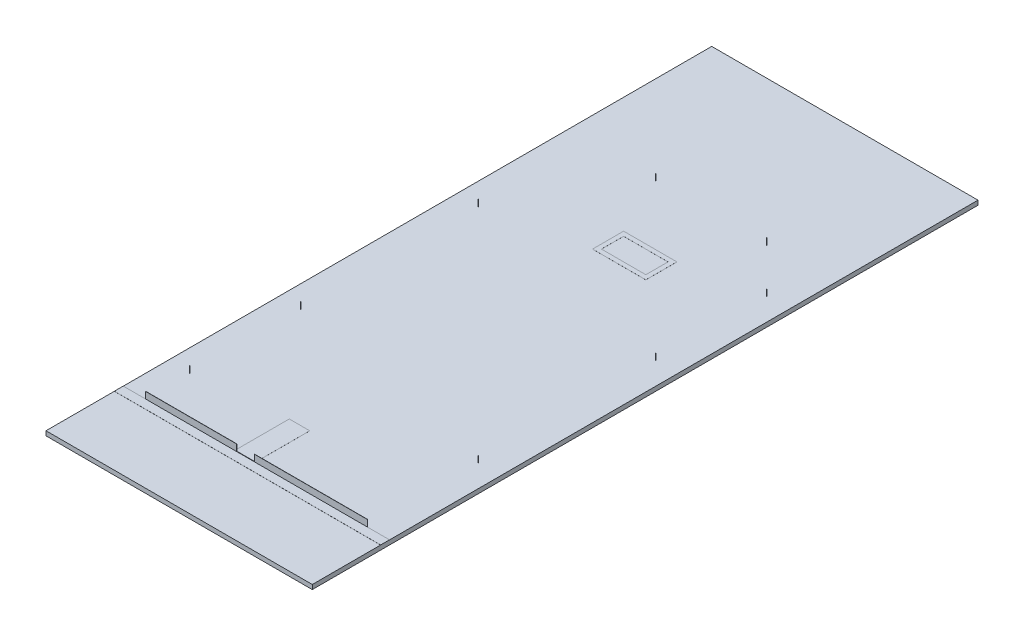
ISO-10303-21;
HEADER;
FILE_DESCRIPTION(('STEP AP214'),'2;1');
FILE_NAME('part.step','',(''),(''),'','','');
FILE_SCHEMA(('AUTOMOTIVE_DESIGN { 1 0 10303 214 1 1 1 1 }'));
ENDSEC;
DATA;
#1=APPLICATION_CONTEXT('core data for automotive mechanical design processes');
#2=APPLICATION_PROTOCOL_DEFINITION('international standard','automotive_design',2000,#1);
#3=PRODUCT_CONTEXT('',#1,'mechanical');
#4=PRODUCT('Part','Part','',(#3));
#5=PRODUCT_RELATED_PRODUCT_CATEGORY('part','',(#4));
#6=PRODUCT_DEFINITION_FORMATION('','',#4);
#7=PRODUCT_DEFINITION_CONTEXT('part definition',#1,'design');
#8=PRODUCT_DEFINITION('design','',#6,#7);
#9=PRODUCT_DEFINITION_SHAPE('','',#8);
#10=(LENGTH_UNIT() NAMED_UNIT(*) SI_UNIT(.MILLI.,.METRE.));
#11=(NAMED_UNIT(*) PLANE_ANGLE_UNIT() SI_UNIT($,.RADIAN.));
#12=(NAMED_UNIT(*) SI_UNIT($,.STERADIAN.) SOLID_ANGLE_UNIT());
#13=UNCERTAINTY_MEASURE_WITH_UNIT(LENGTH_MEASURE(1.E-05),#10,'distance_accuracy_value','');
#14=(GEOMETRIC_REPRESENTATION_CONTEXT(3) GLOBAL_UNCERTAINTY_ASSIGNED_CONTEXT((#13)) GLOBAL_UNIT_ASSIGNED_CONTEXT((#10,
#11,#12)) REPRESENTATION_CONTEXT('',''));
#15=CARTESIAN_POINT('',(0.,0.,0.));
#16=DIRECTION('',(0.,0.,1.));
#17=DIRECTION('',(1.,0.,0.));
#18=AXIS2_PLACEMENT_3D('',#15,#16,#17);
#19=CARTESIAN_POINT('',(0.,1000.,0.));
#20=DIRECTION('',(0.,-1.,0.));
#21=DIRECTION('',(0.,0.,-1.));
#22=AXIS2_PLACEMENT_3D('',#19,#20,#21);
#23=PLANE('',#22);
#24=DIRECTION('',(0.,0.,1.));
#25=VECTOR('',#24,1.);
#26=CARTESIAN_POINT('',(-3862.82134175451,1000.,-104014.42569595));
#27=LINE('',#26,#25);
#28=CARTESIAN_POINT('',(-3862.82134175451,1000.,-104014.42569595));
#29=VERTEX_POINT('',#28);
#30=CARTESIAN_POINT('',(-3862.82134175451,1000.,-97014.4256959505));
#31=VERTEX_POINT('',#30);
#32=EDGE_CURVE('E306',#29,#31,#27,.T.);
#33=ORIENTED_EDGE('',*,*,#32,.F.);
#34=DIRECTION('',(-1.,0.,0.));
#35=VECTOR('',#34,1.);
#36=CARTESIAN_POINT('',(-3862.82134175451,1000.,-104014.42569595));
#37=LINE('',#36,#35);
#38=CARTESIAN_POINT('',(8137.17865824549,1000.,-104014.42569595));
#39=VERTEX_POINT('',#38);
#40=EDGE_CURVE('E317',#39,#29,#37,.T.);
#41=ORIENTED_EDGE('',*,*,#40,.F.);
#42=DIRECTION('',(0.,0.,-1.));
#43=VECTOR('',#42,1.);
#44=CARTESIAN_POINT('',(8137.17865824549,1000.,-104014.42569595));
#45=LINE('',#44,#43);
#46=CARTESIAN_POINT('',(8137.17865824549,1000.,-97014.4256959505));
#47=VERTEX_POINT('',#46);
#48=EDGE_CURVE('E329',#47,#39,#45,.T.);
#49=ORIENTED_EDGE('',*,*,#48,.F.);
#50=DIRECTION('',(1.,0.,0.));
#51=VECTOR('',#50,1.);
#52=CARTESIAN_POINT('',(-3862.82134175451,1000.,-97014.4256959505));
#53=LINE('',#52,#51);
#54=EDGE_CURVE('E326',#31,#47,#53,.T.);
#55=ORIENTED_EDGE('',*,*,#54,.F.);
#56=EDGE_LOOP('',(#33,#41,#49,#55));
#57=FACE_BOUND('',#56,.T.);
#58=CARTESIAN_POINT('',(15000.,1000.,-117394.454500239));
#59=DIRECTION('',(0.,-1.,0.));
#60=DIRECTION('',(0.,0.,-1.));
#61=AXIS2_PLACEMENT_3D('',#58,#59,#60);
#62=CIRCLE('',#61,4.9999999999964);
#63=CARTESIAN_POINT('',(15000.,1000.,-117399.454500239));
#64=VERTEX_POINT('',#63);
#65=EDGE_CURVE('E757',#64,#64,#62,.F.);
#66=ORIENTED_EDGE('',*,*,#65,.F.);
#67=EDGE_LOOP('',(#66));
#68=FACE_BOUND('',#67,.T.);
#69=CARTESIAN_POINT('',(5000.,1000.,-117394.454500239));
#70=DIRECTION('',(0.,-1.,0.));
#71=DIRECTION('',(0.,0.,-1.));
#72=AXIS2_PLACEMENT_3D('',#69,#70,#71);
#73=CIRCLE('',#72,4.9999999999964);
#74=CARTESIAN_POINT('',(5000.,1000.,-117399.454500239));
#75=VERTEX_POINT('',#74);
#76=EDGE_CURVE('E751',#75,#75,#73,.F.);
#77=ORIENTED_EDGE('',*,*,#76,.F.);
#78=EDGE_LOOP('',(#77));
#79=FACE_BOUND('',#78,.T.);
#80=CARTESIAN_POINT('',(-5000.,1000.,-117394.454500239));
#81=DIRECTION('',(0.,-1.,0.));
#82=DIRECTION('',(0.,0.,-1.));
#83=AXIS2_PLACEMENT_3D('',#80,#81,#82);
#84=CIRCLE('',#83,4.9999999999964);
#85=CARTESIAN_POINT('',(-5000.,1000.,-117399.454500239));
#86=VERTEX_POINT('',#85);
#87=EDGE_CURVE('E745',#86,#86,#84,.F.);
#88=ORIENTED_EDGE('',*,*,#87,.F.);
#89=EDGE_LOOP('',(#88));
#90=FACE_BOUND('',#89,.T.);
#91=CARTESIAN_POINT('',(-15000.,1000.,-117394.454500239));
#92=DIRECTION('',(0.,-1.,0.));
#93=DIRECTION('',(0.,0.,-1.));
#94=AXIS2_PLACEMENT_3D('',#91,#92,#93);
#95=CIRCLE('',#94,4.9999999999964);
#96=CARTESIAN_POINT('',(-15000.,1000.,-117399.454500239));
#97=VERTEX_POINT('',#96);
#98=EDGE_CURVE('E739',#97,#97,#95,.F.);
#99=ORIENTED_EDGE('',*,*,#98,.F.);
#100=EDGE_LOOP('',(#99));
#101=FACE_BOUND('',#100,.T.);
#102=CARTESIAN_POINT('',(-25000.,1000.,-117394.454500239));
#103=DIRECTION('',(0.,-1.,0.));
#104=DIRECTION('',(0.,0.,-1.));
#105=AXIS2_PLACEMENT_3D('',#102,#103,#104);
#106=CIRCLE('',#105,4.9999999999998);
#107=CARTESIAN_POINT('',(-25000.,1000.,-117399.454500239));
#108=VERTEX_POINT('',#107);
#109=EDGE_CURVE('E733',#108,#108,#106,.F.);
#110=ORIENTED_EDGE('',*,*,#109,.F.);
#111=EDGE_LOOP('',(#110));
#112=FACE_BOUND('',#111,.T.);
#113=CARTESIAN_POINT('',(-25000.,1000.,-112394.454500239));
#114=DIRECTION('',(0.,-1.,0.));
#115=DIRECTION('',(0.,0.,-1.));
#116=AXIS2_PLACEMENT_3D('',#113,#114,#115);
#117=CIRCLE('',#116,4.9999999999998);
#118=CARTESIAN_POINT('',(-25000.,1000.,-112399.454500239));
#119=VERTEX_POINT('',#118);
#120=EDGE_CURVE('E727',#119,#119,#117,.F.);
#121=ORIENTED_EDGE('',*,*,#120,.F.);
#122=EDGE_LOOP('',(#121));
#123=FACE_BOUND('',#122,.T.);
#124=CARTESIAN_POINT('',(-25000.,1000.,-107394.454500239));
#125=DIRECTION('',(0.,-1.,0.));
#126=DIRECTION('',(0.,0.,-1.));
#127=AXIS2_PLACEMENT_3D('',#124,#125,#126);
#128=CIRCLE('',#127,4.9999999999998);
#129=CARTESIAN_POINT('',(-25000.,1000.,-107399.454500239));
#130=VERTEX_POINT('',#129);
#131=EDGE_CURVE('E721',#130,#130,#128,.F.);
#132=ORIENTED_EDGE('',*,*,#131,.F.);
#133=EDGE_LOOP('',(#132));
#134=FACE_BOUND('',#133,.T.);
#135=CARTESIAN_POINT('',(-25000.,1000.,-102394.454500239));
#136=DIRECTION('',(0.,-1.,0.));
#137=DIRECTION('',(0.,0.,-1.));
#138=AXIS2_PLACEMENT_3D('',#135,#136,#137);
#139=CIRCLE('',#138,4.9999999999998);
#140=CARTESIAN_POINT('',(-25000.,1000.,-102399.454500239));
#141=VERTEX_POINT('',#140);
#142=EDGE_CURVE('E715',#141,#141,#139,.F.);
#143=ORIENTED_EDGE('',*,*,#142,.F.);
#144=EDGE_LOOP('',(#143));
#145=FACE_BOUND('',#144,.T.);
#146=CARTESIAN_POINT('',(-25000.,1000.,-97394.4545002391));
#147=DIRECTION('',(0.,-1.,0.));
#148=DIRECTION('',(0.,0.,-1.));
#149=AXIS2_PLACEMENT_3D('',#146,#147,#148);
#150=CIRCLE('',#149,4.9999999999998);
#151=CARTESIAN_POINT('',(-25000.,1000.,-97399.4545002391));
#152=VERTEX_POINT('',#151);
#153=EDGE_CURVE('E709',#152,#152,#150,.F.);
#154=ORIENTED_EDGE('',*,*,#153,.F.);
#155=EDGE_LOOP('',(#154));
#156=FACE_BOUND('',#155,.T.);
#157=CARTESIAN_POINT('',(-25000.,1000.,-92394.4545002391));
#158=DIRECTION('',(0.,-1.,0.));
#159=DIRECTION('',(0.,0.,-1.));
#160=AXIS2_PLACEMENT_3D('',#157,#158,#159);
#161=CIRCLE('',#160,4.9999999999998);
#162=CARTESIAN_POINT('',(-25000.,1000.,-92399.4545002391));
#163=VERTEX_POINT('',#162);
#164=EDGE_CURVE('E703',#163,#163,#161,.F.);
#165=ORIENTED_EDGE('',*,*,#164,.F.);
#166=EDGE_LOOP('',(#165));
#167=FACE_BOUND('',#166,.T.);
#168=CARTESIAN_POINT('',(-25000.,1000.,-87394.4545002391));
#169=DIRECTION('',(0.,-1.,0.));
#170=DIRECTION('',(0.,0.,-1.));
#171=AXIS2_PLACEMENT_3D('',#168,#169,#170);
#172=CIRCLE('',#171,4.9999999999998);
#173=CARTESIAN_POINT('',(-25000.,1000.,-87399.4545002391));
#174=VERTEX_POINT('',#173);
#175=EDGE_CURVE('E697',#174,#174,#172,.F.);
#176=ORIENTED_EDGE('',*,*,#175,.F.);
#177=EDGE_LOOP('',(#176));
#178=FACE_BOUND('',#177,.T.);
#179=CARTESIAN_POINT('',(-25000.,1000.,-82394.4545002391));
#180=DIRECTION('',(0.,-1.,0.));
#181=DIRECTION('',(0.,0.,-1.));
#182=AXIS2_PLACEMENT_3D('',#179,#180,#181);
#183=CIRCLE('',#182,4.9999999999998);
#184=CARTESIAN_POINT('',(-25000.,1000.,-82399.4545002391));
#185=VERTEX_POINT('',#184);
#186=EDGE_CURVE('E691',#185,#185,#183,.F.);
#187=ORIENTED_EDGE('',*,*,#186,.F.);
#188=EDGE_LOOP('',(#187));
#189=FACE_BOUND('',#188,.T.);
#190=CARTESIAN_POINT('',(-25000.,1000.,-77394.4545002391));
#191=DIRECTION('',(0.,-1.,0.));
#192=DIRECTION('',(0.,0.,-1.));
#193=AXIS2_PLACEMENT_3D('',#190,#191,#192);
#194=CIRCLE('',#193,4.9999999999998);
#195=CARTESIAN_POINT('',(-25000.,1000.,-77399.4545002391));
#196=VERTEX_POINT('',#195);
#197=EDGE_CURVE('E685',#196,#196,#194,.F.);
#198=ORIENTED_EDGE('',*,*,#197,.F.);
#199=EDGE_LOOP('',(#198));
#200=FACE_BOUND('',#199,.T.);
#201=CARTESIAN_POINT('',(-25000.,1000.,-72394.4545002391));
#202=DIRECTION('',(0.,-1.,0.));
#203=DIRECTION('',(0.,0.,-1.));
#204=AXIS2_PLACEMENT_3D('',#201,#202,#203);
#205=CIRCLE('',#204,4.9999999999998);
#206=CARTESIAN_POINT('',(-25000.,1000.,-72399.4545002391));
#207=VERTEX_POINT('',#206);
#208=EDGE_CURVE('E679',#207,#207,#205,.F.);
#209=ORIENTED_EDGE('',*,*,#208,.F.);
#210=EDGE_LOOP('',(#209));
#211=FACE_BOUND('',#210,.T.);
#212=CARTESIAN_POINT('',(-25000.,1000.,-67394.4545002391));
#213=DIRECTION('',(0.,-1.,0.));
#214=DIRECTION('',(0.,0.,-1.));
#215=AXIS2_PLACEMENT_3D('',#212,#213,#214);
#216=CIRCLE('',#215,4.9999999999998);
#217=CARTESIAN_POINT('',(-25000.,1000.,-67399.4545002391));
#218=VERTEX_POINT('',#217);
#219=EDGE_CURVE('E673',#218,#218,#216,.F.);
#220=ORIENTED_EDGE('',*,*,#219,.F.);
#221=EDGE_LOOP('',(#220));
#222=FACE_BOUND('',#221,.T.);
#223=CARTESIAN_POINT('',(-25000.,1000.,-62394.4545002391));
#224=DIRECTION('',(0.,-1.,0.));
#225=DIRECTION('',(0.,0.,-1.));
#226=AXIS2_PLACEMENT_3D('',#223,#224,#225);
#227=CIRCLE('',#226,4.9999999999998);
#228=CARTESIAN_POINT('',(-25000.,1000.,-62399.4545002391));
#229=VERTEX_POINT('',#228);
#230=EDGE_CURVE('E667',#229,#229,#227,.F.);
#231=ORIENTED_EDGE('',*,*,#230,.F.);
#232=EDGE_LOOP('',(#231));
#233=FACE_BOUND('',#232,.T.);
#234=CARTESIAN_POINT('',(-25000.,1000.,-57394.4545002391));
#235=DIRECTION('',(0.,-1.,0.));
#236=DIRECTION('',(0.,0.,-1.));
#237=AXIS2_PLACEMENT_3D('',#234,#235,#236);
#238=CIRCLE('',#237,4.9999999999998);
#239=CARTESIAN_POINT('',(-25000.,1000.,-57399.4545002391));
#240=VERTEX_POINT('',#239);
#241=EDGE_CURVE('E661',#240,#240,#238,.F.);
#242=ORIENTED_EDGE('',*,*,#241,.F.);
#243=EDGE_LOOP('',(#242));
#244=FACE_BOUND('',#243,.T.);
#245=CARTESIAN_POINT('',(-25000.,1000.,-52394.4545002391));
#246=DIRECTION('',(0.,-1.,0.));
#247=DIRECTION('',(0.,0.,-1.));
#248=AXIS2_PLACEMENT_3D('',#245,#246,#247);
#249=CIRCLE('',#248,4.9999999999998);
#250=CARTESIAN_POINT('',(-25000.,1000.,-52399.4545002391));
#251=VERTEX_POINT('',#250);
#252=EDGE_CURVE('E655',#251,#251,#249,.F.);
#253=ORIENTED_EDGE('',*,*,#252,.F.);
#254=EDGE_LOOP('',(#253));
#255=FACE_BOUND('',#254,.T.);
#256=CARTESIAN_POINT('',(-25000.,1000.,-47394.4545002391));
#257=DIRECTION('',(0.,-1.,0.));
#258=DIRECTION('',(0.,0.,-1.));
#259=AXIS2_PLACEMENT_3D('',#256,#257,#258);
#260=CIRCLE('',#259,4.9999999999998);
#261=CARTESIAN_POINT('',(-25000.,1000.,-47399.4545002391));
#262=VERTEX_POINT('',#261);
#263=EDGE_CURVE('E649',#262,#262,#260,.F.);
#264=ORIENTED_EDGE('',*,*,#263,.F.);
#265=EDGE_LOOP('',(#264));
#266=FACE_BOUND('',#265,.T.);
#267=CARTESIAN_POINT('',(-25000.,1000.,-42394.4545002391));
#268=DIRECTION('',(0.,-1.,0.));
#269=DIRECTION('',(0.,0.,-1.));
#270=AXIS2_PLACEMENT_3D('',#267,#268,#269);
#271=CIRCLE('',#270,4.9999999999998);
#272=CARTESIAN_POINT('',(-25000.,1000.,-42399.4545002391));
#273=VERTEX_POINT('',#272);
#274=EDGE_CURVE('E643',#273,#273,#271,.F.);
#275=ORIENTED_EDGE('',*,*,#274,.F.);
#276=EDGE_LOOP('',(#275));
#277=FACE_BOUND('',#276,.T.);
#278=CARTESIAN_POINT('',(-25000.,1000.,-37394.4545002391));
#279=DIRECTION('',(0.,-1.,0.));
#280=DIRECTION('',(0.,0.,-1.));
#281=AXIS2_PLACEMENT_3D('',#278,#279,#280);
#282=CIRCLE('',#281,4.9999999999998);
#283=CARTESIAN_POINT('',(-25000.,1000.,-37399.4545002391));
#284=VERTEX_POINT('',#283);
#285=EDGE_CURVE('E637',#284,#284,#282,.F.);
#286=ORIENTED_EDGE('',*,*,#285,.F.);
#287=EDGE_LOOP('',(#286));
#288=FACE_BOUND('',#287,.T.);
#289=CARTESIAN_POINT('',(-25000.,1000.,-32394.4545002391));
#290=DIRECTION('',(0.,-1.,0.));
#291=DIRECTION('',(0.,0.,-1.));
#292=AXIS2_PLACEMENT_3D('',#289,#290,#291);
#293=CIRCLE('',#292,4.9999999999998);
#294=CARTESIAN_POINT('',(-25000.,1000.,-32399.4545002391));
#295=VERTEX_POINT('',#294);
#296=EDGE_CURVE('E631',#295,#295,#293,.F.);
#297=ORIENTED_EDGE('',*,*,#296,.F.);
#298=EDGE_LOOP('',(#297));
#299=FACE_BOUND('',#298,.T.);
#300=CARTESIAN_POINT('',(-25000.,1000.,-27394.4545002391));
#301=DIRECTION('',(0.,-1.,0.));
#302=DIRECTION('',(0.,0.,-1.));
#303=AXIS2_PLACEMENT_3D('',#300,#301,#302);
#304=CIRCLE('',#303,4.9999999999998);
#305=CARTESIAN_POINT('',(-25000.,1000.,-27399.4545002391));
#306=VERTEX_POINT('',#305);
#307=EDGE_CURVE('E625',#306,#306,#304,.F.);
#308=ORIENTED_EDGE('',*,*,#307,.F.);
#309=EDGE_LOOP('',(#308));
#310=FACE_BOUND('',#309,.T.);
#311=CARTESIAN_POINT('',(-25000.,1000.,-22394.4545002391));
#312=DIRECTION('',(0.,-1.,0.));
#313=DIRECTION('',(0.,0.,-1.));
#314=AXIS2_PLACEMENT_3D('',#311,#312,#313);
#315=CIRCLE('',#314,4.9999999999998);
#316=CARTESIAN_POINT('',(-25000.,1000.,-22399.4545002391));
#317=VERTEX_POINT('',#316);
#318=EDGE_CURVE('E618',#317,#317,#315,.F.);
#319=ORIENTED_EDGE('',*,*,#318,.F.);
#320=EDGE_LOOP('',(#319));
#321=FACE_BOUND('',#320,.T.);
#322=CARTESIAN_POINT('',(25000.,1000.,-22394.4545002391));
#323=DIRECTION('',(0.,-1.,0.));
#324=DIRECTION('',(0.,0.,-1.));
#325=AXIS2_PLACEMENT_3D('',#322,#323,#324);
#326=CIRCLE('',#325,4.9999999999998);
#327=CARTESIAN_POINT('',(25000.,1000.,-22399.4545002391));
#328=VERTEX_POINT('',#327);
#329=EDGE_CURVE('E615',#328,#328,#326,.F.);
#330=ORIENTED_EDGE('',*,*,#329,.F.);
#331=EDGE_LOOP('',(#330));
#332=FACE_BOUND('',#331,.T.);
#333=CARTESIAN_POINT('',(25000.,1000.,-27394.4545002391));
#334=DIRECTION('',(0.,-1.,0.));
#335=DIRECTION('',(0.,0.,-1.));
#336=AXIS2_PLACEMENT_3D('',#333,#334,#335);
#337=CIRCLE('',#336,4.9999999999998);
#338=CARTESIAN_POINT('',(25000.,1000.,-27399.4545002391));
#339=VERTEX_POINT('',#338);
#340=EDGE_CURVE('E622',#339,#339,#337,.F.);
#341=ORIENTED_EDGE('',*,*,#340,.F.);
#342=EDGE_LOOP('',(#341));
#343=FACE_BOUND('',#342,.T.);
#344=CARTESIAN_POINT('',(25000.,1000.,-32394.4545002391));
#345=DIRECTION('',(0.,-1.,0.));
#346=DIRECTION('',(0.,0.,-1.));
#347=AXIS2_PLACEMENT_3D('',#344,#345,#346);
#348=CIRCLE('',#347,4.9999999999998);
#349=CARTESIAN_POINT('',(25000.,1000.,-32399.4545002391));
#350=VERTEX_POINT('',#349);
#351=EDGE_CURVE('E628',#350,#350,#348,.F.);
#352=ORIENTED_EDGE('',*,*,#351,.F.);
#353=EDGE_LOOP('',(#352));
#354=FACE_BOUND('',#353,.T.);
#355=CARTESIAN_POINT('',(25000.,1000.,-37394.4545002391));
#356=DIRECTION('',(0.,-1.,0.));
#357=DIRECTION('',(0.,0.,-1.));
#358=AXIS2_PLACEMENT_3D('',#355,#356,#357);
#359=CIRCLE('',#358,4.9999999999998);
#360=CARTESIAN_POINT('',(25000.,1000.,-37399.4545002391));
#361=VERTEX_POINT('',#360);
#362=EDGE_CURVE('E634',#361,#361,#359,.F.);
#363=ORIENTED_EDGE('',*,*,#362,.F.);
#364=EDGE_LOOP('',(#363));
#365=FACE_BOUND('',#364,.T.);
#366=CARTESIAN_POINT('',(25000.,1000.,-42394.4545002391));
#367=DIRECTION('',(0.,-1.,0.));
#368=DIRECTION('',(0.,0.,-1.));
#369=AXIS2_PLACEMENT_3D('',#366,#367,#368);
#370=CIRCLE('',#369,4.9999999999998);
#371=CARTESIAN_POINT('',(25000.,1000.,-42399.4545002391));
#372=VERTEX_POINT('',#371);
#373=EDGE_CURVE('E640',#372,#372,#370,.F.);
#374=ORIENTED_EDGE('',*,*,#373,.F.);
#375=EDGE_LOOP('',(#374));
#376=FACE_BOUND('',#375,.T.);
#377=CARTESIAN_POINT('',(25000.,1000.,-47394.4545002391));
#378=DIRECTION('',(0.,-1.,0.));
#379=DIRECTION('',(0.,0.,-1.));
#380=AXIS2_PLACEMENT_3D('',#377,#378,#379);
#381=CIRCLE('',#380,4.9999999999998);
#382=CARTESIAN_POINT('',(25000.,1000.,-47399.4545002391));
#383=VERTEX_POINT('',#382);
#384=EDGE_CURVE('E646',#383,#383,#381,.F.);
#385=ORIENTED_EDGE('',*,*,#384,.F.);
#386=EDGE_LOOP('',(#385));
#387=FACE_BOUND('',#386,.T.);
#388=CARTESIAN_POINT('',(25000.,1000.,-52394.4545002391));
#389=DIRECTION('',(0.,-1.,0.));
#390=DIRECTION('',(0.,0.,-1.));
#391=AXIS2_PLACEMENT_3D('',#388,#389,#390);
#392=CIRCLE('',#391,4.9999999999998);
#393=CARTESIAN_POINT('',(25000.,1000.,-52399.4545002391));
#394=VERTEX_POINT('',#393);
#395=EDGE_CURVE('E652',#394,#394,#392,.F.);
#396=ORIENTED_EDGE('',*,*,#395,.F.);
#397=EDGE_LOOP('',(#396));
#398=FACE_BOUND('',#397,.T.);
#399=CARTESIAN_POINT('',(25000.,1000.,-57394.4545002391));
#400=DIRECTION('',(0.,-1.,0.));
#401=DIRECTION('',(0.,0.,-1.));
#402=AXIS2_PLACEMENT_3D('',#399,#400,#401);
#403=CIRCLE('',#402,4.9999999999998);
#404=CARTESIAN_POINT('',(25000.,1000.,-57399.4545002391));
#405=VERTEX_POINT('',#404);
#406=EDGE_CURVE('E658',#405,#405,#403,.F.);
#407=ORIENTED_EDGE('',*,*,#406,.F.);
#408=EDGE_LOOP('',(#407));
#409=FACE_BOUND('',#408,.T.);
#410=CARTESIAN_POINT('',(25000.,1000.,-62394.4545002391));
#411=DIRECTION('',(0.,-1.,0.));
#412=DIRECTION('',(0.,0.,-1.));
#413=AXIS2_PLACEMENT_3D('',#410,#411,#412);
#414=CIRCLE('',#413,4.9999999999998);
#415=CARTESIAN_POINT('',(25000.,1000.,-62399.4545002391));
#416=VERTEX_POINT('',#415);
#417=EDGE_CURVE('E664',#416,#416,#414,.F.);
#418=ORIENTED_EDGE('',*,*,#417,.F.);
#419=EDGE_LOOP('',(#418));
#420=FACE_BOUND('',#419,.T.);
#421=CARTESIAN_POINT('',(25000.,1000.,-67394.4545002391));
#422=DIRECTION('',(0.,-1.,0.));
#423=DIRECTION('',(0.,0.,-1.));
#424=AXIS2_PLACEMENT_3D('',#421,#422,#423);
#425=CIRCLE('',#424,4.9999999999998);
#426=CARTESIAN_POINT('',(25000.,1000.,-67399.4545002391));
#427=VERTEX_POINT('',#426);
#428=EDGE_CURVE('E670',#427,#427,#425,.F.);
#429=ORIENTED_EDGE('',*,*,#428,.F.);
#430=EDGE_LOOP('',(#429));
#431=FACE_BOUND('',#430,.T.);
#432=CARTESIAN_POINT('',(25000.,1000.,-72394.4545002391));
#433=DIRECTION('',(0.,-1.,0.));
#434=DIRECTION('',(0.,0.,-1.));
#435=AXIS2_PLACEMENT_3D('',#432,#433,#434);
#436=CIRCLE('',#435,4.9999999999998);
#437=CARTESIAN_POINT('',(25000.,1000.,-72399.4545002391));
#438=VERTEX_POINT('',#437);
#439=EDGE_CURVE('E676',#438,#438,#436,.F.);
#440=ORIENTED_EDGE('',*,*,#439,.F.);
#441=EDGE_LOOP('',(#440));
#442=FACE_BOUND('',#441,.T.);
#443=CARTESIAN_POINT('',(25000.,1000.,-77394.4545002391));
#444=DIRECTION('',(0.,-1.,0.));
#445=DIRECTION('',(0.,0.,-1.));
#446=AXIS2_PLACEMENT_3D('',#443,#444,#445);
#447=CIRCLE('',#446,4.9999999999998);
#448=CARTESIAN_POINT('',(25000.,1000.,-77399.4545002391));
#449=VERTEX_POINT('',#448);
#450=EDGE_CURVE('E682',#449,#449,#447,.F.);
#451=ORIENTED_EDGE('',*,*,#450,.F.);
#452=EDGE_LOOP('',(#451));
#453=FACE_BOUND('',#452,.T.);
#454=CARTESIAN_POINT('',(25000.,1000.,-82394.4545002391));
#455=DIRECTION('',(0.,-1.,0.));
#456=DIRECTION('',(0.,0.,-1.));
#457=AXIS2_PLACEMENT_3D('',#454,#455,#456);
#458=CIRCLE('',#457,4.9999999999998);
#459=CARTESIAN_POINT('',(25000.,1000.,-82399.4545002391));
#460=VERTEX_POINT('',#459);
#461=EDGE_CURVE('E688',#460,#460,#458,.F.);
#462=ORIENTED_EDGE('',*,*,#461,.F.);
#463=EDGE_LOOP('',(#462));
#464=FACE_BOUND('',#463,.T.);
#465=CARTESIAN_POINT('',(25000.,1000.,-87394.4545002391));
#466=DIRECTION('',(0.,-1.,0.));
#467=DIRECTION('',(0.,0.,-1.));
#468=AXIS2_PLACEMENT_3D('',#465,#466,#467);
#469=CIRCLE('',#468,4.9999999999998);
#470=CARTESIAN_POINT('',(25000.,1000.,-87399.4545002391));
#471=VERTEX_POINT('',#470);
#472=EDGE_CURVE('E694',#471,#471,#469,.F.);
#473=ORIENTED_EDGE('',*,*,#472,.F.);
#474=EDGE_LOOP('',(#473));
#475=FACE_BOUND('',#474,.T.);
#476=CARTESIAN_POINT('',(25000.,1000.,-92394.4545002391));
#477=DIRECTION('',(0.,-1.,0.));
#478=DIRECTION('',(0.,0.,-1.));
#479=AXIS2_PLACEMENT_3D('',#476,#477,#478);
#480=CIRCLE('',#479,4.9999999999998);
#481=CARTESIAN_POINT('',(25000.,1000.,-92399.4545002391));
#482=VERTEX_POINT('',#481);
#483=EDGE_CURVE('E700',#482,#482,#480,.F.);
#484=ORIENTED_EDGE('',*,*,#483,.F.);
#485=EDGE_LOOP('',(#484));
#486=FACE_BOUND('',#485,.T.);
#487=CARTESIAN_POINT('',(25000.,1000.,-97394.4545002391));
#488=DIRECTION('',(0.,-1.,0.));
#489=DIRECTION('',(0.,0.,-1.));
#490=AXIS2_PLACEMENT_3D('',#487,#488,#489);
#491=CIRCLE('',#490,4.9999999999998);
#492=CARTESIAN_POINT('',(25000.,1000.,-97399.4545002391));
#493=VERTEX_POINT('',#492);
#494=EDGE_CURVE('E706',#493,#493,#491,.F.);
#495=ORIENTED_EDGE('',*,*,#494,.F.);
#496=EDGE_LOOP('',(#495));
#497=FACE_BOUND('',#496,.T.);
#498=CARTESIAN_POINT('',(25000.,1000.,-102394.454500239));
#499=DIRECTION('',(0.,-1.,0.));
#500=DIRECTION('',(0.,0.,-1.));
#501=AXIS2_PLACEMENT_3D('',#498,#499,#500);
#502=CIRCLE('',#501,4.9999999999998);
#503=CARTESIAN_POINT('',(25000.,1000.,-102399.454500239));
#504=VERTEX_POINT('',#503);
#505=EDGE_CURVE('E712',#504,#504,#502,.F.);
#506=ORIENTED_EDGE('',*,*,#505,.F.);
#507=EDGE_LOOP('',(#506));
#508=FACE_BOUND('',#507,.T.);
#509=CARTESIAN_POINT('',(25000.,1000.,-107394.454500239));
#510=DIRECTION('',(0.,-1.,0.));
#511=DIRECTION('',(0.,0.,-1.));
#512=AXIS2_PLACEMENT_3D('',#509,#510,#511);
#513=CIRCLE('',#512,4.9999999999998);
#514=CARTESIAN_POINT('',(25000.,1000.,-107399.454500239));
#515=VERTEX_POINT('',#514);
#516=EDGE_CURVE('E718',#515,#515,#513,.F.);
#517=ORIENTED_EDGE('',*,*,#516,.F.);
#518=EDGE_LOOP('',(#517));
#519=FACE_BOUND('',#518,.T.);
#520=CARTESIAN_POINT('',(25000.,1000.,-112394.454500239));
#521=DIRECTION('',(0.,-1.,0.));
#522=DIRECTION('',(0.,0.,-1.));
#523=AXIS2_PLACEMENT_3D('',#520,#521,#522);
#524=CIRCLE('',#523,4.9999999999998);
#525=CARTESIAN_POINT('',(25000.,1000.,-112399.454500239));
#526=VERTEX_POINT('',#525);
#527=EDGE_CURVE('E724',#526,#526,#524,.F.);
#528=ORIENTED_EDGE('',*,*,#527,.F.);
#529=EDGE_LOOP('',(#528));
#530=FACE_BOUND('',#529,.T.);
#531=CARTESIAN_POINT('',(25000.,1000.,-117394.454500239));
#532=DIRECTION('',(0.,-1.,0.));
#533=DIRECTION('',(0.,0.,-1.));
#534=AXIS2_PLACEMENT_3D('',#531,#532,#533);
#535=CIRCLE('',#534,4.9999999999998);
#536=CARTESIAN_POINT('',(25000.,1000.,-117399.454500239));
#537=VERTEX_POINT('',#536);
#538=EDGE_CURVE('E730',#537,#537,#535,.F.);
#539=ORIENTED_EDGE('',*,*,#538,.F.);
#540=EDGE_LOOP('',(#539));
#541=FACE_BOUND('',#540,.T.);
#542=CARTESIAN_POINT('',(-20000.,1000.,-117394.454500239));
#543=DIRECTION('',(0.,-1.,0.));
#544=DIRECTION('',(0.,0.,-1.));
#545=AXIS2_PLACEMENT_3D('',#542,#543,#544);
#546=CIRCLE('',#545,4.9999999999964);
#547=CARTESIAN_POINT('',(-20000.,1000.,-117399.454500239));
#548=VERTEX_POINT('',#547);
#549=EDGE_CURVE('E736',#548,#548,#546,.F.);
#550=ORIENTED_EDGE('',*,*,#549,.F.);
#551=EDGE_LOOP('',(#550));
#552=FACE_BOUND('',#551,.T.);
#553=CARTESIAN_POINT('',(-10000.,1000.,-117394.454500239));
#554=DIRECTION('',(0.,-1.,0.));
#555=DIRECTION('',(0.,0.,-1.));
#556=AXIS2_PLACEMENT_3D('',#553,#554,#555);
#557=CIRCLE('',#556,4.9999999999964);
#558=CARTESIAN_POINT('',(-10000.,1000.,-117399.454500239));
#559=VERTEX_POINT('',#558);
#560=EDGE_CURVE('E742',#559,#559,#557,.F.);
#561=ORIENTED_EDGE('',*,*,#560,.F.);
#562=EDGE_LOOP('',(#561));
#563=FACE_BOUND('',#562,.T.);
#564=CARTESIAN_POINT('',(0.,1000.,-117394.454500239));
#565=DIRECTION('',(0.,-1.,0.));
#566=DIRECTION('',(0.,0.,-1.));
#567=AXIS2_PLACEMENT_3D('',#564,#565,#566);
#568=CIRCLE('',#567,4.9999999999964);
#569=CARTESIAN_POINT('',(0.,1000.,-117399.454500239));
#570=VERTEX_POINT('',#569);
#571=EDGE_CURVE('E748',#570,#570,#568,.F.);
#572=ORIENTED_EDGE('',*,*,#571,.F.);
#573=EDGE_LOOP('',(#572));
#574=FACE_BOUND('',#573,.T.);
#575=CARTESIAN_POINT('',(10000.,1000.,-117394.454500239));
#576=DIRECTION('',(0.,-1.,0.));
#577=DIRECTION('',(0.,0.,-1.));
#578=AXIS2_PLACEMENT_3D('',#575,#576,#577);
#579=CIRCLE('',#578,4.9999999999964);
#580=CARTESIAN_POINT('',(10000.,1000.,-117399.454500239));
#581=VERTEX_POINT('',#580);
#582=EDGE_CURVE('E754',#581,#581,#579,.F.);
#583=ORIENTED_EDGE('',*,*,#582,.F.);
#584=EDGE_LOOP('',(#583));
#585=FACE_BOUND('',#584,.T.);
#586=CARTESIAN_POINT('',(20000.,1000.,-117394.454500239));
#587=DIRECTION('',(0.,-1.,0.));
#588=DIRECTION('',(0.,0.,-1.));
#589=AXIS2_PLACEMENT_3D('',#586,#587,#588);
#590=CIRCLE('',#589,4.9999999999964);
#591=CARTESIAN_POINT('',(20000.,1000.,-117399.454500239));
#592=VERTEX_POINT('',#591);
#593=EDGE_CURVE('E760',#592,#592,#590,.F.);
#594=ORIENTED_EDGE('',*,*,#593,.F.);
#595=EDGE_LOOP('',(#594));
#596=FACE_BOUND('',#595,.T.);
#597=DIRECTION('',(0.,0.,1.));
#598=VECTOR('',#597,1.);
#599=CARTESIAN_POINT('',(-4881.5812166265,1000.,-17434.4545002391));
#600=LINE('',#599,#598);
#601=CARTESIAN_POINT('',(-4881.5812166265,1000.,-29694.0131065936));
#602=VERTEX_POINT('',#601);
#603=CARTESIAN_POINT('',(-4881.5812166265,1000.,-17434.4545002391));
#604=VERTEX_POINT('',#603);
#605=EDGE_CURVE('E50',#602,#604,#600,.T.);
#606=ORIENTED_EDGE('',*,*,#605,.F.);
#607=DIRECTION('',(-1.,0.,0.));
#608=VECTOR('',#607,1.);
#609=CARTESIAN_POINT('',(-4881.5812166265,1000.,-29694.0131065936));
#610=LINE('',#609,#608);
#611=CARTESIAN_POINT('',(-267.257739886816,1000.,-29694.0131065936));
#612=VERTEX_POINT('',#611);
#613=EDGE_CURVE('E54',#612,#602,#610,.T.);
#614=ORIENTED_EDGE('',*,*,#613,.F.);
#615=DIRECTION('',(0.,0.,-1.));
#616=VECTOR('',#615,1.);
#617=CARTESIAN_POINT('',(-267.257739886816,1000.,-17434.4545002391));
#618=LINE('',#617,#616);
#619=CARTESIAN_POINT('',(-267.257739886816,1000.,-17434.4545002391));
#620=VERTEX_POINT('',#619);
#621=EDGE_CURVE('E273',#620,#612,#618,.T.);
#622=ORIENTED_EDGE('',*,*,#621,.F.);
#623=DIRECTION('',(-1.,0.,0.));
#624=VECTOR('',#623,1.);
#625=CARTESIAN_POINT('',(-25000.,1000.,-17434.4545002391));
#626=LINE('',#625,#624);
#627=CARTESIAN_POINT('',(25000.,1000.,-17434.4545002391));
#628=VERTEX_POINT('',#627);
#629=EDGE_CURVE('E249',#628,#620,#626,.T.);
#630=ORIENTED_EDGE('',*,*,#629,.F.);
#631=DIRECTION('',(0.,0.,-1.));
#632=VECTOR('',#631,1.);
#633=CARTESIAN_POINT('',(25000.,1000.,-17394.4545002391));
#634=LINE('',#633,#632);
#635=CARTESIAN_POINT('',(25000.,1000.,-17399.4545002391));
#636=VERTEX_POINT('',#635);
#637=EDGE_CURVE('E557',#636,#628,#634,.T.);
#638=ORIENTED_EDGE('',*,*,#637,.F.);
#639=CARTESIAN_POINT('',(25000.,1000.,-17394.4545002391));
#640=DIRECTION('',(0.,1.,0.));
#641=DIRECTION('',(0.,0.,1.));
#642=AXIS2_PLACEMENT_3D('',#639,#640,#641);
#643=CIRCLE('',#642,4.9999999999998);
#644=CARTESIAN_POINT('',(25005.,1000.,-17394.4545002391));
#645=VERTEX_POINT('',#644);
#646=EDGE_CURVE('E526',#645,#636,#643,.T.);
#647=ORIENTED_EDGE('',*,*,#646,.F.);
#648=DIRECTION('',(-1.,0.,0.));
#649=VECTOR('',#648,1.);
#650=CARTESIAN_POINT('',(-30000.,1000.,-17394.4545002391));
#651=LINE('',#650,#649);
#652=CARTESIAN_POINT('',(30000.,1000.,-17394.4545002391));
#653=VERTEX_POINT('',#652);
#654=EDGE_CURVE('E570',#653,#645,#651,.T.);
#655=ORIENTED_EDGE('',*,*,#654,.F.);
#656=DIRECTION('',(0.,0.,-1.));
#657=VECTOR('',#656,1.);
#658=CARTESIAN_POINT('',(30000.,1000.,0.));
#659=LINE('',#658,#657);
#660=CARTESIAN_POINT('',(30000.,1000.,-150000.));
#661=VERTEX_POINT('',#660);
#662=EDGE_CURVE('E589',#653,#661,#659,.T.);
#663=ORIENTED_EDGE('',*,*,#662,.T.);
#664=DIRECTION('',(-1.,0.,0.));
#665=VECTOR('',#664,1.);
#666=CARTESIAN_POINT('',(-30000.,1000.,-150000.));
#667=LINE('',#666,#665);
#668=CARTESIAN_POINT('',(-30000.,1000.,-150000.));
#669=VERTEX_POINT('',#668);
#670=EDGE_CURVE('E838',#661,#669,#667,.T.);
#671=ORIENTED_EDGE('',*,*,#670,.T.);
#672=DIRECTION('',(0.,0.,1.));
#673=VECTOR('',#672,1.);
#674=CARTESIAN_POINT('',(-30000.,1000.,0.));
#675=LINE('',#674,#673);
#676=CARTESIAN_POINT('',(-30000.,1000.,-17394.4545002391));
#677=VERTEX_POINT('',#676);
#678=EDGE_CURVE('E839',#669,#677,#675,.T.);
#679=ORIENTED_EDGE('',*,*,#678,.T.);
#680=CARTESIAN_POINT('',(-25005.,1000.,-17394.4545002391));
#681=VERTEX_POINT('',#680);
#682=EDGE_CURVE('E588',#681,#677,#651,.T.);
#683=ORIENTED_EDGE('',*,*,#682,.F.);
#684=CARTESIAN_POINT('',(-25000.,1000.,-17394.4545002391));
#685=DIRECTION('',(0.,1.,0.));
#686=DIRECTION('',(0.,0.,1.));
#687=AXIS2_PLACEMENT_3D('',#684,#685,#686);
#688=CIRCLE('',#687,4.9999999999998);
#689=CARTESIAN_POINT('',(-25000.,1000.,-17399.4545002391));
#690=VERTEX_POINT('',#689);
#691=EDGE_CURVE('E512',#690,#681,#688,.T.);
#692=ORIENTED_EDGE('',*,*,#691,.F.);
#693=DIRECTION('',(0.,0.,1.));
#694=VECTOR('',#693,1.);
#695=CARTESIAN_POINT('',(-25000.,1000.,-17394.4545002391));
#696=LINE('',#695,#694);
#697=CARTESIAN_POINT('',(-25000.,1000.,-17434.4545002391));
#698=VERTEX_POINT('',#697);
#699=EDGE_CURVE('E540',#698,#690,#696,.T.);
#700=ORIENTED_EDGE('',*,*,#699,.F.);
#701=EDGE_CURVE('E559',#604,#698,#626,.T.);
#702=ORIENTED_EDGE('',*,*,#701,.F.);
#703=EDGE_LOOP('',(#606,#614,#622,#630,#638,#647,#655,#663,#671,#679,#683,#692,#700,#702));
#704=FACE_BOUND('',#703,.T.);
#705=ADVANCED_FACE('F35',(#57,#68,#79,#90,#101,#112,#123,#134,#145,#156,#167,#178,#189,#200,
#211,#222,#233,#244,#255,#266,#277,#288,#299,#310,#321,#332,#343,#354,#365,#376,#387,#398,#409,
#420,#431,#442,#453,#464,#475,#486,#497,#508,#519,#530,#541,#552,#563,#574,#585,#596,#704),#23,.F.);
#706=CARTESIAN_POINT('',(-25000.,2500.,-17434.4545002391));
#707=DIRECTION('',(0.,0.,1.));
#708=DIRECTION('',(1.,0.,0.));
#709=AXIS2_PLACEMENT_3D('',#706,#707,#708);
#710=PLANE('',#709);
#711=DIRECTION('',(0.,-1.,0.));
#712=VECTOR('',#711,1.);
#713=CARTESIAN_POINT('',(-4881.5812166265,1010.,-17434.4545002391));
#714=LINE('',#713,#712);
#715=CARTESIAN_POINT('',(-4881.5812166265,1010.,-17434.4545002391));
#716=VERTEX_POINT('',#715);
#717=EDGE_CURVE('E252',#716,#604,#714,.T.);
#718=ORIENTED_EDGE('',*,*,#717,.T.);
#719=ORIENTED_EDGE('',*,*,#701,.T.);
#720=DIRECTION('',(0.,-1.,0.));
#721=VECTOR('',#720,1.);
#722=CARTESIAN_POINT('',(-25000.,2500.,-17434.4545002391));
#723=LINE('',#722,#721);
#724=CARTESIAN_POINT('',(-25000.,2500.,-17434.4545002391));
#725=VERTEX_POINT('',#724);
#726=EDGE_CURVE('E554',#725,#698,#723,.T.);
#727=ORIENTED_EDGE('',*,*,#726,.F.);
#728=DIRECTION('',(-1.,0.,0.));
#729=VECTOR('',#728,1.);
#730=CARTESIAN_POINT('',(-25000.,2500.,-17434.4545002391));
#731=LINE('',#730,#729);
#732=CARTESIAN_POINT('',(-4447.77738641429,2500.,-17434.4545002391));
#733=VERTEX_POINT('',#732);
#734=EDGE_CURVE('E550',#733,#725,#731,.T.);
#735=ORIENTED_EDGE('',*,*,#734,.F.);
#736=DIRECTION('',(0.,-1.,0.));
#737=VECTOR('',#736,1.);
#738=CARTESIAN_POINT('',(-4447.77738641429,2500.,-17434.4545002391));
#739=LINE('',#738,#737);
#740=CARTESIAN_POINT('',(-4447.77738641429,1100.,-17434.4545002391));
#741=VERTEX_POINT('',#740);
#742=EDGE_CURVE('E357',#733,#741,#739,.T.);
#743=ORIENTED_EDGE('',*,*,#742,.T.);
#744=DIRECTION('',(-1.,0.,0.));
#745=VECTOR('',#744,1.);
#746=CARTESIAN_POINT('',(-25000.,1100.,-17434.4545002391));
#747=LINE('',#746,#745);
#748=CARTESIAN_POINT('',(-433.237756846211,1100.,-17434.4545002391));
#749=VERTEX_POINT('',#748);
#750=EDGE_CURVE('E11',#749,#741,#747,.T.);
#751=ORIENTED_EDGE('',*,*,#750,.F.);
#752=DIRECTION('',(0.,1.,0.));
#753=VECTOR('',#752,1.);
#754=CARTESIAN_POINT('',(-433.237756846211,2500.,-17434.4545002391));
#755=LINE('',#754,#753);
#756=CARTESIAN_POINT('',(-433.237756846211,2500.,-17434.4545002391));
#757=VERTEX_POINT('',#756);
#758=EDGE_CURVE('E351',#749,#757,#755,.T.);
#759=ORIENTED_EDGE('',*,*,#758,.T.);
#760=CARTESIAN_POINT('',(25000.,2500.,-17434.4545002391));
#761=VERTEX_POINT('',#760);
#762=EDGE_CURVE('E551',#761,#757,#731,.T.);
#763=ORIENTED_EDGE('',*,*,#762,.F.);
#764=DIRECTION('',(0.,-1.,0.));
#765=VECTOR('',#764,1.);
#766=CARTESIAN_POINT('',(25000.,2500.,-17434.4545002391));
#767=LINE('',#766,#765);
#768=EDGE_CURVE('E563',#761,#628,#767,.T.);
#769=ORIENTED_EDGE('',*,*,#768,.T.);
#770=ORIENTED_EDGE('',*,*,#629,.T.);
#771=DIRECTION('',(0.,-1.,0.));
#772=VECTOR('',#771,1.);
#773=CARTESIAN_POINT('',(-267.257739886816,1010.,-17434.4545002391));
#774=LINE('',#773,#772);
#775=CARTESIAN_POINT('',(-267.257739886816,1010.,-17434.4545002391));
#776=VERTEX_POINT('',#775);
#777=EDGE_CURVE('E242',#776,#620,#774,.T.);
#778=ORIENTED_EDGE('',*,*,#777,.F.);
#779=DIRECTION('',(1.,0.,0.));
#780=VECTOR('',#779,1.);
#781=CARTESIAN_POINT('',(-4881.5812166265,1010.,-17434.4545002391));
#782=LINE('',#781,#780);
#783=EDGE_CURVE('E245',#716,#776,#782,.T.);
#784=ORIENTED_EDGE('',*,*,#783,.F.);
#785=EDGE_LOOP('',(#718,#719,#727,#735,#743,#751,#759,#763,#769,#770,#778,#784));
#786=FACE_BOUND('',#785,.T.);
#787=ADVANCED_FACE('F244',(#786),#710,.F.);
#788=CARTESIAN_POINT('',(0.,2500.,0.));
#789=DIRECTION('',(0.,-1.,0.));
#790=DIRECTION('',(0.,0.,-1.));
#791=AXIS2_PLACEMENT_3D('',#788,#789,#790);
#792=PLANE('',#791);
#793=DIRECTION('',(1.,0.,0.));
#794=VECTOR('',#793,1.);
#795=CARTESIAN_POINT('',(-25000.,2500.,-17394.4545002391));
#796=LINE('',#795,#794);
#797=CARTESIAN_POINT('',(-24995.,2500.,-17394.4545002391));
#798=VERTEX_POINT('',#797);
#799=CARTESIAN_POINT('',(-4447.77738641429,2500.,-17394.4545002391));
#800=VERTEX_POINT('',#799);
#801=EDGE_CURVE('E545',#798,#800,#796,.T.);
#802=ORIENTED_EDGE('',*,*,#801,.T.);
#803=DIRECTION('',(0.,0.,-1.));
#804=VECTOR('',#803,1.);
#805=CARTESIAN_POINT('',(-4447.77738641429,2500.,0.));
#806=LINE('',#805,#804);
#807=EDGE_CURVE('E43',#800,#733,#806,.T.);
#808=ORIENTED_EDGE('',*,*,#807,.T.);
#809=ORIENTED_EDGE('',*,*,#734,.T.);
#810=DIRECTION('',(0.,0.,1.));
#811=VECTOR('',#810,1.);
#812=CARTESIAN_POINT('',(-25000.,2500.,-17394.4545002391));
#813=LINE('',#812,#811);
#814=CARTESIAN_POINT('',(-25000.,2500.,-17399.4545002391));
#815=VERTEX_POINT('',#814);
#816=EDGE_CURVE('E541',#725,#815,#813,.T.);
#817=ORIENTED_EDGE('',*,*,#816,.T.);
#818=CARTESIAN_POINT('',(-25000.,2500.,-17394.4545002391));
#819=DIRECTION('',(0.,1.,0.));
#820=DIRECTION('',(0.,0.,1.));
#821=AXIS2_PLACEMENT_3D('',#818,#819,#820);
#822=CIRCLE('',#821,4.9999999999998);
#823=EDGE_CURVE('E513',#815,#798,#822,.T.);
#824=ORIENTED_EDGE('',*,*,#823,.T.);
#825=EDGE_LOOP('',(#802,#808,#809,#817,#824));
#826=FACE_BOUND('',#825,.T.);
#827=ADVANCED_FACE('F768',(#826),#792,.F.);
#828=CARTESIAN_POINT('',(0.,1020.,0.));
#829=DIRECTION('',(0.,1.,0.));
#830=DIRECTION('',(0.,0.,1.));
#831=AXIS2_PLACEMENT_3D('',#828,#829,#830);
#832=PLANE('',#831);
#833=DIRECTION('',(-1.,0.,0.));
#834=VECTOR('',#833,1.);
#835=CARTESIAN_POINT('',(-30000.,1020.,-17394.4545002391));
#836=LINE('',#835,#834);
#837=CARTESIAN_POINT('',(24995.,1020.,-17394.4545002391));
#838=VERTEX_POINT('',#837);
#839=CARTESIAN_POINT('',(-24995.,1020.,-17394.4545002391));
#840=VERTEX_POINT('',#839);
#841=EDGE_CURVE('E579',#838,#840,#836,.T.);
#842=ORIENTED_EDGE('',*,*,#841,.T.);
#843=CARTESIAN_POINT('',(-25000.,1020.,-17394.4545002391));
#844=DIRECTION('',(0.,1.,0.));
#845=DIRECTION('',(0.,0.,1.));
#846=AXIS2_PLACEMENT_3D('',#843,#844,#845);
#847=CIRCLE('',#846,4.9999999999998);
#848=CARTESIAN_POINT('',(-25005.,1020.,-17394.4545002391));
#849=VERTEX_POINT('',#848);
#850=EDGE_CURVE('E521',#840,#849,#847,.F.);
#851=ORIENTED_EDGE('',*,*,#850,.T.);
#852=CARTESIAN_POINT('',(-30000.,1020.,-17394.4545002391));
#853=VERTEX_POINT('',#852);
#854=EDGE_CURVE('E574',#849,#853,#836,.T.);
#855=ORIENTED_EDGE('',*,*,#854,.T.);
#856=DIRECTION('',(0.,0.,1.));
#857=VECTOR('',#856,1.);
#858=CARTESIAN_POINT('',(-30000.,1020.,-17394.4545002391));
#859=LINE('',#858,#857);
#860=CARTESIAN_POINT('',(-30000.,1020.,-15394.4545002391));
#861=VERTEX_POINT('',#860);
#862=EDGE_CURVE('E566',#853,#861,#859,.T.);
#863=ORIENTED_EDGE('',*,*,#862,.T.);
#864=DIRECTION('',(1.,0.,0.));
#865=VECTOR('',#864,1.);
#866=CARTESIAN_POINT('',(-30000.,1020.,-15394.4545002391));
#867=LINE('',#866,#865);
#868=CARTESIAN_POINT('',(30000.,1020.,-15394.4545002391));
#869=VERTEX_POINT('',#868);
#870=EDGE_CURVE('E569',#861,#869,#867,.T.);
#871=ORIENTED_EDGE('',*,*,#870,.T.);
#872=DIRECTION('',(0.,0.,-1.));
#873=VECTOR('',#872,1.);
#874=CARTESIAN_POINT('',(30000.,1020.,-17394.4545002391));
#875=LINE('',#874,#873);
#876=CARTESIAN_POINT('',(30000.,1020.,-17394.4545002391));
#877=VERTEX_POINT('',#876);
#878=EDGE_CURVE('E572',#869,#877,#875,.T.);
#879=ORIENTED_EDGE('',*,*,#878,.T.);
#880=CARTESIAN_POINT('',(25005.,1020.,-17394.4545002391));
#881=VERTEX_POINT('',#880);
#882=EDGE_CURVE('E575',#877,#881,#836,.T.);
#883=ORIENTED_EDGE('',*,*,#882,.T.);
#884=CARTESIAN_POINT('',(25000.,1020.,-17394.4545002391));
#885=DIRECTION('',(0.,1.,0.));
#886=DIRECTION('',(0.,0.,1.));
#887=AXIS2_PLACEMENT_3D('',#884,#885,#886);
#888=CIRCLE('',#887,4.9999999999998);
#889=EDGE_CURVE('E535',#881,#838,#888,.F.);
#890=ORIENTED_EDGE('',*,*,#889,.T.);
#891=EDGE_LOOP('',(#842,#851,#855,#863,#871,#879,#883,#890));
#892=FACE_BOUND('',#891,.T.);
#893=ADVANCED_FACE('F819',(#892),#832,.T.);
#894=CARTESIAN_POINT('',(-25000.,2500.,-17394.4545002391));
#895=DIRECTION('',(0.,0.,-1.));
#896=DIRECTION('',(-1.,0.,0.));
#897=AXIS2_PLACEMENT_3D('',#894,#895,#896);
#898=PLANE('',#897);
#899=DIRECTION('',(1.,0.,0.));
#900=VECTOR('',#899,1.);
#901=CARTESIAN_POINT('',(-25000.,1100.,-17394.4545002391));
#902=LINE('',#901,#900);
#903=CARTESIAN_POINT('',(-4447.77738641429,1100.,-17394.4545002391));
#904=VERTEX_POINT('',#903);
#905=CARTESIAN_POINT('',(-433.237756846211,1100.,-17394.4545002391));
#906=VERTEX_POINT('',#905);
#907=EDGE_CURVE('E363',#904,#906,#902,.T.);
#908=ORIENTED_EDGE('',*,*,#907,.F.);
#909=DIRECTION('',(0.,1.,0.));
#910=VECTOR('',#909,1.);
#911=CARTESIAN_POINT('',(-4447.77738641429,2500.,-17394.4545002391));
#912=LINE('',#911,#910);
#913=EDGE_CURVE('E360',#904,#800,#912,.T.);
#914=ORIENTED_EDGE('',*,*,#913,.T.);
#915=ORIENTED_EDGE('',*,*,#801,.F.);
#916=DIRECTION('',(0.,-1.,0.));
#917=VECTOR('',#916,1.);
#918=CARTESIAN_POINT('',(-24995.,2500.,-17394.4545002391));
#919=LINE('',#918,#917);
#920=EDGE_CURVE('E524',#840,#798,#919,.F.);
#921=ORIENTED_EDGE('',*,*,#920,.F.);
#922=ORIENTED_EDGE('',*,*,#841,.F.);
#923=DIRECTION('',(0.,-1.,0.));
#924=VECTOR('',#923,1.);
#925=CARTESIAN_POINT('',(24995.,2500.,-17394.4545002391));
#926=LINE('',#925,#924);
#927=CARTESIAN_POINT('',(24995.,2500.,-17394.4545002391));
#928=VERTEX_POINT('',#927);
#929=EDGE_CURVE('E533',#928,#838,#926,.T.);
#930=ORIENTED_EDGE('',*,*,#929,.F.);
#931=CARTESIAN_POINT('',(-433.237756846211,2500.,-17394.4545002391));
#932=VERTEX_POINT('',#931);
#933=EDGE_CURVE('E544',#932,#928,#796,.T.);
#934=ORIENTED_EDGE('',*,*,#933,.F.);
#935=DIRECTION('',(0.,-1.,0.));
#936=VECTOR('',#935,1.);
#937=CARTESIAN_POINT('',(-433.237756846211,2500.,-17394.4545002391));
#938=LINE('',#937,#936);
#939=EDGE_CURVE('E354',#932,#906,#938,.T.);
#940=ORIENTED_EDGE('',*,*,#939,.T.);
#941=EDGE_LOOP('',(#908,#914,#915,#921,#922,#930,#934,#940));
#942=FACE_BOUND('',#941,.T.);
#943=ADVANCED_FACE('F782',(#942),#898,.F.);
#944=CARTESIAN_POINT('',(-30000.,1020.,-17394.4545002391));
#945=DIRECTION('',(0.,0.,1.));
#946=DIRECTION('',(1.,0.,0.));
#947=AXIS2_PLACEMENT_3D('',#944,#945,#946);
#948=PLANE('',#947);
#949=DIRECTION('',(0.,-1.,0.));
#950=VECTOR('',#949,1.);
#951=CARTESIAN_POINT('',(-25005.,2500.,-17394.4545002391));
#952=LINE('',#951,#950);
#953=EDGE_CURVE('E519',#681,#849,#952,.F.);
#954=ORIENTED_EDGE('',*,*,#953,.F.);
#955=ORIENTED_EDGE('',*,*,#682,.T.);
#956=DIRECTION('',(0.,-1.,0.));
#957=VECTOR('',#956,1.);
#958=CARTESIAN_POINT('',(-30000.,1020.,-17394.4545002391));
#959=LINE('',#958,#957);
#960=EDGE_CURVE('E578',#853,#677,#959,.T.);
#961=ORIENTED_EDGE('',*,*,#960,.F.);
#962=ORIENTED_EDGE('',*,*,#854,.F.);
#963=EDGE_LOOP('',(#954,#955,#961,#962));
#964=FACE_BOUND('',#963,.T.);
#965=ADVANCED_FACE('F815',(#964),#948,.F.);
#966=CARTESIAN_POINT('',(-25000.,2500.,-17394.4545002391));
#967=DIRECTION('',(1.,0.,0.));
#968=DIRECTION('',(0.,0.,-1.));
#969=AXIS2_PLACEMENT_3D('',#966,#967,#968);
#970=PLANE('',#969);
#971=DIRECTION('',(0.,-1.,0.));
#972=VECTOR('',#971,1.);
#973=CARTESIAN_POINT('',(-25000.,2500.,-17399.4545002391));
#974=LINE('',#973,#972);
#975=EDGE_CURVE('E516',#815,#690,#974,.T.);
#976=ORIENTED_EDGE('',*,*,#975,.F.);
#977=ORIENTED_EDGE('',*,*,#816,.F.);
#978=ORIENTED_EDGE('',*,*,#726,.T.);
#979=ORIENTED_EDGE('',*,*,#699,.T.);
#980=EDGE_LOOP('',(#976,#977,#978,#979));
#981=FACE_BOUND('',#980,.T.);
#982=ADVANCED_FACE('F777',(#981),#970,.F.);
#983=DIRECTION('',(0.,-1.,0.));
#984=VECTOR('',#983,1.);
#985=CARTESIAN_POINT('',(25005.,2500.,-17394.4545002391));
#986=LINE('',#985,#984);
#987=EDGE_CURVE('E538',#881,#645,#986,.T.);
#988=ORIENTED_EDGE('',*,*,#987,.F.);
#989=ORIENTED_EDGE('',*,*,#882,.F.);
#990=DIRECTION('',(0.,-1.,0.));
#991=VECTOR('',#990,1.);
#992=CARTESIAN_POINT('',(30000.,1020.,-17394.4545002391));
#993=LINE('',#992,#991);
#994=EDGE_CURVE('E596',#877,#653,#993,.T.);
#995=ORIENTED_EDGE('',*,*,#994,.T.);
#996=ORIENTED_EDGE('',*,*,#654,.T.);
#997=EDGE_LOOP('',(#988,#989,#995,#996));
#998=FACE_BOUND('',#997,.T.);
#999=ADVANCED_FACE('F826',(#998),#948,.F.);
#1000=CARTESIAN_POINT('',(25000.,2500.,-17394.4545002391));
#1001=DIRECTION('',(-1.,0.,0.));
#1002=DIRECTION('',(0.,0.,1.));
#1003=AXIS2_PLACEMENT_3D('',#1000,#1001,#1002);
#1004=PLANE('',#1003);
#1005=DIRECTION('',(0.,-1.,0.));
#1006=VECTOR('',#1005,1.);
#1007=CARTESIAN_POINT('',(25000.,2500.,-17399.4545002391));
#1008=LINE('',#1007,#1006);
#1009=CARTESIAN_POINT('',(25000.,2500.,-17399.4545002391));
#1010=VERTEX_POINT('',#1009);
#1011=EDGE_CURVE('E529',#636,#1010,#1008,.F.);
#1012=ORIENTED_EDGE('',*,*,#1011,.F.);
#1013=ORIENTED_EDGE('',*,*,#637,.T.);
#1014=ORIENTED_EDGE('',*,*,#768,.F.);
#1015=DIRECTION('',(0.,0.,-1.));
#1016=VECTOR('',#1015,1.);
#1017=CARTESIAN_POINT('',(25000.,2500.,-17394.4545002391));
#1018=LINE('',#1017,#1016);
#1019=EDGE_CURVE('E548',#1010,#761,#1018,.T.);
#1020=ORIENTED_EDGE('',*,*,#1019,.F.);
#1021=EDGE_LOOP('',(#1012,#1013,#1014,#1020));
#1022=FACE_BOUND('',#1021,.T.);
#1023=ADVANCED_FACE('F800',(#1022),#1004,.F.);
#1024=DIRECTION('',(1.,0.,0.));
#1025=VECTOR('',#1024,1.);
#1026=CARTESIAN_POINT('',(-30000.,1000.,-15394.4545002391));
#1027=LINE('',#1026,#1025);
#1028=CARTESIAN_POINT('',(-30000.,1000.,-15394.4545002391));
#1029=VERTEX_POINT('',#1028);
#1030=CARTESIAN_POINT('',(30000.,1000.,-15394.4545002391));
#1031=VERTEX_POINT('',#1030);
#1032=EDGE_CURVE('E565',#1029,#1031,#1027,.T.);
#1033=ORIENTED_EDGE('',*,*,#1032,.F.);
#1034=CARTESIAN_POINT('',(-30000.,1000.,0.));
#1035=VERTEX_POINT('',#1034);
#1036=EDGE_CURVE('E844',#1029,#1035,#675,.T.);
#1037=ORIENTED_EDGE('',*,*,#1036,.T.);
#1038=DIRECTION('',(1.,0.,0.));
#1039=VECTOR('',#1038,1.);
#1040=CARTESIAN_POINT('',(-30000.,1000.,0.));
#1041=LINE('',#1040,#1039);
#1042=CARTESIAN_POINT('',(30000.,1000.,0.));
#1043=VERTEX_POINT('',#1042);
#1044=EDGE_CURVE('E837',#1035,#1043,#1041,.T.);
#1045=ORIENTED_EDGE('',*,*,#1044,.T.);
#1046=EDGE_CURVE('E836',#1043,#1031,#659,.T.);
#1047=ORIENTED_EDGE('',*,*,#1046,.T.);
#1048=EDGE_LOOP('',(#1033,#1037,#1045,#1047));
#1049=FACE_BOUND('',#1048,.T.);
#1050=ADVANCED_FACE('F882',(#1049),#23,.F.);
#1051=CARTESIAN_POINT('',(-30000.,1000.,0.));
#1052=DIRECTION('',(1.,0.,0.));
#1053=DIRECTION('',(0.,0.,-1.));
#1054=AXIS2_PLACEMENT_3D('',#1051,#1052,#1053);
#1055=PLANE('',#1054);
#1056=DIRECTION('',(0.,0.,1.));
#1057=VECTOR('',#1056,1.);
#1058=CARTESIAN_POINT('',(-30000.,0.,0.));
#1059=LINE('',#1058,#1057);
#1060=CARTESIAN_POINT('',(-30000.,0.,-150000.));
#1061=VERTEX_POINT('',#1060);
#1062=CARTESIAN_POINT('',(-30000.,0.,0.));
#1063=VERTEX_POINT('',#1062);
#1064=EDGE_CURVE('E601',#1061,#1063,#1059,.T.);
#1065=ORIENTED_EDGE('',*,*,#1064,.T.);
#1066=DIRECTION('',(0.,-1.,0.));
#1067=VECTOR('',#1066,1.);
#1068=CARTESIAN_POINT('',(-30000.,1000.,0.));
#1069=LINE('',#1068,#1067);
#1070=EDGE_CURVE('E619',#1035,#1063,#1069,.T.);
#1071=ORIENTED_EDGE('',*,*,#1070,.F.);
#1072=ORIENTED_EDGE('',*,*,#1036,.F.);
#1073=DIRECTION('',(0.,-1.,0.));
#1074=VECTOR('',#1073,1.);
#1075=CARTESIAN_POINT('',(-30000.,1020.,-15394.4545002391));
#1076=LINE('',#1075,#1074);
#1077=EDGE_CURVE('E595',#861,#1029,#1076,.T.);
#1078=ORIENTED_EDGE('',*,*,#1077,.F.);
#1079=ORIENTED_EDGE('',*,*,#862,.F.);
#1080=ORIENTED_EDGE('',*,*,#960,.T.);
#1081=ORIENTED_EDGE('',*,*,#678,.F.);
#1082=DIRECTION('',(0.,-1.,0.));
#1083=VECTOR('',#1082,1.);
#1084=CARTESIAN_POINT('',(-30000.,1000.,-150000.));
#1085=LINE('',#1084,#1083);
#1086=EDGE_CURVE('E860',#669,#1061,#1085,.T.);
#1087=ORIENTED_EDGE('',*,*,#1086,.T.);
#1088=EDGE_LOOP('',(#1065,#1071,#1072,#1078,#1079,#1080,#1081,#1087));
#1089=FACE_BOUND('',#1088,.T.);
#1090=ADVANCED_FACE('F37',(#1089),#1055,.F.);
#1091=CARTESIAN_POINT('',(-30000.,1000.,0.));
#1092=DIRECTION('',(0.,0.,-1.));
#1093=DIRECTION('',(-1.,0.,0.));
#1094=AXIS2_PLACEMENT_3D('',#1091,#1092,#1093);
#1095=PLANE('',#1094);
#1096=DIRECTION('',(1.,0.,0.));
#1097=VECTOR('',#1096,1.);
#1098=CARTESIAN_POINT('',(-30000.,0.,0.));
#1099=LINE('',#1098,#1097);
#1100=CARTESIAN_POINT('',(30000.,0.,0.));
#1101=VERTEX_POINT('',#1100);
#1102=EDGE_CURVE('E866',#1063,#1101,#1099,.T.);
#1103=ORIENTED_EDGE('',*,*,#1102,.T.);
#1104=DIRECTION('',(0.,-1.,0.));
#1105=VECTOR('',#1104,1.);
#1106=CARTESIAN_POINT('',(30000.,1000.,0.));
#1107=LINE('',#1106,#1105);
#1108=EDGE_CURVE('E856',#1043,#1101,#1107,.T.);
#1109=ORIENTED_EDGE('',*,*,#1108,.F.);
#1110=ORIENTED_EDGE('',*,*,#1044,.F.);
#1111=ORIENTED_EDGE('',*,*,#1070,.T.);
#1112=EDGE_LOOP('',(#1103,#1109,#1110,#1111));
#1113=FACE_BOUND('',#1112,.T.);
#1114=ADVANCED_FACE('F879',(#1113),#1095,.F.);
#1115=CARTESIAN_POINT('',(30000.,1000.,0.));
#1116=DIRECTION('',(-1.,0.,0.));
#1117=DIRECTION('',(0.,0.,1.));
#1118=AXIS2_PLACEMENT_3D('',#1115,#1116,#1117);
#1119=PLANE('',#1118);
#1120=DIRECTION('',(0.,0.,-1.));
#1121=VECTOR('',#1120,1.);
#1122=CARTESIAN_POINT('',(30000.,0.,0.));
#1123=LINE('',#1122,#1121);
#1124=CARTESIAN_POINT('',(30000.,0.,-150000.));
#1125=VERTEX_POINT('',#1124);
#1126=EDGE_CURVE('E864',#1101,#1125,#1123,.T.);
#1127=ORIENTED_EDGE('',*,*,#1126,.T.);
#1128=DIRECTION('',(0.,-1.,0.));
#1129=VECTOR('',#1128,1.);
#1130=CARTESIAN_POINT('',(30000.,1000.,-150000.));
#1131=LINE('',#1130,#1129);
#1132=EDGE_CURVE('E834',#661,#1125,#1131,.T.);
#1133=ORIENTED_EDGE('',*,*,#1132,.F.);
#1134=ORIENTED_EDGE('',*,*,#662,.F.);
#1135=ORIENTED_EDGE('',*,*,#994,.F.);
#1136=ORIENTED_EDGE('',*,*,#878,.F.);
#1137=DIRECTION('',(0.,-1.,0.));
#1138=VECTOR('',#1137,1.);
#1139=CARTESIAN_POINT('',(30000.,1020.,-15394.4545002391));
#1140=LINE('',#1139,#1138);
#1141=EDGE_CURVE('E592',#869,#1031,#1140,.T.);
#1142=ORIENTED_EDGE('',*,*,#1141,.T.);
#1143=ORIENTED_EDGE('',*,*,#1046,.F.);
#1144=ORIENTED_EDGE('',*,*,#1108,.T.);
#1145=EDGE_LOOP('',(#1127,#1133,#1134,#1135,#1136,#1142,#1143,#1144));
#1146=FACE_BOUND('',#1145,.T.);
#1147=ADVANCED_FACE('F831',(#1146),#1119,.F.);
#1148=CARTESIAN_POINT('',(-30000.,1000.,-150000.));
#1149=DIRECTION('',(0.,0.,1.));
#1150=DIRECTION('',(1.,0.,0.));
#1151=AXIS2_PLACEMENT_3D('',#1148,#1149,#1150);
#1152=PLANE('',#1151);
#1153=DIRECTION('',(-1.,0.,0.));
#1154=VECTOR('',#1153,1.);
#1155=CARTESIAN_POINT('',(-30000.,0.,-150000.));
#1156=LINE('',#1155,#1154);
#1157=EDGE_CURVE('E852',#1125,#1061,#1156,.T.);
#1158=ORIENTED_EDGE('',*,*,#1157,.T.);
#1159=ORIENTED_EDGE('',*,*,#1086,.F.);
#1160=ORIENTED_EDGE('',*,*,#670,.F.);
#1161=ORIENTED_EDGE('',*,*,#1132,.T.);
#1162=EDGE_LOOP('',(#1158,#1159,#1160,#1161));
#1163=FACE_BOUND('',#1162,.T.);
#1164=ADVANCED_FACE('F887',(#1163),#1152,.F.);
#1165=CARTESIAN_POINT('',(0.,0.,0.));
#1166=DIRECTION('',(0.,-1.,0.));
#1167=DIRECTION('',(0.,0.,-1.));
#1168=AXIS2_PLACEMENT_3D('',#1165,#1166,#1167);
#1169=PLANE('',#1168);
#1170=ORIENTED_EDGE('',*,*,#1064,.F.);
#1171=ORIENTED_EDGE('',*,*,#1157,.F.);
#1172=ORIENTED_EDGE('',*,*,#1126,.F.);
#1173=ORIENTED_EDGE('',*,*,#1102,.F.);
#1174=EDGE_LOOP('',(#1170,#1171,#1172,#1173));
#1175=FACE_BOUND('',#1174,.T.);
#1176=ADVANCED_FACE('F876',(#1175),#1169,.T.);
#1177=CARTESIAN_POINT('',(-30000.,1020.,-15394.4545002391));
#1178=DIRECTION('',(0.,0.,-1.));
#1179=DIRECTION('',(-1.,0.,0.));
#1180=AXIS2_PLACEMENT_3D('',#1177,#1178,#1179);
#1181=PLANE('',#1180);
#1182=ORIENTED_EDGE('',*,*,#1032,.T.);
#1183=ORIENTED_EDGE('',*,*,#1141,.F.);
#1184=ORIENTED_EDGE('',*,*,#870,.F.);
#1185=ORIENTED_EDGE('',*,*,#1077,.T.);
#1186=EDGE_LOOP('',(#1182,#1183,#1184,#1185));
#1187=FACE_BOUND('',#1186,.T.);
#1188=ADVANCED_FACE('F884',(#1187),#1181,.F.);
#1189=ORIENTED_EDGE('',*,*,#762,.T.);
#1190=DIRECTION('',(0.,0.,1.));
#1191=VECTOR('',#1190,1.);
#1192=CARTESIAN_POINT('',(-433.237756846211,2500.,0.));
#1193=LINE('',#1192,#1191);
#1194=EDGE_CURVE('E763',#757,#932,#1193,.T.);
#1195=ORIENTED_EDGE('',*,*,#1194,.T.);
#1196=ORIENTED_EDGE('',*,*,#933,.T.);
#1197=CARTESIAN_POINT('',(25000.,2500.,-17394.4545002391));
#1198=DIRECTION('',(0.,1.,0.));
#1199=DIRECTION('',(0.,0.,1.));
#1200=AXIS2_PLACEMENT_3D('',#1197,#1198,#1199);
#1201=CIRCLE('',#1200,4.9999999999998);
#1202=EDGE_CURVE('E527',#928,#1010,#1201,.T.);
#1203=ORIENTED_EDGE('',*,*,#1202,.T.);
#1204=ORIENTED_EDGE('',*,*,#1019,.T.);
#1205=EDGE_LOOP('',(#1189,#1195,#1196,#1203,#1204));
#1206=FACE_BOUND('',#1205,.T.);
#1207=ADVANCED_FACE('F793',(#1206),#792,.F.);
#1208=CARTESIAN_POINT('',(25000.,2500.,-17394.4545002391));
#1209=DIRECTION('',(0.,-1.,0.));
#1210=DIRECTION('',(0.,0.,-1.));
#1211=AXIS2_PLACEMENT_3D('',#1208,#1209,#1210);
#1212=CYLINDRICAL_SURFACE('',#1211,4.9999999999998);
#1213=ORIENTED_EDGE('',*,*,#889,.F.);
#1214=ORIENTED_EDGE('',*,*,#987,.T.);
#1215=ORIENTED_EDGE('',*,*,#646,.T.);
#1216=ORIENTED_EDGE('',*,*,#1011,.T.);
#1217=ORIENTED_EDGE('',*,*,#1202,.F.);
#1218=ORIENTED_EDGE('',*,*,#929,.T.);
#1219=EDGE_LOOP('',(#1213,#1214,#1215,#1216,#1217,#1218));
#1220=FACE_BOUND('',#1219,.T.);
#1221=ADVANCED_FACE('F822',(#1220),#1212,.T.);
#1222=CARTESIAN_POINT('',(-25000.,2500.,-17394.4545002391));
#1223=DIRECTION('',(0.,-1.,0.));
#1224=DIRECTION('',(0.,0.,-1.));
#1225=AXIS2_PLACEMENT_3D('',#1222,#1223,#1224);
#1226=CYLINDRICAL_SURFACE('',#1225,4.9999999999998);
#1227=ORIENTED_EDGE('',*,*,#850,.F.);
#1228=ORIENTED_EDGE('',*,*,#920,.T.);
#1229=ORIENTED_EDGE('',*,*,#823,.F.);
#1230=ORIENTED_EDGE('',*,*,#975,.T.);
#1231=ORIENTED_EDGE('',*,*,#691,.T.);
#1232=ORIENTED_EDGE('',*,*,#953,.T.);
#1233=EDGE_LOOP('',(#1227,#1228,#1229,#1230,#1231,#1232));
#1234=FACE_BOUND('',#1233,.T.);
#1235=ADVANCED_FACE('F812',(#1234),#1226,.T.);
#1236=CARTESIAN_POINT('',(25000.,2500.,-22394.4545002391));
#1237=DIRECTION('',(0.,-1.,0.));
#1238=DIRECTION('',(0.,0.,-1.));
#1239=AXIS2_PLACEMENT_3D('',#1236,#1237,#1238);
#1240=CYLINDRICAL_SURFACE('',#1239,4.9999999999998);
#1241=CARTESIAN_POINT('',(25000.,2500.,-22394.4545002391));
#1242=DIRECTION('',(0.,1.,0.));
#1243=DIRECTION('',(0.,0.,1.));
#1244=AXIS2_PLACEMENT_3D('',#1241,#1242,#1243);
#1245=CIRCLE('',#1244,4.9999999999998);
#1246=CARTESIAN_POINT('',(25000.,2500.,-22389.4545002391));
#1247=VERTEX_POINT('',#1246);
#1248=EDGE_CURVE('E509',#1247,#1247,#1245,.T.);
#1249=ORIENTED_EDGE('',*,*,#1248,.F.);
#1250=EDGE_LOOP('',(#1249));
#1251=FACE_BOUND('',#1250,.T.);
#1252=ORIENTED_EDGE('',*,*,#329,.T.);
#1253=EDGE_LOOP('',(#1252));
#1254=FACE_BOUND('',#1253,.T.);
#1255=ADVANCED_FACE('F980',(#1251,#1254),#1240,.T.);
#1256=CARTESIAN_POINT('',(25000.,2500.,-22394.4545002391));
#1257=DIRECTION('',(0.,1.,0.));
#1258=DIRECTION('',(0.,0.,1.));
#1259=AXIS2_PLACEMENT_3D('',#1256,#1257,#1258);
#1260=PLANE('',#1259);
#1261=ORIENTED_EDGE('',*,*,#1248,.T.);
#1262=EDGE_LOOP('',(#1261));
#1263=FACE_BOUND('',#1262,.T.);
#1264=ADVANCED_FACE('F988',(#1263),#1260,.T.);
#1265=CARTESIAN_POINT('',(-25000.,2500.,-22394.4545002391));
#1266=DIRECTION('',(0.,-1.,0.));
#1267=DIRECTION('',(0.,0.,-1.));
#1268=AXIS2_PLACEMENT_3D('',#1265,#1266,#1267);
#1269=CYLINDRICAL_SURFACE('',#1268,4.9999999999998);
#1270=CARTESIAN_POINT('',(-25000.,2500.,-22394.4545002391));
#1271=DIRECTION('',(0.,1.,0.));
#1272=DIRECTION('',(0.,0.,1.));
#1273=AXIS2_PLACEMENT_3D('',#1270,#1271,#1272);
#1274=CIRCLE('',#1273,4.9999999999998);
#1275=CARTESIAN_POINT('',(-25000.,2500.,-22389.4545002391));
#1276=VERTEX_POINT('',#1275);
#1277=EDGE_CURVE('E506',#1276,#1276,#1274,.T.);
#1278=ORIENTED_EDGE('',*,*,#1277,.F.);
#1279=EDGE_LOOP('',(#1278));
#1280=FACE_BOUND('',#1279,.T.);
#1281=ORIENTED_EDGE('',*,*,#318,.T.);
#1282=EDGE_LOOP('',(#1281));
#1283=FACE_BOUND('',#1282,.T.);
#1284=ADVANCED_FACE('F998',(#1280,#1283),#1269,.T.);
#1285=CARTESIAN_POINT('',(-25000.,2500.,-22394.4545002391));
#1286=DIRECTION('',(0.,1.,0.));
#1287=DIRECTION('',(0.,0.,1.));
#1288=AXIS2_PLACEMENT_3D('',#1285,#1286,#1287);
#1289=PLANE('',#1288);
#1290=ORIENTED_EDGE('',*,*,#1277,.T.);
#1291=EDGE_LOOP('',(#1290));
#1292=FACE_BOUND('',#1291,.T.);
#1293=ADVANCED_FACE('F1007',(#1292),#1289,.T.);
#1294=CARTESIAN_POINT('',(25000.,2500.,-27394.4545002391));
#1295=DIRECTION('',(0.,-1.,0.));
#1296=DIRECTION('',(0.,0.,-1.));
#1297=AXIS2_PLACEMENT_3D('',#1294,#1295,#1296);
#1298=CYLINDRICAL_SURFACE('',#1297,4.9999999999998);
#1299=CARTESIAN_POINT('',(25000.,2500.,-27394.4545002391));
#1300=DIRECTION('',(0.,1.,0.));
#1301=DIRECTION('',(0.,0.,1.));
#1302=AXIS2_PLACEMENT_3D('',#1299,#1300,#1301);
#1303=CIRCLE('',#1302,4.9999999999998);
#1304=CARTESIAN_POINT('',(25000.,2500.,-27389.4545002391));
#1305=VERTEX_POINT('',#1304);
#1306=EDGE_CURVE('E503',#1305,#1305,#1303,.T.);
#1307=ORIENTED_EDGE('',*,*,#1306,.F.);
#1308=EDGE_LOOP('',(#1307));
#1309=FACE_BOUND('',#1308,.T.);
#1310=ORIENTED_EDGE('',*,*,#340,.T.);
#1311=EDGE_LOOP('',(#1310));
#1312=FACE_BOUND('',#1311,.T.);
#1313=ADVANCED_FACE('F1016',(#1309,#1312),#1298,.T.);
#1314=CARTESIAN_POINT('',(25000.,2500.,-27394.4545002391));
#1315=DIRECTION('',(0.,1.,0.));
#1316=DIRECTION('',(0.,0.,1.));
#1317=AXIS2_PLACEMENT_3D('',#1314,#1315,#1316);
#1318=PLANE('',#1317);
#1319=ORIENTED_EDGE('',*,*,#1306,.T.);
#1320=EDGE_LOOP('',(#1319));
#1321=FACE_BOUND('',#1320,.T.);
#1322=ADVANCED_FACE('F1025',(#1321),#1318,.T.);
#1323=CARTESIAN_POINT('',(-25000.,2500.,-27394.4545002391));
#1324=DIRECTION('',(0.,-1.,0.));
#1325=DIRECTION('',(0.,0.,-1.));
#1326=AXIS2_PLACEMENT_3D('',#1323,#1324,#1325);
#1327=CYLINDRICAL_SURFACE('',#1326,4.9999999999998);
#1328=CARTESIAN_POINT('',(-25000.,2500.,-27394.4545002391));
#1329=DIRECTION('',(0.,1.,0.));
#1330=DIRECTION('',(0.,0.,1.));
#1331=AXIS2_PLACEMENT_3D('',#1328,#1329,#1330);
#1332=CIRCLE('',#1331,4.9999999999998);
#1333=CARTESIAN_POINT('',(-25000.,2500.,-27389.4545002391));
#1334=VERTEX_POINT('',#1333);
#1335=EDGE_CURVE('E500',#1334,#1334,#1332,.T.);
#1336=ORIENTED_EDGE('',*,*,#1335,.F.);
#1337=EDGE_LOOP('',(#1336));
#1338=FACE_BOUND('',#1337,.T.);
#1339=ORIENTED_EDGE('',*,*,#307,.T.);
#1340=EDGE_LOOP('',(#1339));
#1341=FACE_BOUND('',#1340,.T.);
#1342=ADVANCED_FACE('F1034',(#1338,#1341),#1327,.T.);
#1343=CARTESIAN_POINT('',(-25000.,2500.,-27394.4545002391));
#1344=DIRECTION('',(0.,1.,0.));
#1345=DIRECTION('',(0.,0.,1.));
#1346=AXIS2_PLACEMENT_3D('',#1343,#1344,#1345);
#1347=PLANE('',#1346);
#1348=ORIENTED_EDGE('',*,*,#1335,.T.);
#1349=EDGE_LOOP('',(#1348));
#1350=FACE_BOUND('',#1349,.T.);
#1351=ADVANCED_FACE('F1043',(#1350),#1347,.T.);
#1352=CARTESIAN_POINT('',(25000.,2500.,-32394.4545002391));
#1353=DIRECTION('',(0.,-1.,0.));
#1354=DIRECTION('',(0.,0.,-1.));
#1355=AXIS2_PLACEMENT_3D('',#1352,#1353,#1354);
#1356=CYLINDRICAL_SURFACE('',#1355,4.9999999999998);
#1357=CARTESIAN_POINT('',(25000.,2500.,-32394.4545002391));
#1358=DIRECTION('',(0.,1.,0.));
#1359=DIRECTION('',(0.,0.,1.));
#1360=AXIS2_PLACEMENT_3D('',#1357,#1358,#1359);
#1361=CIRCLE('',#1360,4.9999999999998);
#1362=CARTESIAN_POINT('',(25000.,2500.,-32389.4545002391));
#1363=VERTEX_POINT('',#1362);
#1364=EDGE_CURVE('E497',#1363,#1363,#1361,.T.);
#1365=ORIENTED_EDGE('',*,*,#1364,.F.);
#1366=EDGE_LOOP('',(#1365));
#1367=FACE_BOUND('',#1366,.T.);
#1368=ORIENTED_EDGE('',*,*,#351,.T.);
#1369=EDGE_LOOP('',(#1368));
#1370=FACE_BOUND('',#1369,.T.);
#1371=ADVANCED_FACE('F1052',(#1367,#1370),#1356,.T.);
#1372=CARTESIAN_POINT('',(25000.,2500.,-32394.4545002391));
#1373=DIRECTION('',(0.,1.,0.));
#1374=DIRECTION('',(0.,0.,1.));
#1375=AXIS2_PLACEMENT_3D('',#1372,#1373,#1374);
#1376=PLANE('',#1375);
#1377=ORIENTED_EDGE('',*,*,#1364,.T.);
#1378=EDGE_LOOP('',(#1377));
#1379=FACE_BOUND('',#1378,.T.);
#1380=ADVANCED_FACE('F1061',(#1379),#1376,.T.);
#1381=CARTESIAN_POINT('',(-25000.,2500.,-32394.4545002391));
#1382=DIRECTION('',(0.,-1.,0.));
#1383=DIRECTION('',(0.,0.,-1.));
#1384=AXIS2_PLACEMENT_3D('',#1381,#1382,#1383);
#1385=CYLINDRICAL_SURFACE('',#1384,4.9999999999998);
#1386=CARTESIAN_POINT('',(-25000.,2500.,-32394.4545002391));
#1387=DIRECTION('',(0.,1.,0.));
#1388=DIRECTION('',(0.,0.,1.));
#1389=AXIS2_PLACEMENT_3D('',#1386,#1387,#1388);
#1390=CIRCLE('',#1389,4.9999999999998);
#1391=CARTESIAN_POINT('',(-25000.,2500.,-32389.4545002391));
#1392=VERTEX_POINT('',#1391);
#1393=EDGE_CURVE('E494',#1392,#1392,#1390,.T.);
#1394=ORIENTED_EDGE('',*,*,#1393,.F.);
#1395=EDGE_LOOP('',(#1394));
#1396=FACE_BOUND('',#1395,.T.);
#1397=ORIENTED_EDGE('',*,*,#296,.T.);
#1398=EDGE_LOOP('',(#1397));
#1399=FACE_BOUND('',#1398,.T.);
#1400=ADVANCED_FACE('F1069',(#1396,#1399),#1385,.T.);
#1401=CARTESIAN_POINT('',(-25000.,2500.,-32394.4545002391));
#1402=DIRECTION('',(0.,1.,0.));
#1403=DIRECTION('',(0.,0.,1.));
#1404=AXIS2_PLACEMENT_3D('',#1401,#1402,#1403);
#1405=PLANE('',#1404);
#1406=ORIENTED_EDGE('',*,*,#1393,.T.);
#1407=EDGE_LOOP('',(#1406));
#1408=FACE_BOUND('',#1407,.T.);
#1409=ADVANCED_FACE('F1078',(#1408),#1405,.T.);
#1410=CARTESIAN_POINT('',(25000.,2500.,-37394.4545002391));
#1411=DIRECTION('',(0.,-1.,0.));
#1412=DIRECTION('',(0.,0.,-1.));
#1413=AXIS2_PLACEMENT_3D('',#1410,#1411,#1412);
#1414=CYLINDRICAL_SURFACE('',#1413,4.9999999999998);
#1415=CARTESIAN_POINT('',(25000.,2500.,-37394.4545002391));
#1416=DIRECTION('',(0.,1.,0.));
#1417=DIRECTION('',(0.,0.,1.));
#1418=AXIS2_PLACEMENT_3D('',#1415,#1416,#1417);
#1419=CIRCLE('',#1418,4.9999999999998);
#1420=CARTESIAN_POINT('',(25000.,2500.,-37389.4545002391));
#1421=VERTEX_POINT('',#1420);
#1422=EDGE_CURVE('E491',#1421,#1421,#1419,.T.);
#1423=ORIENTED_EDGE('',*,*,#1422,.F.);
#1424=EDGE_LOOP('',(#1423));
#1425=FACE_BOUND('',#1424,.T.);
#1426=ORIENTED_EDGE('',*,*,#362,.T.);
#1427=EDGE_LOOP('',(#1426));
#1428=FACE_BOUND('',#1427,.T.);
#1429=ADVANCED_FACE('F1087',(#1425,#1428),#1414,.T.);
#1430=CARTESIAN_POINT('',(25000.,2500.,-37394.4545002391));
#1431=DIRECTION('',(0.,1.,0.));
#1432=DIRECTION('',(0.,0.,1.));
#1433=AXIS2_PLACEMENT_3D('',#1430,#1431,#1432);
#1434=PLANE('',#1433);
#1435=ORIENTED_EDGE('',*,*,#1422,.T.);
#1436=EDGE_LOOP('',(#1435));
#1437=FACE_BOUND('',#1436,.T.);
#1438=ADVANCED_FACE('F1096',(#1437),#1434,.T.);
#1439=CARTESIAN_POINT('',(-25000.,2500.,-37394.4545002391));
#1440=DIRECTION('',(0.,-1.,0.));
#1441=DIRECTION('',(0.,0.,-1.));
#1442=AXIS2_PLACEMENT_3D('',#1439,#1440,#1441);
#1443=CYLINDRICAL_SURFACE('',#1442,4.9999999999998);
#1444=CARTESIAN_POINT('',(-25000.,2500.,-37394.4545002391));
#1445=DIRECTION('',(0.,1.,0.));
#1446=DIRECTION('',(0.,0.,1.));
#1447=AXIS2_PLACEMENT_3D('',#1444,#1445,#1446);
#1448=CIRCLE('',#1447,4.9999999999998);
#1449=CARTESIAN_POINT('',(-25000.,2500.,-37389.4545002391));
#1450=VERTEX_POINT('',#1449);
#1451=EDGE_CURVE('E488',#1450,#1450,#1448,.T.);
#1452=ORIENTED_EDGE('',*,*,#1451,.F.);
#1453=EDGE_LOOP('',(#1452));
#1454=FACE_BOUND('',#1453,.T.);
#1455=ORIENTED_EDGE('',*,*,#285,.T.);
#1456=EDGE_LOOP('',(#1455));
#1457=FACE_BOUND('',#1456,.T.);
#1458=ADVANCED_FACE('F1104',(#1454,#1457),#1443,.T.);
#1459=CARTESIAN_POINT('',(-25000.,2500.,-37394.4545002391));
#1460=DIRECTION('',(0.,1.,0.));
#1461=DIRECTION('',(0.,0.,1.));
#1462=AXIS2_PLACEMENT_3D('',#1459,#1460,#1461);
#1463=PLANE('',#1462);
#1464=ORIENTED_EDGE('',*,*,#1451,.T.);
#1465=EDGE_LOOP('',(#1464));
#1466=FACE_BOUND('',#1465,.T.);
#1467=ADVANCED_FACE('F1113',(#1466),#1463,.T.);
#1468=CARTESIAN_POINT('',(25000.,2500.,-42394.4545002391));
#1469=DIRECTION('',(0.,-1.,0.));
#1470=DIRECTION('',(0.,0.,-1.));
#1471=AXIS2_PLACEMENT_3D('',#1468,#1469,#1470);
#1472=CYLINDRICAL_SURFACE('',#1471,4.9999999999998);
#1473=CARTESIAN_POINT('',(25000.,2500.,-42394.4545002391));
#1474=DIRECTION('',(0.,1.,0.));
#1475=DIRECTION('',(0.,0.,1.));
#1476=AXIS2_PLACEMENT_3D('',#1473,#1474,#1475);
#1477=CIRCLE('',#1476,4.9999999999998);
#1478=CARTESIAN_POINT('',(25000.,2500.,-42389.4545002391));
#1479=VERTEX_POINT('',#1478);
#1480=EDGE_CURVE('E485',#1479,#1479,#1477,.T.);
#1481=ORIENTED_EDGE('',*,*,#1480,.F.);
#1482=EDGE_LOOP('',(#1481));
#1483=FACE_BOUND('',#1482,.T.);
#1484=ORIENTED_EDGE('',*,*,#373,.T.);
#1485=EDGE_LOOP('',(#1484));
#1486=FACE_BOUND('',#1485,.T.);
#1487=ADVANCED_FACE('F1121',(#1483,#1486),#1472,.T.);
#1488=CARTESIAN_POINT('',(25000.,2500.,-42394.4545002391));
#1489=DIRECTION('',(0.,1.,0.));
#1490=DIRECTION('',(0.,0.,1.));
#1491=AXIS2_PLACEMENT_3D('',#1488,#1489,#1490);
#1492=PLANE('',#1491);
#1493=ORIENTED_EDGE('',*,*,#1480,.T.);
#1494=EDGE_LOOP('',(#1493));
#1495=FACE_BOUND('',#1494,.T.);
#1496=ADVANCED_FACE('F1129',(#1495),#1492,.T.);
#1497=CARTESIAN_POINT('',(-25000.,2500.,-42394.4545002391));
#1498=DIRECTION('',(0.,-1.,0.));
#1499=DIRECTION('',(0.,0.,-1.));
#1500=AXIS2_PLACEMENT_3D('',#1497,#1498,#1499);
#1501=CYLINDRICAL_SURFACE('',#1500,4.9999999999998);
#1502=CARTESIAN_POINT('',(-25000.,2500.,-42394.4545002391));
#1503=DIRECTION('',(0.,1.,0.));
#1504=DIRECTION('',(0.,0.,1.));
#1505=AXIS2_PLACEMENT_3D('',#1502,#1503,#1504);
#1506=CIRCLE('',#1505,4.9999999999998);
#1507=CARTESIAN_POINT('',(-25000.,2500.,-42389.4545002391));
#1508=VERTEX_POINT('',#1507);
#1509=EDGE_CURVE('E482',#1508,#1508,#1506,.T.);
#1510=ORIENTED_EDGE('',*,*,#1509,.F.);
#1511=EDGE_LOOP('',(#1510));
#1512=FACE_BOUND('',#1511,.T.);
#1513=ORIENTED_EDGE('',*,*,#274,.T.);
#1514=EDGE_LOOP('',(#1513));
#1515=FACE_BOUND('',#1514,.T.);
#1516=ADVANCED_FACE('F1136',(#1512,#1515),#1501,.T.);
#1517=CARTESIAN_POINT('',(-25000.,2500.,-42394.4545002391));
#1518=DIRECTION('',(0.,1.,0.));
#1519=DIRECTION('',(0.,0.,1.));
#1520=AXIS2_PLACEMENT_3D('',#1517,#1518,#1519);
#1521=PLANE('',#1520);
#1522=ORIENTED_EDGE('',*,*,#1509,.T.);
#1523=EDGE_LOOP('',(#1522));
#1524=FACE_BOUND('',#1523,.T.);
#1525=ADVANCED_FACE('F1145',(#1524),#1521,.T.);
#1526=CARTESIAN_POINT('',(25000.,2500.,-47394.4545002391));
#1527=DIRECTION('',(0.,-1.,0.));
#1528=DIRECTION('',(0.,0.,-1.));
#1529=AXIS2_PLACEMENT_3D('',#1526,#1527,#1528);
#1530=CYLINDRICAL_SURFACE('',#1529,4.9999999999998);
#1531=CARTESIAN_POINT('',(25000.,2500.,-47394.4545002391));
#1532=DIRECTION('',(0.,1.,0.));
#1533=DIRECTION('',(0.,0.,1.));
#1534=AXIS2_PLACEMENT_3D('',#1531,#1532,#1533);
#1535=CIRCLE('',#1534,4.9999999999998);
#1536=CARTESIAN_POINT('',(25000.,2500.,-47389.4545002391));
#1537=VERTEX_POINT('',#1536);
#1538=EDGE_CURVE('E479',#1537,#1537,#1535,.T.);
#1539=ORIENTED_EDGE('',*,*,#1538,.F.);
#1540=EDGE_LOOP('',(#1539));
#1541=FACE_BOUND('',#1540,.T.);
#1542=ORIENTED_EDGE('',*,*,#384,.T.);
#1543=EDGE_LOOP('',(#1542));
#1544=FACE_BOUND('',#1543,.T.);
#1545=ADVANCED_FACE('F1154',(#1541,#1544),#1530,.T.);
#1546=CARTESIAN_POINT('',(25000.,2500.,-47394.4545002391));
#1547=DIRECTION('',(0.,1.,0.));
#1548=DIRECTION('',(0.,0.,1.));
#1549=AXIS2_PLACEMENT_3D('',#1546,#1547,#1548);
#1550=PLANE('',#1549);
#1551=ORIENTED_EDGE('',*,*,#1538,.T.);
#1552=EDGE_LOOP('',(#1551));
#1553=FACE_BOUND('',#1552,.T.);
#1554=ADVANCED_FACE('F1163',(#1553),#1550,.T.);
#1555=CARTESIAN_POINT('',(-25000.,2500.,-47394.4545002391));
#1556=DIRECTION('',(0.,-1.,0.));
#1557=DIRECTION('',(0.,0.,-1.));
#1558=AXIS2_PLACEMENT_3D('',#1555,#1556,#1557);
#1559=CYLINDRICAL_SURFACE('',#1558,4.9999999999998);
#1560=CARTESIAN_POINT('',(-25000.,2500.,-47394.4545002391));
#1561=DIRECTION('',(0.,1.,0.));
#1562=DIRECTION('',(0.,0.,1.));
#1563=AXIS2_PLACEMENT_3D('',#1560,#1561,#1562);
#1564=CIRCLE('',#1563,4.9999999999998);
#1565=CARTESIAN_POINT('',(-25000.,2500.,-47389.4545002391));
#1566=VERTEX_POINT('',#1565);
#1567=EDGE_CURVE('E476',#1566,#1566,#1564,.T.);
#1568=ORIENTED_EDGE('',*,*,#1567,.F.);
#1569=EDGE_LOOP('',(#1568));
#1570=FACE_BOUND('',#1569,.T.);
#1571=ORIENTED_EDGE('',*,*,#263,.T.);
#1572=EDGE_LOOP('',(#1571));
#1573=FACE_BOUND('',#1572,.T.);
#1574=ADVANCED_FACE('F1172',(#1570,#1573),#1559,.T.);
#1575=CARTESIAN_POINT('',(-25000.,2500.,-47394.4545002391));
#1576=DIRECTION('',(0.,1.,0.));
#1577=DIRECTION('',(0.,0.,1.));
#1578=AXIS2_PLACEMENT_3D('',#1575,#1576,#1577);
#1579=PLANE('',#1578);
#1580=ORIENTED_EDGE('',*,*,#1567,.T.);
#1581=EDGE_LOOP('',(#1580));
#1582=FACE_BOUND('',#1581,.T.);
#1583=ADVANCED_FACE('F1181',(#1582),#1579,.T.);
#1584=CARTESIAN_POINT('',(25000.,2500.,-52394.4545002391));
#1585=DIRECTION('',(0.,-1.,0.));
#1586=DIRECTION('',(0.,0.,-1.));
#1587=AXIS2_PLACEMENT_3D('',#1584,#1585,#1586);
#1588=CYLINDRICAL_SURFACE('',#1587,4.9999999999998);
#1589=CARTESIAN_POINT('',(25000.,2500.,-52394.4545002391));
#1590=DIRECTION('',(0.,1.,0.));
#1591=DIRECTION('',(0.,0.,1.));
#1592=AXIS2_PLACEMENT_3D('',#1589,#1590,#1591);
#1593=CIRCLE('',#1592,4.9999999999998);
#1594=CARTESIAN_POINT('',(25000.,2500.,-52389.4545002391));
#1595=VERTEX_POINT('',#1594);
#1596=EDGE_CURVE('E473',#1595,#1595,#1593,.T.);
#1597=ORIENTED_EDGE('',*,*,#1596,.F.);
#1598=EDGE_LOOP('',(#1597));
#1599=FACE_BOUND('',#1598,.T.);
#1600=ORIENTED_EDGE('',*,*,#395,.T.);
#1601=EDGE_LOOP('',(#1600));
#1602=FACE_BOUND('',#1601,.T.);
#1603=ADVANCED_FACE('F1189',(#1599,#1602),#1588,.T.);
#1604=CARTESIAN_POINT('',(25000.,2500.,-52394.4545002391));
#1605=DIRECTION('',(0.,1.,0.));
#1606=DIRECTION('',(0.,0.,1.));
#1607=AXIS2_PLACEMENT_3D('',#1604,#1605,#1606);
#1608=PLANE('',#1607);
#1609=ORIENTED_EDGE('',*,*,#1596,.T.);
#1610=EDGE_LOOP('',(#1609));
#1611=FACE_BOUND('',#1610,.T.);
#1612=ADVANCED_FACE('F1198',(#1611),#1608,.T.);
#1613=CARTESIAN_POINT('',(-25000.,2500.,-52394.4545002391));
#1614=DIRECTION('',(0.,-1.,0.));
#1615=DIRECTION('',(0.,0.,-1.));
#1616=AXIS2_PLACEMENT_3D('',#1613,#1614,#1615);
#1617=CYLINDRICAL_SURFACE('',#1616,4.9999999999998);
#1618=CARTESIAN_POINT('',(-25000.,2500.,-52394.4545002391));
#1619=DIRECTION('',(0.,1.,0.));
#1620=DIRECTION('',(0.,0.,1.));
#1621=AXIS2_PLACEMENT_3D('',#1618,#1619,#1620);
#1622=CIRCLE('',#1621,4.9999999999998);
#1623=CARTESIAN_POINT('',(-25000.,2500.,-52389.4545002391));
#1624=VERTEX_POINT('',#1623);
#1625=EDGE_CURVE('E470',#1624,#1624,#1622,.T.);
#1626=ORIENTED_EDGE('',*,*,#1625,.F.);
#1627=EDGE_LOOP('',(#1626));
#1628=FACE_BOUND('',#1627,.T.);
#1629=ORIENTED_EDGE('',*,*,#252,.T.);
#1630=EDGE_LOOP('',(#1629));
#1631=FACE_BOUND('',#1630,.T.);
#1632=ADVANCED_FACE('F1206',(#1628,#1631),#1617,.T.);
#1633=CARTESIAN_POINT('',(-25000.,2500.,-52394.4545002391));
#1634=DIRECTION('',(0.,1.,0.));
#1635=DIRECTION('',(0.,0.,1.));
#1636=AXIS2_PLACEMENT_3D('',#1633,#1634,#1635);
#1637=PLANE('',#1636);
#1638=ORIENTED_EDGE('',*,*,#1625,.T.);
#1639=EDGE_LOOP('',(#1638));
#1640=FACE_BOUND('',#1639,.T.);
#1641=ADVANCED_FACE('F1215',(#1640),#1637,.T.);
#1642=CARTESIAN_POINT('',(25000.,2500.,-57394.4545002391));
#1643=DIRECTION('',(0.,-1.,0.));
#1644=DIRECTION('',(0.,0.,-1.));
#1645=AXIS2_PLACEMENT_3D('',#1642,#1643,#1644);
#1646=CYLINDRICAL_SURFACE('',#1645,4.9999999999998);
#1647=CARTESIAN_POINT('',(25000.,2500.,-57394.4545002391));
#1648=DIRECTION('',(0.,1.,0.));
#1649=DIRECTION('',(0.,0.,1.));
#1650=AXIS2_PLACEMENT_3D('',#1647,#1648,#1649);
#1651=CIRCLE('',#1650,4.9999999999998);
#1652=CARTESIAN_POINT('',(25000.,2500.,-57389.4545002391));
#1653=VERTEX_POINT('',#1652);
#1654=EDGE_CURVE('E467',#1653,#1653,#1651,.T.);
#1655=ORIENTED_EDGE('',*,*,#1654,.F.);
#1656=EDGE_LOOP('',(#1655));
#1657=FACE_BOUND('',#1656,.T.);
#1658=ORIENTED_EDGE('',*,*,#406,.T.);
#1659=EDGE_LOOP('',(#1658));
#1660=FACE_BOUND('',#1659,.T.);
#1661=ADVANCED_FACE('F1222',(#1657,#1660),#1646,.T.);
#1662=CARTESIAN_POINT('',(25000.,2500.,-57394.4545002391));
#1663=DIRECTION('',(0.,1.,0.));
#1664=DIRECTION('',(0.,0.,1.));
#1665=AXIS2_PLACEMENT_3D('',#1662,#1663,#1664);
#1666=PLANE('',#1665);
#1667=ORIENTED_EDGE('',*,*,#1654,.T.);
#1668=EDGE_LOOP('',(#1667));
#1669=FACE_BOUND('',#1668,.T.);
#1670=ADVANCED_FACE('F1231',(#1669),#1666,.T.);
#1671=CARTESIAN_POINT('',(-25000.,2500.,-57394.4545002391));
#1672=DIRECTION('',(0.,-1.,0.));
#1673=DIRECTION('',(0.,0.,-1.));
#1674=AXIS2_PLACEMENT_3D('',#1671,#1672,#1673);
#1675=CYLINDRICAL_SURFACE('',#1674,4.9999999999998);
#1676=CARTESIAN_POINT('',(-25000.,2500.,-57394.4545002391));
#1677=DIRECTION('',(0.,1.,0.));
#1678=DIRECTION('',(0.,0.,1.));
#1679=AXIS2_PLACEMENT_3D('',#1676,#1677,#1678);
#1680=CIRCLE('',#1679,4.9999999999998);
#1681=CARTESIAN_POINT('',(-25000.,2500.,-57389.4545002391));
#1682=VERTEX_POINT('',#1681);
#1683=EDGE_CURVE('E464',#1682,#1682,#1680,.T.);
#1684=ORIENTED_EDGE('',*,*,#1683,.F.);
#1685=EDGE_LOOP('',(#1684));
#1686=FACE_BOUND('',#1685,.T.);
#1687=ORIENTED_EDGE('',*,*,#241,.T.);
#1688=EDGE_LOOP('',(#1687));
#1689=FACE_BOUND('',#1688,.T.);
#1690=ADVANCED_FACE('F1239',(#1686,#1689),#1675,.T.);
#1691=CARTESIAN_POINT('',(-25000.,2500.,-57394.4545002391));
#1692=DIRECTION('',(0.,1.,0.));
#1693=DIRECTION('',(0.,0.,1.));
#1694=AXIS2_PLACEMENT_3D('',#1691,#1692,#1693);
#1695=PLANE('',#1694);
#1696=ORIENTED_EDGE('',*,*,#1683,.T.);
#1697=EDGE_LOOP('',(#1696));
#1698=FACE_BOUND('',#1697,.T.);
#1699=ADVANCED_FACE('F1248',(#1698),#1695,.T.);
#1700=CARTESIAN_POINT('',(25000.,2500.,-62394.4545002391));
#1701=DIRECTION('',(0.,-1.,0.));
#1702=DIRECTION('',(0.,0.,-1.));
#1703=AXIS2_PLACEMENT_3D('',#1700,#1701,#1702);
#1704=CYLINDRICAL_SURFACE('',#1703,4.9999999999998);
#1705=CARTESIAN_POINT('',(25000.,2500.,-62394.4545002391));
#1706=DIRECTION('',(0.,1.,0.));
#1707=DIRECTION('',(0.,0.,1.));
#1708=AXIS2_PLACEMENT_3D('',#1705,#1706,#1707);
#1709=CIRCLE('',#1708,4.9999999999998);
#1710=CARTESIAN_POINT('',(25000.,2500.,-62389.4545002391));
#1711=VERTEX_POINT('',#1710);
#1712=EDGE_CURVE('E461',#1711,#1711,#1709,.T.);
#1713=ORIENTED_EDGE('',*,*,#1712,.F.);
#1714=EDGE_LOOP('',(#1713));
#1715=FACE_BOUND('',#1714,.T.);
#1716=ORIENTED_EDGE('',*,*,#417,.T.);
#1717=EDGE_LOOP('',(#1716));
#1718=FACE_BOUND('',#1717,.T.);
#1719=ADVANCED_FACE('F1256',(#1715,#1718),#1704,.T.);
#1720=CARTESIAN_POINT('',(25000.,2500.,-62394.4545002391));
#1721=DIRECTION('',(0.,1.,0.));
#1722=DIRECTION('',(0.,0.,1.));
#1723=AXIS2_PLACEMENT_3D('',#1720,#1721,#1722);
#1724=PLANE('',#1723);
#1725=ORIENTED_EDGE('',*,*,#1712,.T.);
#1726=EDGE_LOOP('',(#1725));
#1727=FACE_BOUND('',#1726,.T.);
#1728=ADVANCED_FACE('F1265',(#1727),#1724,.T.);
#1729=CARTESIAN_POINT('',(-25000.,2500.,-62394.4545002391));
#1730=DIRECTION('',(0.,-1.,0.));
#1731=DIRECTION('',(0.,0.,-1.));
#1732=AXIS2_PLACEMENT_3D('',#1729,#1730,#1731);
#1733=CYLINDRICAL_SURFACE('',#1732,4.9999999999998);
#1734=CARTESIAN_POINT('',(-25000.,2500.,-62394.4545002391));
#1735=DIRECTION('',(0.,1.,0.));
#1736=DIRECTION('',(0.,0.,1.));
#1737=AXIS2_PLACEMENT_3D('',#1734,#1735,#1736);
#1738=CIRCLE('',#1737,4.9999999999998);
#1739=CARTESIAN_POINT('',(-25000.,2500.,-62389.4545002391));
#1740=VERTEX_POINT('',#1739);
#1741=EDGE_CURVE('E458',#1740,#1740,#1738,.T.);
#1742=ORIENTED_EDGE('',*,*,#1741,.F.);
#1743=EDGE_LOOP('',(#1742));
#1744=FACE_BOUND('',#1743,.T.);
#1745=ORIENTED_EDGE('',*,*,#230,.T.);
#1746=EDGE_LOOP('',(#1745));
#1747=FACE_BOUND('',#1746,.T.);
#1748=ADVANCED_FACE('F1273',(#1744,#1747),#1733,.T.);
#1749=CARTESIAN_POINT('',(-25000.,2500.,-62394.4545002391));
#1750=DIRECTION('',(0.,1.,0.));
#1751=DIRECTION('',(0.,0.,1.));
#1752=AXIS2_PLACEMENT_3D('',#1749,#1750,#1751);
#1753=PLANE('',#1752);
#1754=ORIENTED_EDGE('',*,*,#1741,.T.);
#1755=EDGE_LOOP('',(#1754));
#1756=FACE_BOUND('',#1755,.T.);
#1757=ADVANCED_FACE('F1281',(#1756),#1753,.T.);
#1758=CARTESIAN_POINT('',(25000.,2500.,-67394.4545002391));
#1759=DIRECTION('',(0.,-1.,0.));
#1760=DIRECTION('',(0.,0.,-1.));
#1761=AXIS2_PLACEMENT_3D('',#1758,#1759,#1760);
#1762=CYLINDRICAL_SURFACE('',#1761,4.9999999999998);
#1763=CARTESIAN_POINT('',(25000.,2500.,-67394.4545002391));
#1764=DIRECTION('',(0.,1.,0.));
#1765=DIRECTION('',(0.,0.,1.));
#1766=AXIS2_PLACEMENT_3D('',#1763,#1764,#1765);
#1767=CIRCLE('',#1766,4.9999999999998);
#1768=CARTESIAN_POINT('',(25000.,2500.,-67389.4545002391));
#1769=VERTEX_POINT('',#1768);
#1770=EDGE_CURVE('E455',#1769,#1769,#1767,.T.);
#1771=ORIENTED_EDGE('',*,*,#1770,.F.);
#1772=EDGE_LOOP('',(#1771));
#1773=FACE_BOUND('',#1772,.T.);
#1774=ORIENTED_EDGE('',*,*,#428,.T.);
#1775=EDGE_LOOP('',(#1774));
#1776=FACE_BOUND('',#1775,.T.);
#1777=ADVANCED_FACE('F1288',(#1773,#1776),#1762,.T.);
#1778=CARTESIAN_POINT('',(25000.,2500.,-67394.4545002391));
#1779=DIRECTION('',(0.,1.,0.));
#1780=DIRECTION('',(0.,0.,1.));
#1781=AXIS2_PLACEMENT_3D('',#1778,#1779,#1780);
#1782=PLANE('',#1781);
#1783=ORIENTED_EDGE('',*,*,#1770,.T.);
#1784=EDGE_LOOP('',(#1783));
#1785=FACE_BOUND('',#1784,.T.);
#1786=ADVANCED_FACE('F1296',(#1785),#1782,.T.);
#1787=CARTESIAN_POINT('',(-25000.,2500.,-67394.4545002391));
#1788=DIRECTION('',(0.,-1.,0.));
#1789=DIRECTION('',(0.,0.,-1.));
#1790=AXIS2_PLACEMENT_3D('',#1787,#1788,#1789);
#1791=CYLINDRICAL_SURFACE('',#1790,4.9999999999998);
#1792=CARTESIAN_POINT('',(-25000.,2500.,-67394.4545002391));
#1793=DIRECTION('',(0.,1.,0.));
#1794=DIRECTION('',(0.,0.,1.));
#1795=AXIS2_PLACEMENT_3D('',#1792,#1793,#1794);
#1796=CIRCLE('',#1795,4.9999999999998);
#1797=CARTESIAN_POINT('',(-25000.,2500.,-67389.4545002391));
#1798=VERTEX_POINT('',#1797);
#1799=EDGE_CURVE('E452',#1798,#1798,#1796,.T.);
#1800=ORIENTED_EDGE('',*,*,#1799,.F.);
#1801=EDGE_LOOP('',(#1800));
#1802=FACE_BOUND('',#1801,.T.);
#1803=ORIENTED_EDGE('',*,*,#219,.T.);
#1804=EDGE_LOOP('',(#1803));
#1805=FACE_BOUND('',#1804,.T.);
#1806=ADVANCED_FACE('F1303',(#1802,#1805),#1791,.T.);
#1807=CARTESIAN_POINT('',(-25000.,2500.,-67394.4545002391));
#1808=DIRECTION('',(0.,1.,0.));
#1809=DIRECTION('',(0.,0.,1.));
#1810=AXIS2_PLACEMENT_3D('',#1807,#1808,#1809);
#1811=PLANE('',#1810);
#1812=ORIENTED_EDGE('',*,*,#1799,.T.);
#1813=EDGE_LOOP('',(#1812));
#1814=FACE_BOUND('',#1813,.T.);
#1815=ADVANCED_FACE('F1311',(#1814),#1811,.T.);
#1816=CARTESIAN_POINT('',(25000.,2500.,-72394.4545002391));
#1817=DIRECTION('',(0.,-1.,0.));
#1818=DIRECTION('',(0.,0.,-1.));
#1819=AXIS2_PLACEMENT_3D('',#1816,#1817,#1818);
#1820=CYLINDRICAL_SURFACE('',#1819,4.9999999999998);
#1821=CARTESIAN_POINT('',(25000.,2500.,-72394.4545002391));
#1822=DIRECTION('',(0.,1.,0.));
#1823=DIRECTION('',(0.,0.,1.));
#1824=AXIS2_PLACEMENT_3D('',#1821,#1822,#1823);
#1825=CIRCLE('',#1824,4.9999999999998);
#1826=CARTESIAN_POINT('',(25000.,2500.,-72389.4545002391));
#1827=VERTEX_POINT('',#1826);
#1828=EDGE_CURVE('E449',#1827,#1827,#1825,.T.);
#1829=ORIENTED_EDGE('',*,*,#1828,.F.);
#1830=EDGE_LOOP('',(#1829));
#1831=FACE_BOUND('',#1830,.T.);
#1832=ORIENTED_EDGE('',*,*,#439,.T.);
#1833=EDGE_LOOP('',(#1832));
#1834=FACE_BOUND('',#1833,.T.);
#1835=ADVANCED_FACE('F1318',(#1831,#1834),#1820,.T.);
#1836=CARTESIAN_POINT('',(25000.,2500.,-72394.4545002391));
#1837=DIRECTION('',(0.,1.,0.));
#1838=DIRECTION('',(0.,0.,1.));
#1839=AXIS2_PLACEMENT_3D('',#1836,#1837,#1838);
#1840=PLANE('',#1839);
#1841=ORIENTED_EDGE('',*,*,#1828,.T.);
#1842=EDGE_LOOP('',(#1841));
#1843=FACE_BOUND('',#1842,.T.);
#1844=ADVANCED_FACE('F1326',(#1843),#1840,.T.);
#1845=CARTESIAN_POINT('',(-25000.,2500.,-72394.4545002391));
#1846=DIRECTION('',(0.,-1.,0.));
#1847=DIRECTION('',(0.,0.,-1.));
#1848=AXIS2_PLACEMENT_3D('',#1845,#1846,#1847);
#1849=CYLINDRICAL_SURFACE('',#1848,4.9999999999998);
#1850=CARTESIAN_POINT('',(-25000.,2500.,-72394.4545002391));
#1851=DIRECTION('',(0.,1.,0.));
#1852=DIRECTION('',(0.,0.,1.));
#1853=AXIS2_PLACEMENT_3D('',#1850,#1851,#1852);
#1854=CIRCLE('',#1853,4.9999999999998);
#1855=CARTESIAN_POINT('',(-25000.,2500.,-72389.4545002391));
#1856=VERTEX_POINT('',#1855);
#1857=EDGE_CURVE('E446',#1856,#1856,#1854,.T.);
#1858=ORIENTED_EDGE('',*,*,#1857,.F.);
#1859=EDGE_LOOP('',(#1858));
#1860=FACE_BOUND('',#1859,.T.);
#1861=ORIENTED_EDGE('',*,*,#208,.T.);
#1862=EDGE_LOOP('',(#1861));
#1863=FACE_BOUND('',#1862,.T.);
#1864=ADVANCED_FACE('F1333',(#1860,#1863),#1849,.T.);
#1865=CARTESIAN_POINT('',(-25000.,2500.,-72394.4545002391));
#1866=DIRECTION('',(0.,1.,0.));
#1867=DIRECTION('',(0.,0.,1.));
#1868=AXIS2_PLACEMENT_3D('',#1865,#1866,#1867);
#1869=PLANE('',#1868);
#1870=ORIENTED_EDGE('',*,*,#1857,.T.);
#1871=EDGE_LOOP('',(#1870));
#1872=FACE_BOUND('',#1871,.T.);
#1873=ADVANCED_FACE('F1341',(#1872),#1869,.T.);
#1874=CARTESIAN_POINT('',(25000.,2500.,-77394.4545002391));
#1875=DIRECTION('',(0.,-1.,0.));
#1876=DIRECTION('',(0.,0.,-1.));
#1877=AXIS2_PLACEMENT_3D('',#1874,#1875,#1876);
#1878=CYLINDRICAL_SURFACE('',#1877,4.9999999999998);
#1879=CARTESIAN_POINT('',(25000.,2500.,-77394.4545002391));
#1880=DIRECTION('',(0.,1.,0.));
#1881=DIRECTION('',(0.,0.,1.));
#1882=AXIS2_PLACEMENT_3D('',#1879,#1880,#1881);
#1883=CIRCLE('',#1882,4.9999999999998);
#1884=CARTESIAN_POINT('',(25000.,2500.,-77389.4545002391));
#1885=VERTEX_POINT('',#1884);
#1886=EDGE_CURVE('E443',#1885,#1885,#1883,.T.);
#1887=ORIENTED_EDGE('',*,*,#1886,.F.);
#1888=EDGE_LOOP('',(#1887));
#1889=FACE_BOUND('',#1888,.T.);
#1890=ORIENTED_EDGE('',*,*,#450,.T.);
#1891=EDGE_LOOP('',(#1890));
#1892=FACE_BOUND('',#1891,.T.);
#1893=ADVANCED_FACE('F1348',(#1889,#1892),#1878,.T.);
#1894=CARTESIAN_POINT('',(25000.,2500.,-77394.4545002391));
#1895=DIRECTION('',(0.,1.,0.));
#1896=DIRECTION('',(0.,0.,1.));
#1897=AXIS2_PLACEMENT_3D('',#1894,#1895,#1896);
#1898=PLANE('',#1897);
#1899=ORIENTED_EDGE('',*,*,#1886,.T.);
#1900=EDGE_LOOP('',(#1899));
#1901=FACE_BOUND('',#1900,.T.);
#1902=ADVANCED_FACE('F1356',(#1901),#1898,.T.);
#1903=CARTESIAN_POINT('',(-25000.,2500.,-77394.4545002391));
#1904=DIRECTION('',(0.,-1.,0.));
#1905=DIRECTION('',(0.,0.,-1.));
#1906=AXIS2_PLACEMENT_3D('',#1903,#1904,#1905);
#1907=CYLINDRICAL_SURFACE('',#1906,4.9999999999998);
#1908=CARTESIAN_POINT('',(-25000.,2500.,-77394.4545002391));
#1909=DIRECTION('',(0.,1.,0.));
#1910=DIRECTION('',(0.,0.,1.));
#1911=AXIS2_PLACEMENT_3D('',#1908,#1909,#1910);
#1912=CIRCLE('',#1911,4.9999999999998);
#1913=CARTESIAN_POINT('',(-25000.,2500.,-77389.4545002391));
#1914=VERTEX_POINT('',#1913);
#1915=EDGE_CURVE('E440',#1914,#1914,#1912,.T.);
#1916=ORIENTED_EDGE('',*,*,#1915,.F.);
#1917=EDGE_LOOP('',(#1916));
#1918=FACE_BOUND('',#1917,.T.);
#1919=ORIENTED_EDGE('',*,*,#197,.T.);
#1920=EDGE_LOOP('',(#1919));
#1921=FACE_BOUND('',#1920,.T.);
#1922=ADVANCED_FACE('F1363',(#1918,#1921),#1907,.T.);
#1923=CARTESIAN_POINT('',(-25000.,2500.,-77394.4545002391));
#1924=DIRECTION('',(0.,1.,0.));
#1925=DIRECTION('',(0.,0.,1.));
#1926=AXIS2_PLACEMENT_3D('',#1923,#1924,#1925);
#1927=PLANE('',#1926);
#1928=ORIENTED_EDGE('',*,*,#1915,.T.);
#1929=EDGE_LOOP('',(#1928));
#1930=FACE_BOUND('',#1929,.T.);
#1931=ADVANCED_FACE('F1371',(#1930),#1927,.T.);
#1932=CARTESIAN_POINT('',(25000.,2500.,-82394.4545002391));
#1933=DIRECTION('',(0.,-1.,0.));
#1934=DIRECTION('',(0.,0.,-1.));
#1935=AXIS2_PLACEMENT_3D('',#1932,#1933,#1934);
#1936=CYLINDRICAL_SURFACE('',#1935,4.9999999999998);
#1937=CARTESIAN_POINT('',(25000.,2500.,-82394.4545002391));
#1938=DIRECTION('',(0.,1.,0.));
#1939=DIRECTION('',(0.,0.,1.));
#1940=AXIS2_PLACEMENT_3D('',#1937,#1938,#1939);
#1941=CIRCLE('',#1940,4.9999999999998);
#1942=CARTESIAN_POINT('',(25000.,2500.,-82389.4545002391));
#1943=VERTEX_POINT('',#1942);
#1944=EDGE_CURVE('E437',#1943,#1943,#1941,.T.);
#1945=ORIENTED_EDGE('',*,*,#1944,.F.);
#1946=EDGE_LOOP('',(#1945));
#1947=FACE_BOUND('',#1946,.T.);
#1948=ORIENTED_EDGE('',*,*,#461,.T.);
#1949=EDGE_LOOP('',(#1948));
#1950=FACE_BOUND('',#1949,.T.);
#1951=ADVANCED_FACE('F1378',(#1947,#1950),#1936,.T.);
#1952=CARTESIAN_POINT('',(25000.,2500.,-82394.4545002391));
#1953=DIRECTION('',(0.,1.,0.));
#1954=DIRECTION('',(0.,0.,1.));
#1955=AXIS2_PLACEMENT_3D('',#1952,#1953,#1954);
#1956=PLANE('',#1955);
#1957=ORIENTED_EDGE('',*,*,#1944,.T.);
#1958=EDGE_LOOP('',(#1957));
#1959=FACE_BOUND('',#1958,.T.);
#1960=ADVANCED_FACE('F1386',(#1959),#1956,.T.);
#1961=CARTESIAN_POINT('',(-25000.,2500.,-82394.4545002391));
#1962=DIRECTION('',(0.,-1.,0.));
#1963=DIRECTION('',(0.,0.,-1.));
#1964=AXIS2_PLACEMENT_3D('',#1961,#1962,#1963);
#1965=CYLINDRICAL_SURFACE('',#1964,4.9999999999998);
#1966=CARTESIAN_POINT('',(-25000.,2500.,-82394.4545002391));
#1967=DIRECTION('',(0.,1.,0.));
#1968=DIRECTION('',(0.,0.,1.));
#1969=AXIS2_PLACEMENT_3D('',#1966,#1967,#1968);
#1970=CIRCLE('',#1969,4.9999999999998);
#1971=CARTESIAN_POINT('',(-25000.,2500.,-82389.4545002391));
#1972=VERTEX_POINT('',#1971);
#1973=EDGE_CURVE('E434',#1972,#1972,#1970,.T.);
#1974=ORIENTED_EDGE('',*,*,#1973,.F.);
#1975=EDGE_LOOP('',(#1974));
#1976=FACE_BOUND('',#1975,.T.);
#1977=ORIENTED_EDGE('',*,*,#186,.T.);
#1978=EDGE_LOOP('',(#1977));
#1979=FACE_BOUND('',#1978,.T.);
#1980=ADVANCED_FACE('F1393',(#1976,#1979),#1965,.T.);
#1981=CARTESIAN_POINT('',(-25000.,2500.,-82394.4545002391));
#1982=DIRECTION('',(0.,1.,0.));
#1983=DIRECTION('',(0.,0.,1.));
#1984=AXIS2_PLACEMENT_3D('',#1981,#1982,#1983);
#1985=PLANE('',#1984);
#1986=ORIENTED_EDGE('',*,*,#1973,.T.);
#1987=EDGE_LOOP('',(#1986));
#1988=FACE_BOUND('',#1987,.T.);
#1989=ADVANCED_FACE('F1401',(#1988),#1985,.T.);
#1990=CARTESIAN_POINT('',(25000.,2500.,-87394.4545002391));
#1991=DIRECTION('',(0.,-1.,0.));
#1992=DIRECTION('',(0.,0.,-1.));
#1993=AXIS2_PLACEMENT_3D('',#1990,#1991,#1992);
#1994=CYLINDRICAL_SURFACE('',#1993,4.9999999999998);
#1995=CARTESIAN_POINT('',(25000.,2500.,-87394.4545002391));
#1996=DIRECTION('',(0.,1.,0.));
#1997=DIRECTION('',(0.,0.,1.));
#1998=AXIS2_PLACEMENT_3D('',#1995,#1996,#1997);
#1999=CIRCLE('',#1998,4.9999999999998);
#2000=CARTESIAN_POINT('',(25000.,2500.,-87389.4545002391));
#2001=VERTEX_POINT('',#2000);
#2002=EDGE_CURVE('E431',#2001,#2001,#1999,.T.);
#2003=ORIENTED_EDGE('',*,*,#2002,.F.);
#2004=EDGE_LOOP('',(#2003));
#2005=FACE_BOUND('',#2004,.T.);
#2006=ORIENTED_EDGE('',*,*,#472,.T.);
#2007=EDGE_LOOP('',(#2006));
#2008=FACE_BOUND('',#2007,.T.);
#2009=ADVANCED_FACE('F1408',(#2005,#2008),#1994,.T.);
#2010=CARTESIAN_POINT('',(25000.,2500.,-87394.4545002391));
#2011=DIRECTION('',(0.,1.,0.));
#2012=DIRECTION('',(0.,0.,1.));
#2013=AXIS2_PLACEMENT_3D('',#2010,#2011,#2012);
#2014=PLANE('',#2013);
#2015=ORIENTED_EDGE('',*,*,#2002,.T.);
#2016=EDGE_LOOP('',(#2015));
#2017=FACE_BOUND('',#2016,.T.);
#2018=ADVANCED_FACE('F1416',(#2017),#2014,.T.);
#2019=CARTESIAN_POINT('',(-25000.,2500.,-87394.4545002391));
#2020=DIRECTION('',(0.,-1.,0.));
#2021=DIRECTION('',(0.,0.,-1.));
#2022=AXIS2_PLACEMENT_3D('',#2019,#2020,#2021);
#2023=CYLINDRICAL_SURFACE('',#2022,4.9999999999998);
#2024=CARTESIAN_POINT('',(-25000.,2500.,-87394.4545002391));
#2025=DIRECTION('',(0.,1.,0.));
#2026=DIRECTION('',(0.,0.,1.));
#2027=AXIS2_PLACEMENT_3D('',#2024,#2025,#2026);
#2028=CIRCLE('',#2027,4.9999999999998);
#2029=CARTESIAN_POINT('',(-25000.,2500.,-87389.4545002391));
#2030=VERTEX_POINT('',#2029);
#2031=EDGE_CURVE('E428',#2030,#2030,#2028,.T.);
#2032=ORIENTED_EDGE('',*,*,#2031,.F.);
#2033=EDGE_LOOP('',(#2032));
#2034=FACE_BOUND('',#2033,.T.);
#2035=ORIENTED_EDGE('',*,*,#175,.T.);
#2036=EDGE_LOOP('',(#2035));
#2037=FACE_BOUND('',#2036,.T.);
#2038=ADVANCED_FACE('F1423',(#2034,#2037),#2023,.T.);
#2039=CARTESIAN_POINT('',(-25000.,2500.,-87394.4545002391));
#2040=DIRECTION('',(0.,1.,0.));
#2041=DIRECTION('',(0.,0.,1.));
#2042=AXIS2_PLACEMENT_3D('',#2039,#2040,#2041);
#2043=PLANE('',#2042);
#2044=ORIENTED_EDGE('',*,*,#2031,.T.);
#2045=EDGE_LOOP('',(#2044));
#2046=FACE_BOUND('',#2045,.T.);
#2047=ADVANCED_FACE('F1431',(#2046),#2043,.T.);
#2048=CARTESIAN_POINT('',(25000.,2500.,-92394.4545002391));
#2049=DIRECTION('',(0.,-1.,0.));
#2050=DIRECTION('',(0.,0.,-1.));
#2051=AXIS2_PLACEMENT_3D('',#2048,#2049,#2050);
#2052=CYLINDRICAL_SURFACE('',#2051,4.9999999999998);
#2053=CARTESIAN_POINT('',(25000.,2500.,-92394.4545002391));
#2054=DIRECTION('',(0.,1.,0.));
#2055=DIRECTION('',(0.,0.,1.));
#2056=AXIS2_PLACEMENT_3D('',#2053,#2054,#2055);
#2057=CIRCLE('',#2056,4.9999999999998);
#2058=CARTESIAN_POINT('',(25000.,2500.,-92389.4545002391));
#2059=VERTEX_POINT('',#2058);
#2060=EDGE_CURVE('E425',#2059,#2059,#2057,.T.);
#2061=ORIENTED_EDGE('',*,*,#2060,.F.);
#2062=EDGE_LOOP('',(#2061));
#2063=FACE_BOUND('',#2062,.T.);
#2064=ORIENTED_EDGE('',*,*,#483,.T.);
#2065=EDGE_LOOP('',(#2064));
#2066=FACE_BOUND('',#2065,.T.);
#2067=ADVANCED_FACE('F1438',(#2063,#2066),#2052,.T.);
#2068=CARTESIAN_POINT('',(25000.,2500.,-92394.4545002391));
#2069=DIRECTION('',(0.,1.,0.));
#2070=DIRECTION('',(0.,0.,1.));
#2071=AXIS2_PLACEMENT_3D('',#2068,#2069,#2070);
#2072=PLANE('',#2071);
#2073=ORIENTED_EDGE('',*,*,#2060,.T.);
#2074=EDGE_LOOP('',(#2073));
#2075=FACE_BOUND('',#2074,.T.);
#2076=ADVANCED_FACE('F1446',(#2075),#2072,.T.);
#2077=CARTESIAN_POINT('',(-25000.,2500.,-92394.4545002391));
#2078=DIRECTION('',(0.,-1.,0.));
#2079=DIRECTION('',(0.,0.,-1.));
#2080=AXIS2_PLACEMENT_3D('',#2077,#2078,#2079);
#2081=CYLINDRICAL_SURFACE('',#2080,4.9999999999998);
#2082=CARTESIAN_POINT('',(-25000.,2500.,-92394.4545002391));
#2083=DIRECTION('',(0.,1.,0.));
#2084=DIRECTION('',(0.,0.,1.));
#2085=AXIS2_PLACEMENT_3D('',#2082,#2083,#2084);
#2086=CIRCLE('',#2085,4.9999999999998);
#2087=CARTESIAN_POINT('',(-25000.,2500.,-92389.4545002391));
#2088=VERTEX_POINT('',#2087);
#2089=EDGE_CURVE('E422',#2088,#2088,#2086,.T.);
#2090=ORIENTED_EDGE('',*,*,#2089,.F.);
#2091=EDGE_LOOP('',(#2090));
#2092=FACE_BOUND('',#2091,.T.);
#2093=ORIENTED_EDGE('',*,*,#164,.T.);
#2094=EDGE_LOOP('',(#2093));
#2095=FACE_BOUND('',#2094,.T.);
#2096=ADVANCED_FACE('F1453',(#2092,#2095),#2081,.T.);
#2097=CARTESIAN_POINT('',(-25000.,2500.,-92394.4545002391));
#2098=DIRECTION('',(0.,1.,0.));
#2099=DIRECTION('',(0.,0.,1.));
#2100=AXIS2_PLACEMENT_3D('',#2097,#2098,#2099);
#2101=PLANE('',#2100);
#2102=ORIENTED_EDGE('',*,*,#2089,.T.);
#2103=EDGE_LOOP('',(#2102));
#2104=FACE_BOUND('',#2103,.T.);
#2105=ADVANCED_FACE('F1461',(#2104),#2101,.T.);
#2106=CARTESIAN_POINT('',(25000.,2500.,-97394.4545002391));
#2107=DIRECTION('',(0.,-1.,0.));
#2108=DIRECTION('',(0.,0.,-1.));
#2109=AXIS2_PLACEMENT_3D('',#2106,#2107,#2108);
#2110=CYLINDRICAL_SURFACE('',#2109,4.9999999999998);
#2111=CARTESIAN_POINT('',(25000.,2500.,-97394.4545002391));
#2112=DIRECTION('',(0.,1.,0.));
#2113=DIRECTION('',(0.,0.,1.));
#2114=AXIS2_PLACEMENT_3D('',#2111,#2112,#2113);
#2115=CIRCLE('',#2114,4.9999999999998);
#2116=CARTESIAN_POINT('',(25000.,2500.,-97389.4545002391));
#2117=VERTEX_POINT('',#2116);
#2118=EDGE_CURVE('E419',#2117,#2117,#2115,.T.);
#2119=ORIENTED_EDGE('',*,*,#2118,.F.);
#2120=EDGE_LOOP('',(#2119));
#2121=FACE_BOUND('',#2120,.T.);
#2122=ORIENTED_EDGE('',*,*,#494,.T.);
#2123=EDGE_LOOP('',(#2122));
#2124=FACE_BOUND('',#2123,.T.);
#2125=ADVANCED_FACE('F1468',(#2121,#2124),#2110,.T.);
#2126=CARTESIAN_POINT('',(25000.,2500.,-97394.4545002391));
#2127=DIRECTION('',(0.,1.,0.));
#2128=DIRECTION('',(0.,0.,1.));
#2129=AXIS2_PLACEMENT_3D('',#2126,#2127,#2128);
#2130=PLANE('',#2129);
#2131=ORIENTED_EDGE('',*,*,#2118,.T.);
#2132=EDGE_LOOP('',(#2131));
#2133=FACE_BOUND('',#2132,.T.);
#2134=ADVANCED_FACE('F1476',(#2133),#2130,.T.);
#2135=CARTESIAN_POINT('',(-25000.,2500.,-97394.4545002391));
#2136=DIRECTION('',(0.,-1.,0.));
#2137=DIRECTION('',(0.,0.,-1.));
#2138=AXIS2_PLACEMENT_3D('',#2135,#2136,#2137);
#2139=CYLINDRICAL_SURFACE('',#2138,4.9999999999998);
#2140=CARTESIAN_POINT('',(-25000.,2500.,-97394.4545002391));
#2141=DIRECTION('',(0.,1.,0.));
#2142=DIRECTION('',(0.,0.,1.));
#2143=AXIS2_PLACEMENT_3D('',#2140,#2141,#2142);
#2144=CIRCLE('',#2143,4.9999999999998);
#2145=CARTESIAN_POINT('',(-25000.,2500.,-97389.4545002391));
#2146=VERTEX_POINT('',#2145);
#2147=EDGE_CURVE('E416',#2146,#2146,#2144,.T.);
#2148=ORIENTED_EDGE('',*,*,#2147,.F.);
#2149=EDGE_LOOP('',(#2148));
#2150=FACE_BOUND('',#2149,.T.);
#2151=ORIENTED_EDGE('',*,*,#153,.T.);
#2152=EDGE_LOOP('',(#2151));
#2153=FACE_BOUND('',#2152,.T.);
#2154=ADVANCED_FACE('F1483',(#2150,#2153),#2139,.T.);
#2155=CARTESIAN_POINT('',(-25000.,2500.,-97394.4545002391));
#2156=DIRECTION('',(0.,1.,0.));
#2157=DIRECTION('',(0.,0.,1.));
#2158=AXIS2_PLACEMENT_3D('',#2155,#2156,#2157);
#2159=PLANE('',#2158);
#2160=ORIENTED_EDGE('',*,*,#2147,.T.);
#2161=EDGE_LOOP('',(#2160));
#2162=FACE_BOUND('',#2161,.T.);
#2163=ADVANCED_FACE('F1491',(#2162),#2159,.T.);
#2164=CARTESIAN_POINT('',(25000.,2500.,-102394.454500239));
#2165=DIRECTION('',(0.,-1.,0.));
#2166=DIRECTION('',(0.,0.,-1.));
#2167=AXIS2_PLACEMENT_3D('',#2164,#2165,#2166);
#2168=CYLINDRICAL_SURFACE('',#2167,4.9999999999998);
#2169=CARTESIAN_POINT('',(25000.,2500.,-102394.454500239));
#2170=DIRECTION('',(0.,1.,0.));
#2171=DIRECTION('',(0.,0.,1.));
#2172=AXIS2_PLACEMENT_3D('',#2169,#2170,#2171);
#2173=CIRCLE('',#2172,4.9999999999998);
#2174=CARTESIAN_POINT('',(25000.,2500.,-102389.454500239));
#2175=VERTEX_POINT('',#2174);
#2176=EDGE_CURVE('E413',#2175,#2175,#2173,.T.);
#2177=ORIENTED_EDGE('',*,*,#2176,.F.);
#2178=EDGE_LOOP('',(#2177));
#2179=FACE_BOUND('',#2178,.T.);
#2180=ORIENTED_EDGE('',*,*,#505,.T.);
#2181=EDGE_LOOP('',(#2180));
#2182=FACE_BOUND('',#2181,.T.);
#2183=ADVANCED_FACE('F1498',(#2179,#2182),#2168,.T.);
#2184=CARTESIAN_POINT('',(25000.,2500.,-102394.454500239));
#2185=DIRECTION('',(0.,1.,0.));
#2186=DIRECTION('',(0.,0.,1.));
#2187=AXIS2_PLACEMENT_3D('',#2184,#2185,#2186);
#2188=PLANE('',#2187);
#2189=ORIENTED_EDGE('',*,*,#2176,.T.);
#2190=EDGE_LOOP('',(#2189));
#2191=FACE_BOUND('',#2190,.T.);
#2192=ADVANCED_FACE('F1506',(#2191),#2188,.T.);
#2193=CARTESIAN_POINT('',(-25000.,2500.,-102394.454500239));
#2194=DIRECTION('',(0.,-1.,0.));
#2195=DIRECTION('',(0.,0.,-1.));
#2196=AXIS2_PLACEMENT_3D('',#2193,#2194,#2195);
#2197=CYLINDRICAL_SURFACE('',#2196,4.9999999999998);
#2198=CARTESIAN_POINT('',(-25000.,2500.,-102394.454500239));
#2199=DIRECTION('',(0.,1.,0.));
#2200=DIRECTION('',(0.,0.,1.));
#2201=AXIS2_PLACEMENT_3D('',#2198,#2199,#2200);
#2202=CIRCLE('',#2201,4.9999999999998);
#2203=CARTESIAN_POINT('',(-25000.,2500.,-102389.454500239));
#2204=VERTEX_POINT('',#2203);
#2205=EDGE_CURVE('E410',#2204,#2204,#2202,.T.);
#2206=ORIENTED_EDGE('',*,*,#2205,.F.);
#2207=EDGE_LOOP('',(#2206));
#2208=FACE_BOUND('',#2207,.T.);
#2209=ORIENTED_EDGE('',*,*,#142,.T.);
#2210=EDGE_LOOP('',(#2209));
#2211=FACE_BOUND('',#2210,.T.);
#2212=ADVANCED_FACE('F1513',(#2208,#2211),#2197,.T.);
#2213=CARTESIAN_POINT('',(-25000.,2500.,-102394.454500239));
#2214=DIRECTION('',(0.,1.,0.));
#2215=DIRECTION('',(0.,0.,1.));
#2216=AXIS2_PLACEMENT_3D('',#2213,#2214,#2215);
#2217=PLANE('',#2216);
#2218=ORIENTED_EDGE('',*,*,#2205,.T.);
#2219=EDGE_LOOP('',(#2218));
#2220=FACE_BOUND('',#2219,.T.);
#2221=ADVANCED_FACE('F1521',(#2220),#2217,.T.);
#2222=CARTESIAN_POINT('',(25000.,2500.,-107394.454500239));
#2223=DIRECTION('',(0.,-1.,0.));
#2224=DIRECTION('',(0.,0.,-1.));
#2225=AXIS2_PLACEMENT_3D('',#2222,#2223,#2224);
#2226=CYLINDRICAL_SURFACE('',#2225,4.9999999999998);
#2227=CARTESIAN_POINT('',(25000.,2500.,-107394.454500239));
#2228=DIRECTION('',(0.,1.,0.));
#2229=DIRECTION('',(0.,0.,1.));
#2230=AXIS2_PLACEMENT_3D('',#2227,#2228,#2229);
#2231=CIRCLE('',#2230,4.9999999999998);
#2232=CARTESIAN_POINT('',(25000.,2500.,-107389.454500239));
#2233=VERTEX_POINT('',#2232);
#2234=EDGE_CURVE('E407',#2233,#2233,#2231,.T.);
#2235=ORIENTED_EDGE('',*,*,#2234,.F.);
#2236=EDGE_LOOP('',(#2235));
#2237=FACE_BOUND('',#2236,.T.);
#2238=ORIENTED_EDGE('',*,*,#516,.T.);
#2239=EDGE_LOOP('',(#2238));
#2240=FACE_BOUND('',#2239,.T.);
#2241=ADVANCED_FACE('F1528',(#2237,#2240),#2226,.T.);
#2242=CARTESIAN_POINT('',(25000.,2500.,-107394.454500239));
#2243=DIRECTION('',(0.,1.,0.));
#2244=DIRECTION('',(0.,0.,1.));
#2245=AXIS2_PLACEMENT_3D('',#2242,#2243,#2244);
#2246=PLANE('',#2245);
#2247=ORIENTED_EDGE('',*,*,#2234,.T.);
#2248=EDGE_LOOP('',(#2247));
#2249=FACE_BOUND('',#2248,.T.);
#2250=ADVANCED_FACE('F1536',(#2249),#2246,.T.);
#2251=CARTESIAN_POINT('',(-25000.,2500.,-107394.454500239));
#2252=DIRECTION('',(0.,-1.,0.));
#2253=DIRECTION('',(0.,0.,-1.));
#2254=AXIS2_PLACEMENT_3D('',#2251,#2252,#2253);
#2255=CYLINDRICAL_SURFACE('',#2254,4.9999999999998);
#2256=CARTESIAN_POINT('',(-25000.,2500.,-107394.454500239));
#2257=DIRECTION('',(0.,1.,0.));
#2258=DIRECTION('',(0.,0.,1.));
#2259=AXIS2_PLACEMENT_3D('',#2256,#2257,#2258);
#2260=CIRCLE('',#2259,4.9999999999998);
#2261=CARTESIAN_POINT('',(-25000.,2500.,-107389.454500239));
#2262=VERTEX_POINT('',#2261);
#2263=EDGE_CURVE('E404',#2262,#2262,#2260,.T.);
#2264=ORIENTED_EDGE('',*,*,#2263,.F.);
#2265=EDGE_LOOP('',(#2264));
#2266=FACE_BOUND('',#2265,.T.);
#2267=ORIENTED_EDGE('',*,*,#131,.T.);
#2268=EDGE_LOOP('',(#2267));
#2269=FACE_BOUND('',#2268,.T.);
#2270=ADVANCED_FACE('F1543',(#2266,#2269),#2255,.T.);
#2271=CARTESIAN_POINT('',(-25000.,2500.,-107394.454500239));
#2272=DIRECTION('',(0.,1.,0.));
#2273=DIRECTION('',(0.,0.,1.));
#2274=AXIS2_PLACEMENT_3D('',#2271,#2272,#2273);
#2275=PLANE('',#2274);
#2276=ORIENTED_EDGE('',*,*,#2263,.T.);
#2277=EDGE_LOOP('',(#2276));
#2278=FACE_BOUND('',#2277,.T.);
#2279=ADVANCED_FACE('F1551',(#2278),#2275,.T.);
#2280=CARTESIAN_POINT('',(25000.,2500.,-112394.454500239));
#2281=DIRECTION('',(0.,-1.,0.));
#2282=DIRECTION('',(0.,0.,-1.));
#2283=AXIS2_PLACEMENT_3D('',#2280,#2281,#2282);
#2284=CYLINDRICAL_SURFACE('',#2283,4.9999999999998);
#2285=CARTESIAN_POINT('',(25000.,2500.,-112394.454500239));
#2286=DIRECTION('',(0.,1.,0.));
#2287=DIRECTION('',(0.,0.,1.));
#2288=AXIS2_PLACEMENT_3D('',#2285,#2286,#2287);
#2289=CIRCLE('',#2288,4.9999999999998);
#2290=CARTESIAN_POINT('',(25000.,2500.,-112389.454500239));
#2291=VERTEX_POINT('',#2290);
#2292=EDGE_CURVE('E401',#2291,#2291,#2289,.T.);
#2293=ORIENTED_EDGE('',*,*,#2292,.F.);
#2294=EDGE_LOOP('',(#2293));
#2295=FACE_BOUND('',#2294,.T.);
#2296=ORIENTED_EDGE('',*,*,#527,.T.);
#2297=EDGE_LOOP('',(#2296));
#2298=FACE_BOUND('',#2297,.T.);
#2299=ADVANCED_FACE('F1558',(#2295,#2298),#2284,.T.);
#2300=CARTESIAN_POINT('',(25000.,2500.,-112394.454500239));
#2301=DIRECTION('',(0.,1.,0.));
#2302=DIRECTION('',(0.,0.,1.));
#2303=AXIS2_PLACEMENT_3D('',#2300,#2301,#2302);
#2304=PLANE('',#2303);
#2305=ORIENTED_EDGE('',*,*,#2292,.T.);
#2306=EDGE_LOOP('',(#2305));
#2307=FACE_BOUND('',#2306,.T.);
#2308=ADVANCED_FACE('F1566',(#2307),#2304,.T.);
#2309=CARTESIAN_POINT('',(-25000.,2500.,-112394.454500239));
#2310=DIRECTION('',(0.,-1.,0.));
#2311=DIRECTION('',(0.,0.,-1.));
#2312=AXIS2_PLACEMENT_3D('',#2309,#2310,#2311);
#2313=CYLINDRICAL_SURFACE('',#2312,4.9999999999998);
#2314=CARTESIAN_POINT('',(-25000.,2500.,-112394.454500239));
#2315=DIRECTION('',(0.,1.,0.));
#2316=DIRECTION('',(0.,0.,1.));
#2317=AXIS2_PLACEMENT_3D('',#2314,#2315,#2316);
#2318=CIRCLE('',#2317,4.9999999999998);
#2319=CARTESIAN_POINT('',(-25000.,2500.,-112389.454500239));
#2320=VERTEX_POINT('',#2319);
#2321=EDGE_CURVE('E398',#2320,#2320,#2318,.T.);
#2322=ORIENTED_EDGE('',*,*,#2321,.F.);
#2323=EDGE_LOOP('',(#2322));
#2324=FACE_BOUND('',#2323,.T.);
#2325=ORIENTED_EDGE('',*,*,#120,.T.);
#2326=EDGE_LOOP('',(#2325));
#2327=FACE_BOUND('',#2326,.T.);
#2328=ADVANCED_FACE('F1573',(#2324,#2327),#2313,.T.);
#2329=CARTESIAN_POINT('',(-25000.,2500.,-112394.454500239));
#2330=DIRECTION('',(0.,1.,0.));
#2331=DIRECTION('',(0.,0.,1.));
#2332=AXIS2_PLACEMENT_3D('',#2329,#2330,#2331);
#2333=PLANE('',#2332);
#2334=ORIENTED_EDGE('',*,*,#2321,.T.);
#2335=EDGE_LOOP('',(#2334));
#2336=FACE_BOUND('',#2335,.T.);
#2337=ADVANCED_FACE('F1581',(#2336),#2333,.T.);
#2338=CARTESIAN_POINT('',(25000.,2500.,-117394.454500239));
#2339=DIRECTION('',(0.,-1.,0.));
#2340=DIRECTION('',(0.,0.,-1.));
#2341=AXIS2_PLACEMENT_3D('',#2338,#2339,#2340);
#2342=CYLINDRICAL_SURFACE('',#2341,4.9999999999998);
#2343=CARTESIAN_POINT('',(25000.,2500.,-117394.454500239));
#2344=DIRECTION('',(0.,1.,0.));
#2345=DIRECTION('',(0.,0.,1.));
#2346=AXIS2_PLACEMENT_3D('',#2343,#2344,#2345);
#2347=CIRCLE('',#2346,4.9999999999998);
#2348=CARTESIAN_POINT('',(25000.,2500.,-117389.454500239));
#2349=VERTEX_POINT('',#2348);
#2350=EDGE_CURVE('E395',#2349,#2349,#2347,.T.);
#2351=ORIENTED_EDGE('',*,*,#2350,.F.);
#2352=EDGE_LOOP('',(#2351));
#2353=FACE_BOUND('',#2352,.T.);
#2354=ORIENTED_EDGE('',*,*,#538,.T.);
#2355=EDGE_LOOP('',(#2354));
#2356=FACE_BOUND('',#2355,.T.);
#2357=ADVANCED_FACE('F1588',(#2353,#2356),#2342,.T.);
#2358=CARTESIAN_POINT('',(25000.,2500.,-117394.454500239));
#2359=DIRECTION('',(0.,1.,0.));
#2360=DIRECTION('',(0.,0.,1.));
#2361=AXIS2_PLACEMENT_3D('',#2358,#2359,#2360);
#2362=PLANE('',#2361);
#2363=ORIENTED_EDGE('',*,*,#2350,.T.);
#2364=EDGE_LOOP('',(#2363));
#2365=FACE_BOUND('',#2364,.T.);
#2366=ADVANCED_FACE('F1596',(#2365),#2362,.T.);
#2367=CARTESIAN_POINT('',(-25000.,2500.,-117394.454500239));
#2368=DIRECTION('',(0.,-1.,0.));
#2369=DIRECTION('',(0.,0.,-1.));
#2370=AXIS2_PLACEMENT_3D('',#2367,#2368,#2369);
#2371=CYLINDRICAL_SURFACE('',#2370,4.9999999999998);
#2372=CARTESIAN_POINT('',(-25000.,2500.,-117394.454500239));
#2373=DIRECTION('',(0.,1.,0.));
#2374=DIRECTION('',(0.,0.,1.));
#2375=AXIS2_PLACEMENT_3D('',#2372,#2373,#2374);
#2376=CIRCLE('',#2375,4.9999999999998);
#2377=CARTESIAN_POINT('',(-25000.,2500.,-117389.454500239));
#2378=VERTEX_POINT('',#2377);
#2379=EDGE_CURVE('E392',#2378,#2378,#2376,.T.);
#2380=ORIENTED_EDGE('',*,*,#2379,.F.);
#2381=EDGE_LOOP('',(#2380));
#2382=FACE_BOUND('',#2381,.T.);
#2383=ORIENTED_EDGE('',*,*,#109,.T.);
#2384=EDGE_LOOP('',(#2383));
#2385=FACE_BOUND('',#2384,.T.);
#2386=ADVANCED_FACE('F1603',(#2382,#2385),#2371,.T.);
#2387=CARTESIAN_POINT('',(-25000.,2500.,-117394.454500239));
#2388=DIRECTION('',(0.,1.,0.));
#2389=DIRECTION('',(0.,0.,1.));
#2390=AXIS2_PLACEMENT_3D('',#2387,#2388,#2389);
#2391=PLANE('',#2390);
#2392=ORIENTED_EDGE('',*,*,#2379,.T.);
#2393=EDGE_LOOP('',(#2392));
#2394=FACE_BOUND('',#2393,.T.);
#2395=ADVANCED_FACE('F1611',(#2394),#2391,.T.);
#2396=CARTESIAN_POINT('',(-20000.,2500.,-117394.454500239));
#2397=DIRECTION('',(0.,-1.,0.));
#2398=DIRECTION('',(0.,0.,-1.));
#2399=AXIS2_PLACEMENT_3D('',#2396,#2397,#2398);
#2400=CYLINDRICAL_SURFACE('',#2399,4.9999999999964);
#2401=CARTESIAN_POINT('',(-20000.,2500.,-117394.454500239));
#2402=DIRECTION('',(0.,1.,0.));
#2403=DIRECTION('',(0.,0.,1.));
#2404=AXIS2_PLACEMENT_3D('',#2401,#2402,#2403);
#2405=CIRCLE('',#2404,4.9999999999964);
#2406=CARTESIAN_POINT('',(-20000.,2500.,-117389.454500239));
#2407=VERTEX_POINT('',#2406);
#2408=EDGE_CURVE('E389',#2407,#2407,#2405,.T.);
#2409=ORIENTED_EDGE('',*,*,#2408,.F.);
#2410=EDGE_LOOP('',(#2409));
#2411=FACE_BOUND('',#2410,.T.);
#2412=ORIENTED_EDGE('',*,*,#549,.T.);
#2413=EDGE_LOOP('',(#2412));
#2414=FACE_BOUND('',#2413,.T.);
#2415=ADVANCED_FACE('F1618',(#2411,#2414),#2400,.T.);
#2416=CARTESIAN_POINT('',(-20000.,2500.,-117394.454500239));
#2417=DIRECTION('',(0.,1.,0.));
#2418=DIRECTION('',(0.,0.,1.));
#2419=AXIS2_PLACEMENT_3D('',#2416,#2417,#2418);
#2420=PLANE('',#2419);
#2421=ORIENTED_EDGE('',*,*,#2408,.T.);
#2422=EDGE_LOOP('',(#2421));
#2423=FACE_BOUND('',#2422,.T.);
#2424=ADVANCED_FACE('F1626',(#2423),#2420,.T.);
#2425=CARTESIAN_POINT('',(-15000.,2500.,-117394.454500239));
#2426=DIRECTION('',(0.,-1.,0.));
#2427=DIRECTION('',(0.,0.,-1.));
#2428=AXIS2_PLACEMENT_3D('',#2425,#2426,#2427);
#2429=CYLINDRICAL_SURFACE('',#2428,4.9999999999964);
#2430=CARTESIAN_POINT('',(-15000.,2500.,-117394.454500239));
#2431=DIRECTION('',(0.,1.,0.));
#2432=DIRECTION('',(0.,0.,1.));
#2433=AXIS2_PLACEMENT_3D('',#2430,#2431,#2432);
#2434=CIRCLE('',#2433,4.9999999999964);
#2435=CARTESIAN_POINT('',(-15000.,2500.,-117389.454500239));
#2436=VERTEX_POINT('',#2435);
#2437=EDGE_CURVE('E386',#2436,#2436,#2434,.T.);
#2438=ORIENTED_EDGE('',*,*,#2437,.F.);
#2439=EDGE_LOOP('',(#2438));
#2440=FACE_BOUND('',#2439,.T.);
#2441=ORIENTED_EDGE('',*,*,#98,.T.);
#2442=EDGE_LOOP('',(#2441));
#2443=FACE_BOUND('',#2442,.T.);
#2444=ADVANCED_FACE('F1634',(#2440,#2443),#2429,.T.);
#2445=CARTESIAN_POINT('',(-15000.,2500.,-117394.454500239));
#2446=DIRECTION('',(0.,1.,0.));
#2447=DIRECTION('',(0.,0.,1.));
#2448=AXIS2_PLACEMENT_3D('',#2445,#2446,#2447);
#2449=PLANE('',#2448);
#2450=ORIENTED_EDGE('',*,*,#2437,.T.);
#2451=EDGE_LOOP('',(#2450));
#2452=FACE_BOUND('',#2451,.T.);
#2453=ADVANCED_FACE('F1642',(#2452),#2449,.T.);
#2454=CARTESIAN_POINT('',(-10000.,2500.,-117394.454500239));
#2455=DIRECTION('',(0.,-1.,0.));
#2456=DIRECTION('',(0.,0.,-1.));
#2457=AXIS2_PLACEMENT_3D('',#2454,#2455,#2456);
#2458=CYLINDRICAL_SURFACE('',#2457,4.9999999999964);
#2459=CARTESIAN_POINT('',(-10000.,2500.,-117394.454500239));
#2460=DIRECTION('',(0.,1.,0.));
#2461=DIRECTION('',(0.,0.,1.));
#2462=AXIS2_PLACEMENT_3D('',#2459,#2460,#2461);
#2463=CIRCLE('',#2462,4.9999999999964);
#2464=CARTESIAN_POINT('',(-10000.,2500.,-117389.454500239));
#2465=VERTEX_POINT('',#2464);
#2466=EDGE_CURVE('E383',#2465,#2465,#2463,.T.);
#2467=ORIENTED_EDGE('',*,*,#2466,.F.);
#2468=EDGE_LOOP('',(#2467));
#2469=FACE_BOUND('',#2468,.T.);
#2470=ORIENTED_EDGE('',*,*,#560,.T.);
#2471=EDGE_LOOP('',(#2470));
#2472=FACE_BOUND('',#2471,.T.);
#2473=ADVANCED_FACE('F1650',(#2469,#2472),#2458,.T.);
#2474=CARTESIAN_POINT('',(-10000.,2500.,-117394.454500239));
#2475=DIRECTION('',(0.,1.,0.));
#2476=DIRECTION('',(0.,0.,1.));
#2477=AXIS2_PLACEMENT_3D('',#2474,#2475,#2476);
#2478=PLANE('',#2477);
#2479=ORIENTED_EDGE('',*,*,#2466,.T.);
#2480=EDGE_LOOP('',(#2479));
#2481=FACE_BOUND('',#2480,.T.);
#2482=ADVANCED_FACE('F1658',(#2481),#2478,.T.);
#2483=CARTESIAN_POINT('',(-5000.,2500.,-117394.454500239));
#2484=DIRECTION('',(0.,-1.,0.));
#2485=DIRECTION('',(0.,0.,-1.));
#2486=AXIS2_PLACEMENT_3D('',#2483,#2484,#2485);
#2487=CYLINDRICAL_SURFACE('',#2486,4.9999999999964);
#2488=CARTESIAN_POINT('',(-5000.,2500.,-117394.454500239));
#2489=DIRECTION('',(0.,1.,0.));
#2490=DIRECTION('',(0.,0.,1.));
#2491=AXIS2_PLACEMENT_3D('',#2488,#2489,#2490);
#2492=CIRCLE('',#2491,4.9999999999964);
#2493=CARTESIAN_POINT('',(-5000.,2500.,-117389.454500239));
#2494=VERTEX_POINT('',#2493);
#2495=EDGE_CURVE('E380',#2494,#2494,#2492,.T.);
#2496=ORIENTED_EDGE('',*,*,#2495,.F.);
#2497=EDGE_LOOP('',(#2496));
#2498=FACE_BOUND('',#2497,.T.);
#2499=ORIENTED_EDGE('',*,*,#87,.T.);
#2500=EDGE_LOOP('',(#2499));
#2501=FACE_BOUND('',#2500,.T.);
#2502=ADVANCED_FACE('F1666',(#2498,#2501),#2487,.T.);
#2503=CARTESIAN_POINT('',(-5000.,2500.,-117394.454500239));
#2504=DIRECTION('',(0.,1.,0.));
#2505=DIRECTION('',(0.,0.,1.));
#2506=AXIS2_PLACEMENT_3D('',#2503,#2504,#2505);
#2507=PLANE('',#2506);
#2508=ORIENTED_EDGE('',*,*,#2495,.T.);
#2509=EDGE_LOOP('',(#2508));
#2510=FACE_BOUND('',#2509,.T.);
#2511=ADVANCED_FACE('F1674',(#2510),#2507,.T.);
#2512=CARTESIAN_POINT('',(0.,2500.,-117394.454500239));
#2513=DIRECTION('',(0.,-1.,0.));
#2514=DIRECTION('',(0.,0.,-1.));
#2515=AXIS2_PLACEMENT_3D('',#2512,#2513,#2514);
#2516=CYLINDRICAL_SURFACE('',#2515,4.9999999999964);
#2517=CARTESIAN_POINT('',(0.,2500.,-117394.454500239));
#2518=DIRECTION('',(0.,1.,0.));
#2519=DIRECTION('',(0.,0.,1.));
#2520=AXIS2_PLACEMENT_3D('',#2517,#2518,#2519);
#2521=CIRCLE('',#2520,4.9999999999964);
#2522=CARTESIAN_POINT('',(0.,2500.,-117389.454500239));
#2523=VERTEX_POINT('',#2522);
#2524=EDGE_CURVE('E377',#2523,#2523,#2521,.T.);
#2525=ORIENTED_EDGE('',*,*,#2524,.F.);
#2526=EDGE_LOOP('',(#2525));
#2527=FACE_BOUND('',#2526,.T.);
#2528=ORIENTED_EDGE('',*,*,#571,.T.);
#2529=EDGE_LOOP('',(#2528));
#2530=FACE_BOUND('',#2529,.T.);
#2531=ADVANCED_FACE('F1682',(#2527,#2530),#2516,.T.);
#2532=CARTESIAN_POINT('',(0.,2500.,-117394.454500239));
#2533=DIRECTION('',(0.,1.,0.));
#2534=DIRECTION('',(0.,0.,1.));
#2535=AXIS2_PLACEMENT_3D('',#2532,#2533,#2534);
#2536=PLANE('',#2535);
#2537=ORIENTED_EDGE('',*,*,#2524,.T.);
#2538=EDGE_LOOP('',(#2537));
#2539=FACE_BOUND('',#2538,.T.);
#2540=ADVANCED_FACE('F1690',(#2539),#2536,.T.);
#2541=CARTESIAN_POINT('',(5000.,2500.,-117394.454500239));
#2542=DIRECTION('',(0.,-1.,0.));
#2543=DIRECTION('',(0.,0.,-1.));
#2544=AXIS2_PLACEMENT_3D('',#2541,#2542,#2543);
#2545=CYLINDRICAL_SURFACE('',#2544,4.9999999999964);
#2546=CARTESIAN_POINT('',(5000.,2500.,-117394.454500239));
#2547=DIRECTION('',(0.,1.,0.));
#2548=DIRECTION('',(0.,0.,1.));
#2549=AXIS2_PLACEMENT_3D('',#2546,#2547,#2548);
#2550=CIRCLE('',#2549,4.9999999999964);
#2551=CARTESIAN_POINT('',(5000.,2500.,-117389.454500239));
#2552=VERTEX_POINT('',#2551);
#2553=EDGE_CURVE('E374',#2552,#2552,#2550,.T.);
#2554=ORIENTED_EDGE('',*,*,#2553,.F.);
#2555=EDGE_LOOP('',(#2554));
#2556=FACE_BOUND('',#2555,.T.);
#2557=ORIENTED_EDGE('',*,*,#76,.T.);
#2558=EDGE_LOOP('',(#2557));
#2559=FACE_BOUND('',#2558,.T.);
#2560=ADVANCED_FACE('F1698',(#2556,#2559),#2545,.T.);
#2561=CARTESIAN_POINT('',(5000.,2500.,-117394.454500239));
#2562=DIRECTION('',(0.,1.,0.));
#2563=DIRECTION('',(0.,0.,1.));
#2564=AXIS2_PLACEMENT_3D('',#2561,#2562,#2563);
#2565=PLANE('',#2564);
#2566=ORIENTED_EDGE('',*,*,#2553,.T.);
#2567=EDGE_LOOP('',(#2566));
#2568=FACE_BOUND('',#2567,.T.);
#2569=ADVANCED_FACE('F1706',(#2568),#2565,.T.);
#2570=CARTESIAN_POINT('',(10000.,2500.,-117394.454500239));
#2571=DIRECTION('',(0.,-1.,0.));
#2572=DIRECTION('',(0.,0.,-1.));
#2573=AXIS2_PLACEMENT_3D('',#2570,#2571,#2572);
#2574=CYLINDRICAL_SURFACE('',#2573,4.9999999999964);
#2575=CARTESIAN_POINT('',(10000.,2500.,-117394.454500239));
#2576=DIRECTION('',(0.,1.,0.));
#2577=DIRECTION('',(0.,0.,1.));
#2578=AXIS2_PLACEMENT_3D('',#2575,#2576,#2577);
#2579=CIRCLE('',#2578,4.9999999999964);
#2580=CARTESIAN_POINT('',(10000.,2500.,-117389.454500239));
#2581=VERTEX_POINT('',#2580);
#2582=EDGE_CURVE('E371',#2581,#2581,#2579,.T.);
#2583=ORIENTED_EDGE('',*,*,#2582,.F.);
#2584=EDGE_LOOP('',(#2583));
#2585=FACE_BOUND('',#2584,.T.);
#2586=ORIENTED_EDGE('',*,*,#582,.T.);
#2587=EDGE_LOOP('',(#2586));
#2588=FACE_BOUND('',#2587,.T.);
#2589=ADVANCED_FACE('F1714',(#2585,#2588),#2574,.T.);
#2590=CARTESIAN_POINT('',(10000.,2500.,-117394.454500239));
#2591=DIRECTION('',(0.,1.,0.));
#2592=DIRECTION('',(0.,0.,1.));
#2593=AXIS2_PLACEMENT_3D('',#2590,#2591,#2592);
#2594=PLANE('',#2593);
#2595=ORIENTED_EDGE('',*,*,#2582,.T.);
#2596=EDGE_LOOP('',(#2595));
#2597=FACE_BOUND('',#2596,.T.);
#2598=ADVANCED_FACE('F1722',(#2597),#2594,.T.);
#2599=CARTESIAN_POINT('',(15000.,2500.,-117394.454500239));
#2600=DIRECTION('',(0.,-1.,0.));
#2601=DIRECTION('',(0.,0.,-1.));
#2602=AXIS2_PLACEMENT_3D('',#2599,#2600,#2601);
#2603=CYLINDRICAL_SURFACE('',#2602,4.9999999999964);
#2604=CARTESIAN_POINT('',(15000.,2500.,-117394.454500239));
#2605=DIRECTION('',(0.,1.,0.));
#2606=DIRECTION('',(0.,0.,1.));
#2607=AXIS2_PLACEMENT_3D('',#2604,#2605,#2606);
#2608=CIRCLE('',#2607,4.9999999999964);
#2609=CARTESIAN_POINT('',(15000.,2500.,-117389.454500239));
#2610=VERTEX_POINT('',#2609);
#2611=EDGE_CURVE('E368',#2610,#2610,#2608,.T.);
#2612=ORIENTED_EDGE('',*,*,#2611,.F.);
#2613=EDGE_LOOP('',(#2612));
#2614=FACE_BOUND('',#2613,.T.);
#2615=ORIENTED_EDGE('',*,*,#65,.T.);
#2616=EDGE_LOOP('',(#2615));
#2617=FACE_BOUND('',#2616,.T.);
#2618=ADVANCED_FACE('F1730',(#2614,#2617),#2603,.T.);
#2619=CARTESIAN_POINT('',(15000.,2500.,-117394.454500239));
#2620=DIRECTION('',(0.,1.,0.));
#2621=DIRECTION('',(0.,0.,1.));
#2622=AXIS2_PLACEMENT_3D('',#2619,#2620,#2621);
#2623=PLANE('',#2622);
#2624=ORIENTED_EDGE('',*,*,#2611,.T.);
#2625=EDGE_LOOP('',(#2624));
#2626=FACE_BOUND('',#2625,.T.);
#2627=ADVANCED_FACE('F1738',(#2626),#2623,.T.);
#2628=CARTESIAN_POINT('',(20000.,2500.,-117394.454500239));
#2629=DIRECTION('',(0.,-1.,0.));
#2630=DIRECTION('',(0.,0.,-1.));
#2631=AXIS2_PLACEMENT_3D('',#2628,#2629,#2630);
#2632=CYLINDRICAL_SURFACE('',#2631,4.9999999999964);
#2633=CARTESIAN_POINT('',(20000.,2500.,-117394.454500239));
#2634=DIRECTION('',(0.,1.,0.));
#2635=DIRECTION('',(0.,0.,1.));
#2636=AXIS2_PLACEMENT_3D('',#2633,#2634,#2635);
#2637=CIRCLE('',#2636,4.9999999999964);
#2638=CARTESIAN_POINT('',(20000.,2500.,-117389.454500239));
#2639=VERTEX_POINT('',#2638);
#2640=EDGE_CURVE('E365',#2639,#2639,#2637,.T.);
#2641=ORIENTED_EDGE('',*,*,#2640,.F.);
#2642=EDGE_LOOP('',(#2641));
#2643=FACE_BOUND('',#2642,.T.);
#2644=ORIENTED_EDGE('',*,*,#593,.T.);
#2645=EDGE_LOOP('',(#2644));
#2646=FACE_BOUND('',#2645,.T.);
#2647=ADVANCED_FACE('F1746',(#2643,#2646),#2632,.T.);
#2648=CARTESIAN_POINT('',(20000.,2500.,-117394.454500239));
#2649=DIRECTION('',(0.,1.,0.));
#2650=DIRECTION('',(0.,0.,1.));
#2651=AXIS2_PLACEMENT_3D('',#2648,#2649,#2650);
#2652=PLANE('',#2651);
#2653=ORIENTED_EDGE('',*,*,#2640,.T.);
#2654=EDGE_LOOP('',(#2653));
#2655=FACE_BOUND('',#2654,.T.);
#2656=ADVANCED_FACE('F1754',(#2655),#2652,.T.);
#2657=CARTESIAN_POINT('',(0.,1100.,0.));
#2658=DIRECTION('',(0.,1.,0.));
#2659=DIRECTION('',(0.,0.,1.));
#2660=AXIS2_PLACEMENT_3D('',#2657,#2658,#2659);
#2661=PLANE('',#2660);
#2662=ORIENTED_EDGE('',*,*,#907,.T.);
#2663=DIRECTION('',(0.,0.,-1.));
#2664=VECTOR('',#2663,1.);
#2665=CARTESIAN_POINT('',(-433.237756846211,1100.,-17813.1482342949));
#2666=LINE('',#2665,#2664);
#2667=EDGE_CURVE('E348',#906,#749,#2666,.T.);
#2668=ORIENTED_EDGE('',*,*,#2667,.T.);
#2669=ORIENTED_EDGE('',*,*,#750,.T.);
#2670=DIRECTION('',(0.,0.,1.));
#2671=VECTOR('',#2670,1.);
#2672=CARTESIAN_POINT('',(-4447.77738641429,1100.,-17813.1482342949));
#2673=LINE('',#2672,#2671);
#2674=EDGE_CURVE('E345',#741,#904,#2673,.T.);
#2675=ORIENTED_EDGE('',*,*,#2674,.T.);
#2676=EDGE_LOOP('',(#2662,#2668,#2669,#2675));
#2677=FACE_BOUND('',#2676,.T.);
#2678=ADVANCED_FACE('F788',(#2677),#2661,.T.);
#2679=CARTESIAN_POINT('',(-4447.77738641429,1100.,-17813.1482342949));
#2680=DIRECTION('',(-1.,0.,0.));
#2681=DIRECTION('',(0.,0.,1.));
#2682=AXIS2_PLACEMENT_3D('',#2679,#2680,#2681);
#2683=PLANE('',#2682);
#2684=ORIENTED_EDGE('',*,*,#2674,.F.);
#2685=ORIENTED_EDGE('',*,*,#742,.F.);
#2686=ORIENTED_EDGE('',*,*,#807,.F.);
#2687=ORIENTED_EDGE('',*,*,#913,.F.);
#2688=EDGE_LOOP('',(#2684,#2685,#2686,#2687));
#2689=FACE_BOUND('',#2688,.T.);
#2690=ADVANCED_FACE('F786',(#2689),#2683,.F.);
#2691=CARTESIAN_POINT('',(-433.237756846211,1100.,-17813.1482342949));
#2692=DIRECTION('',(1.,0.,0.));
#2693=DIRECTION('',(0.,0.,-1.));
#2694=AXIS2_PLACEMENT_3D('',#2691,#2692,#2693);
#2695=PLANE('',#2694);
#2696=ORIENTED_EDGE('',*,*,#1194,.F.);
#2697=ORIENTED_EDGE('',*,*,#758,.F.);
#2698=ORIENTED_EDGE('',*,*,#2667,.F.);
#2699=ORIENTED_EDGE('',*,*,#939,.F.);
#2700=EDGE_LOOP('',(#2696,#2697,#2698,#2699));
#2701=FACE_BOUND('',#2700,.T.);
#2702=ADVANCED_FACE('F1774',(#2701),#2695,.F.);
#2703=CARTESIAN_POINT('',(-3862.82134175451,1010.,-104014.42569595));
#2704=DIRECTION('',(1.,0.,0.));
#2705=DIRECTION('',(0.,0.,-1.));
#2706=AXIS2_PLACEMENT_3D('',#2703,#2704,#2705);
#2707=PLANE('',#2706);
#2708=ORIENTED_EDGE('',*,*,#32,.T.);
#2709=DIRECTION('',(0.,-1.,0.));
#2710=VECTOR('',#2709,1.);
#2711=CARTESIAN_POINT('',(-3862.82134175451,1010.,-97014.4256959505));
#2712=LINE('',#2711,#2710);
#2713=CARTESIAN_POINT('',(-3862.82134175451,1010.,-97014.4256959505));
#2714=VERTEX_POINT('',#2713);
#2715=EDGE_CURVE('E342',#2714,#31,#2712,.T.);
#2716=ORIENTED_EDGE('',*,*,#2715,.F.);
#2717=DIRECTION('',(0.,0.,1.));
#2718=VECTOR('',#2717,1.);
#2719=CARTESIAN_POINT('',(-3862.82134175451,1010.,-104014.42569595));
#2720=LINE('',#2719,#2718);
#2721=CARTESIAN_POINT('',(-3862.82134175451,1010.,-104014.42569595));
#2722=VERTEX_POINT('',#2721);
#2723=EDGE_CURVE('E313',#2722,#2714,#2720,.T.);
#2724=ORIENTED_EDGE('',*,*,#2723,.F.);
#2725=DIRECTION('',(0.,-1.,0.));
#2726=VECTOR('',#2725,1.);
#2727=CARTESIAN_POINT('',(-3862.82134175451,1010.,-104014.42569595));
#2728=LINE('',#2727,#2726);
#2729=EDGE_CURVE('E323',#2722,#29,#2728,.T.);
#2730=ORIENTED_EDGE('',*,*,#2729,.T.);
#2731=EDGE_LOOP('',(#2708,#2716,#2724,#2730));
#2732=FACE_BOUND('',#2731,.T.);
#2733=ADVANCED_FACE('F1781',(#2732),#2707,.F.);
#2734=CARTESIAN_POINT('',(-3862.82134175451,1010.,-97014.4256959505));
#2735=DIRECTION('',(0.,0.,-1.));
#2736=DIRECTION('',(-1.,0.,0.));
#2737=AXIS2_PLACEMENT_3D('',#2734,#2735,#2736);
#2738=PLANE('',#2737);
#2739=ORIENTED_EDGE('',*,*,#54,.T.);
#2740=DIRECTION('',(0.,-1.,0.));
#2741=VECTOR('',#2740,1.);
#2742=CARTESIAN_POINT('',(8137.17865824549,1010.,-97014.4256959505));
#2743=LINE('',#2742,#2741);
#2744=CARTESIAN_POINT('',(8137.17865824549,1010.,-97014.4256959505));
#2745=VERTEX_POINT('',#2744);
#2746=EDGE_CURVE('E339',#2745,#47,#2743,.T.);
#2747=ORIENTED_EDGE('',*,*,#2746,.F.);
#2748=DIRECTION('',(1.,0.,0.));
#2749=VECTOR('',#2748,1.);
#2750=CARTESIAN_POINT('',(-3862.82134175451,1010.,-97014.4256959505));
#2751=LINE('',#2750,#2749);
#2752=EDGE_CURVE('E316',#2714,#2745,#2751,.T.);
#2753=ORIENTED_EDGE('',*,*,#2752,.F.);
#2754=ORIENTED_EDGE('',*,*,#2715,.T.);
#2755=EDGE_LOOP('',(#2739,#2747,#2753,#2754));
#2756=FACE_BOUND('',#2755,.T.);
#2757=ADVANCED_FACE('F1788',(#2756),#2738,.F.);
#2758=CARTESIAN_POINT('',(8137.17865824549,1010.,-104014.42569595));
#2759=DIRECTION('',(-1.,0.,0.));
#2760=DIRECTION('',(0.,0.,1.));
#2761=AXIS2_PLACEMENT_3D('',#2758,#2759,#2760);
#2762=PLANE('',#2761);
#2763=ORIENTED_EDGE('',*,*,#48,.T.);
#2764=DIRECTION('',(0.,-1.,0.));
#2765=VECTOR('',#2764,1.);
#2766=CARTESIAN_POINT('',(8137.17865824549,1010.,-104014.42569595));
#2767=LINE('',#2766,#2765);
#2768=CARTESIAN_POINT('',(8137.17865824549,1010.,-104014.42569595));
#2769=VERTEX_POINT('',#2768);
#2770=EDGE_CURVE('E336',#2769,#39,#2767,.T.);
#2771=ORIENTED_EDGE('',*,*,#2770,.F.);
#2772=DIRECTION('',(0.,0.,-1.));
#2773=VECTOR('',#2772,1.);
#2774=CARTESIAN_POINT('',(8137.17865824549,1010.,-104014.42569595));
#2775=LINE('',#2774,#2773);
#2776=EDGE_CURVE('E319',#2745,#2769,#2775,.T.);
#2777=ORIENTED_EDGE('',*,*,#2776,.F.);
#2778=ORIENTED_EDGE('',*,*,#2746,.T.);
#2779=EDGE_LOOP('',(#2763,#2771,#2777,#2778));
#2780=FACE_BOUND('',#2779,.T.);
#2781=ADVANCED_FACE('F1796',(#2780),#2762,.F.);
#2782=CARTESIAN_POINT('',(-3862.82134175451,1010.,-104014.42569595));
#2783=DIRECTION('',(0.,0.,1.));
#2784=DIRECTION('',(1.,0.,0.));
#2785=AXIS2_PLACEMENT_3D('',#2782,#2783,#2784);
#2786=PLANE('',#2785);
#2787=ORIENTED_EDGE('',*,*,#40,.T.);
#2788=ORIENTED_EDGE('',*,*,#2729,.F.);
#2789=DIRECTION('',(-1.,0.,0.));
#2790=VECTOR('',#2789,1.);
#2791=CARTESIAN_POINT('',(-3862.82134175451,1010.,-104014.42569595));
#2792=LINE('',#2791,#2790);
#2793=EDGE_CURVE('E321',#2769,#2722,#2792,.T.);
#2794=ORIENTED_EDGE('',*,*,#2793,.F.);
#2795=ORIENTED_EDGE('',*,*,#2770,.T.);
#2796=EDGE_LOOP('',(#2787,#2788,#2794,#2795));
#2797=FACE_BOUND('',#2796,.T.);
#2798=ADVANCED_FACE('F1804',(#2797),#2786,.F.);
#2799=CARTESIAN_POINT('',(0.,1010.,0.));
#2800=DIRECTION('',(0.,1.,0.));
#2801=DIRECTION('',(0.,0.,1.));
#2802=AXIS2_PLACEMENT_3D('',#2799,#2800,#2801);
#2803=PLANE('',#2802);
#2804=DIRECTION('',(-1.,0.,0.));
#2805=VECTOR('',#2804,1.);
#2806=CARTESIAN_POINT('',(7137.17865824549,1010.,-103014.42569595));
#2807=LINE('',#2806,#2805);
#2808=CARTESIAN_POINT('',(7137.17865824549,1010.,-103014.42569595));
#2809=VERTEX_POINT('',#2808);
#2810=CARTESIAN_POINT('',(-2862.82134175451,1010.,-103014.42569595));
#2811=VERTEX_POINT('',#2810);
#2812=EDGE_CURVE('E280',#2809,#2811,#2807,.T.);
#2813=ORIENTED_EDGE('',*,*,#2812,.F.);
#2814=DIRECTION('',(0.,0.,-1.));
#2815=VECTOR('',#2814,1.);
#2816=CARTESIAN_POINT('',(7137.17865824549,1010.,-98014.4256959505));
#2817=LINE('',#2816,#2815);
#2818=CARTESIAN_POINT('',(7137.17865824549,1010.,-98014.4256959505));
#2819=VERTEX_POINT('',#2818);
#2820=EDGE_CURVE('E285',#2819,#2809,#2817,.T.);
#2821=ORIENTED_EDGE('',*,*,#2820,.F.);
#2822=DIRECTION('',(1.,0.,0.));
#2823=VECTOR('',#2822,1.);
#2824=CARTESIAN_POINT('',(-2862.82134175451,1010.,-98014.4256959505));
#2825=LINE('',#2824,#2823);
#2826=CARTESIAN_POINT('',(-2862.82134175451,1010.,-98014.4256959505));
#2827=VERTEX_POINT('',#2826);
#2828=EDGE_CURVE('E299',#2827,#2819,#2825,.T.);
#2829=ORIENTED_EDGE('',*,*,#2828,.F.);
#2830=DIRECTION('',(0.,0.,1.));
#2831=VECTOR('',#2830,1.);
#2832=CARTESIAN_POINT('',(-2862.82134175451,1010.,-103014.42569595));
#2833=LINE('',#2832,#2831);
#2834=EDGE_CURVE('E296',#2811,#2827,#2833,.T.);
#2835=ORIENTED_EDGE('',*,*,#2834,.F.);
#2836=EDGE_LOOP('',(#2813,#2821,#2829,#2835));
#2837=FACE_BOUND('',#2836,.T.);
#2838=ORIENTED_EDGE('',*,*,#2723,.T.);
#2839=ORIENTED_EDGE('',*,*,#2752,.T.);
#2840=ORIENTED_EDGE('',*,*,#2776,.T.);
#2841=ORIENTED_EDGE('',*,*,#2793,.T.);
#2842=EDGE_LOOP('',(#2838,#2839,#2840,#2841));
#2843=FACE_BOUND('',#2842,.T.);
#2844=ADVANCED_FACE('F1812',(#2837,#2843),#2803,.T.);
#2845=CARTESIAN_POINT('',(7137.17865824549,1000.,-103014.42569595));
#2846=DIRECTION('',(0.,0.,-1.));
#2847=DIRECTION('',(-1.,0.,0.));
#2848=AXIS2_PLACEMENT_3D('',#2845,#2846,#2847);
#2849=PLANE('',#2848);
#2850=ORIENTED_EDGE('',*,*,#2812,.T.);
#2851=DIRECTION('',(0.,1.,0.));
#2852=VECTOR('',#2851,1.);
#2853=CARTESIAN_POINT('',(-2862.82134175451,1000.,-103014.42569595));
#2854=LINE('',#2853,#2852);
#2855=CARTESIAN_POINT('',(-2862.82134175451,1000.,-103014.42569595));
#2856=VERTEX_POINT('',#2855);
#2857=EDGE_CURVE('E294',#2856,#2811,#2854,.T.);
#2858=ORIENTED_EDGE('',*,*,#2857,.F.);
#2859=DIRECTION('',(-1.,0.,0.));
#2860=VECTOR('',#2859,1.);
#2861=CARTESIAN_POINT('',(7137.17865824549,1000.,-103014.42569595));
#2862=LINE('',#2861,#2860);
#2863=CARTESIAN_POINT('',(7137.17865824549,1000.,-103014.42569595));
#2864=VERTEX_POINT('',#2863);
#2865=EDGE_CURVE('E281',#2864,#2856,#2862,.T.);
#2866=ORIENTED_EDGE('',*,*,#2865,.F.);
#2867=DIRECTION('',(0.,1.,0.));
#2868=VECTOR('',#2867,1.);
#2869=CARTESIAN_POINT('',(7137.17865824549,1000.,-103014.42569595));
#2870=LINE('',#2869,#2868);
#2871=EDGE_CURVE('E304',#2864,#2809,#2870,.T.);
#2872=ORIENTED_EDGE('',*,*,#2871,.T.);
#2873=EDGE_LOOP('',(#2850,#2858,#2866,#2872));
#2874=FACE_BOUND('',#2873,.T.);
#2875=ADVANCED_FACE('F1820',(#2874),#2849,.F.);
#2876=CARTESIAN_POINT('',(7137.17865824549,1000.,-98014.4256959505));
#2877=DIRECTION('',(1.,0.,0.));
#2878=DIRECTION('',(0.,0.,-1.));
#2879=AXIS2_PLACEMENT_3D('',#2876,#2877,#2878);
#2880=PLANE('',#2879);
#2881=ORIENTED_EDGE('',*,*,#2820,.T.);
#2882=ORIENTED_EDGE('',*,*,#2871,.F.);
#2883=DIRECTION('',(0.,0.,-1.));
#2884=VECTOR('',#2883,1.);
#2885=CARTESIAN_POINT('',(7137.17865824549,1000.,-98014.4256959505));
#2886=LINE('',#2885,#2884);
#2887=CARTESIAN_POINT('',(7137.17865824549,1000.,-98014.4256959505));
#2888=VERTEX_POINT('',#2887);
#2889=EDGE_CURVE('E291',#2888,#2864,#2886,.T.);
#2890=ORIENTED_EDGE('',*,*,#2889,.F.);
#2891=DIRECTION('',(0.,1.,0.));
#2892=VECTOR('',#2891,1.);
#2893=CARTESIAN_POINT('',(7137.17865824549,1000.,-98014.4256959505));
#2894=LINE('',#2893,#2892);
#2895=EDGE_CURVE('E307',#2888,#2819,#2894,.T.);
#2896=ORIENTED_EDGE('',*,*,#2895,.T.);
#2897=EDGE_LOOP('',(#2881,#2882,#2890,#2896));
#2898=FACE_BOUND('',#2897,.T.);
#2899=ADVANCED_FACE('F1828',(#2898),#2880,.F.);
#2900=CARTESIAN_POINT('',(-2862.82134175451,1000.,-98014.4256959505));
#2901=DIRECTION('',(0.,0.,1.));
#2902=DIRECTION('',(1.,0.,0.));
#2903=AXIS2_PLACEMENT_3D('',#2900,#2901,#2902);
#2904=PLANE('',#2903);
#2905=ORIENTED_EDGE('',*,*,#2828,.T.);
#2906=ORIENTED_EDGE('',*,*,#2895,.F.);
#2907=DIRECTION('',(1.,0.,0.));
#2908=VECTOR('',#2907,1.);
#2909=CARTESIAN_POINT('',(-2862.82134175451,1000.,-98014.4256959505));
#2910=LINE('',#2909,#2908);
#2911=CARTESIAN_POINT('',(-2862.82134175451,1000.,-98014.4256959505));
#2912=VERTEX_POINT('',#2911);
#2913=EDGE_CURVE('E288',#2912,#2888,#2910,.T.);
#2914=ORIENTED_EDGE('',*,*,#2913,.F.);
#2915=DIRECTION('',(0.,1.,0.));
#2916=VECTOR('',#2915,1.);
#2917=CARTESIAN_POINT('',(-2862.82134175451,1000.,-98014.4256959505));
#2918=LINE('',#2917,#2916);
#2919=EDGE_CURVE('E309',#2912,#2827,#2918,.T.);
#2920=ORIENTED_EDGE('',*,*,#2919,.T.);
#2921=EDGE_LOOP('',(#2905,#2906,#2914,#2920));
#2922=FACE_BOUND('',#2921,.T.);
#2923=ADVANCED_FACE('F1836',(#2922),#2904,.F.);
#2924=CARTESIAN_POINT('',(-2862.82134175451,1000.,-103014.42569595));
#2925=DIRECTION('',(-1.,0.,0.));
#2926=DIRECTION('',(0.,0.,1.));
#2927=AXIS2_PLACEMENT_3D('',#2924,#2925,#2926);
#2928=PLANE('',#2927);
#2929=ORIENTED_EDGE('',*,*,#2834,.T.);
#2930=ORIENTED_EDGE('',*,*,#2919,.F.);
#2931=DIRECTION('',(0.,0.,1.));
#2932=VECTOR('',#2931,1.);
#2933=CARTESIAN_POINT('',(-2862.82134175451,1000.,-103014.42569595));
#2934=LINE('',#2933,#2932);
#2935=EDGE_CURVE('E284',#2856,#2912,#2934,.T.);
#2936=ORIENTED_EDGE('',*,*,#2935,.F.);
#2937=ORIENTED_EDGE('',*,*,#2857,.T.);
#2938=EDGE_LOOP('',(#2929,#2930,#2936,#2937));
#2939=FACE_BOUND('',#2938,.T.);
#2940=ADVANCED_FACE('F1844',(#2939),#2928,.F.);
#2941=CARTESIAN_POINT('',(0.,1000.,0.));
#2942=DIRECTION('',(0.,1.,0.));
#2943=DIRECTION('',(0.,0.,1.));
#2944=AXIS2_PLACEMENT_3D('',#2941,#2942,#2943);
#2945=PLANE('',#2944);
#2946=ORIENTED_EDGE('',*,*,#2865,.T.);
#2947=ORIENTED_EDGE('',*,*,#2935,.T.);
#2948=ORIENTED_EDGE('',*,*,#2913,.T.);
#2949=ORIENTED_EDGE('',*,*,#2889,.T.);
#2950=EDGE_LOOP('',(#2946,#2947,#2948,#2949));
#2951=FACE_BOUND('',#2950,.T.);
#2952=ADVANCED_FACE('F1852',(#2951),#2945,.T.);
#2953=CARTESIAN_POINT('',(-4881.5812166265,1010.,-17434.4545002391));
#2954=DIRECTION('',(1.,0.,0.));
#2955=DIRECTION('',(0.,0.,-1.));
#2956=AXIS2_PLACEMENT_3D('',#2953,#2954,#2955);
#2957=PLANE('',#2956);
#2958=ORIENTED_EDGE('',*,*,#605,.T.);
#2959=ORIENTED_EDGE('',*,*,#717,.F.);
#2960=DIRECTION('',(0.,0.,1.));
#2961=VECTOR('',#2960,1.);
#2962=CARTESIAN_POINT('',(-4881.5812166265,1010.,-17434.4545002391));
#2963=LINE('',#2962,#2961);
#2964=CARTESIAN_POINT('',(-4881.5812166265,1010.,-29694.0131065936));
#2965=VERTEX_POINT('',#2964);
#2966=EDGE_CURVE('E260',#2965,#716,#2963,.T.);
#2967=ORIENTED_EDGE('',*,*,#2966,.F.);
#2968=DIRECTION('',(0.,-1.,0.));
#2969=VECTOR('',#2968,1.);
#2970=CARTESIAN_POINT('',(-4881.5812166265,1010.,-29694.0131065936));
#2971=LINE('',#2970,#2969);
#2972=EDGE_CURVE('E268',#2965,#602,#2971,.T.);
#2973=ORIENTED_EDGE('',*,*,#2972,.T.);
#2974=EDGE_LOOP('',(#2958,#2959,#2967,#2973));
#2975=FACE_BOUND('',#2974,.T.);
#2976=ADVANCED_FACE('F807',(#2975),#2957,.F.);
#2977=CARTESIAN_POINT('',(-267.257739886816,1010.,-17434.4545002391));
#2978=DIRECTION('',(-1.,0.,0.));
#2979=DIRECTION('',(0.,0.,1.));
#2980=AXIS2_PLACEMENT_3D('',#2977,#2978,#2979);
#2981=PLANE('',#2980);
#2982=ORIENTED_EDGE('',*,*,#621,.T.);
#2983=DIRECTION('',(0.,-1.,0.));
#2984=VECTOR('',#2983,1.);
#2985=CARTESIAN_POINT('',(-267.257739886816,1010.,-29694.0131065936));
#2986=LINE('',#2985,#2984);
#2987=CARTESIAN_POINT('',(-267.257739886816,1010.,-29694.0131065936));
#2988=VERTEX_POINT('',#2987);
#2989=EDGE_CURVE('E253',#2988,#612,#2986,.T.);
#2990=ORIENTED_EDGE('',*,*,#2989,.F.);
#2991=DIRECTION('',(0.,0.,-1.));
#2992=VECTOR('',#2991,1.);
#2993=CARTESIAN_POINT('',(-267.257739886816,1010.,-17434.4545002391));
#2994=LINE('',#2993,#2992);
#2995=EDGE_CURVE('E257',#776,#2988,#2994,.T.);
#2996=ORIENTED_EDGE('',*,*,#2995,.F.);
#2997=ORIENTED_EDGE('',*,*,#777,.T.);
#2998=EDGE_LOOP('',(#2982,#2990,#2996,#2997));
#2999=FACE_BOUND('',#2998,.T.);
#3000=ADVANCED_FACE('F263',(#2999),#2981,.F.);
#3001=CARTESIAN_POINT('',(-4881.5812166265,1010.,-29694.0131065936));
#3002=DIRECTION('',(0.,0.,1.));
#3003=DIRECTION('',(1.,0.,0.));
#3004=AXIS2_PLACEMENT_3D('',#3001,#3002,#3003);
#3005=PLANE('',#3004);
#3006=ORIENTED_EDGE('',*,*,#613,.T.);
#3007=ORIENTED_EDGE('',*,*,#2972,.F.);
#3008=DIRECTION('',(-1.,0.,0.));
#3009=VECTOR('',#3008,1.);
#3010=CARTESIAN_POINT('',(-4881.5812166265,1010.,-29694.0131065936));
#3011=LINE('',#3010,#3009);
#3012=EDGE_CURVE('E266',#2988,#2965,#3011,.T.);
#3013=ORIENTED_EDGE('',*,*,#3012,.F.);
#3014=ORIENTED_EDGE('',*,*,#2989,.T.);
#3015=EDGE_LOOP('',(#3006,#3007,#3013,#3014));
#3016=FACE_BOUND('',#3015,.T.);
#3017=ADVANCED_FACE('F804',(#3016),#3005,.F.);
#3018=CARTESIAN_POINT('',(0.,1010.,0.));
#3019=DIRECTION('',(0.,-1.,0.));
#3020=DIRECTION('',(0.,0.,-1.));
#3021=AXIS2_PLACEMENT_3D('',#3018,#3019,#3020);
#3022=PLANE('',#3021);
#3023=ORIENTED_EDGE('',*,*,#2966,.T.);
#3024=ORIENTED_EDGE('',*,*,#783,.T.);
#3025=ORIENTED_EDGE('',*,*,#2995,.T.);
#3026=ORIENTED_EDGE('',*,*,#3012,.T.);
#3027=EDGE_LOOP('',(#3023,#3024,#3025,#3026));
#3028=FACE_BOUND('',#3027,.T.);
#3029=ADVANCED_FACE('F256',(#3028),#3022,.F.);
#3030=CLOSED_SHELL('',(#705,#787,#827,#893,#943,#965,#982,#999,#1023,#1050,#1090,#1114,#1147,
#1164,#1176,#1188,#1207,#1221,#1235,#1255,#1264,#1284,#1293,#1313,#1322,#1342,#1351,#1371,#1380,
#1400,#1409,#1429,#1438,#1458,#1467,#1487,#1496,#1516,#1525,#1545,#1554,#1574,#1583,#1603,#1612,
#1632,#1641,#1661,#1670,#1690,#1699,#1719,#1728,#1748,#1757,#1777,#1786,#1806,#1815,#1835,#1844,
#1864,#1873,#1893,#1902,#1922,#1931,#1951,#1960,#1980,#1989,#2009,#2018,#2038,#2047,#2067,#2076,
#2096,#2105,#2125,#2134,#2154,#2163,#2183,#2192,#2212,#2221,#2241,#2250,#2270,#2279,#2299,#2308,
#2328,#2337,#2357,#2366,#2386,#2395,#2415,#2424,#2444,#2453,#2473,#2482,#2502,#2511,#2531,#2540,
#2560,#2569,#2589,#2598,#2618,#2627,#2647,#2656,#2678,#2690,#2702,#2733,#2757,#2781,#2798,#2844,
#2875,#2899,#2923,#2940,#2952,#2976,#3000,#3017,#3029));
#3031=MANIFOLD_SOLID_BREP('B2',#3030);
#3032=ADVANCED_BREP_SHAPE_REPRESENTATION('',(#18,#3031),#14);
#3033=SHAPE_DEFINITION_REPRESENTATION(#9,#3032);
ENDSEC;
END-ISO-10303-21;
